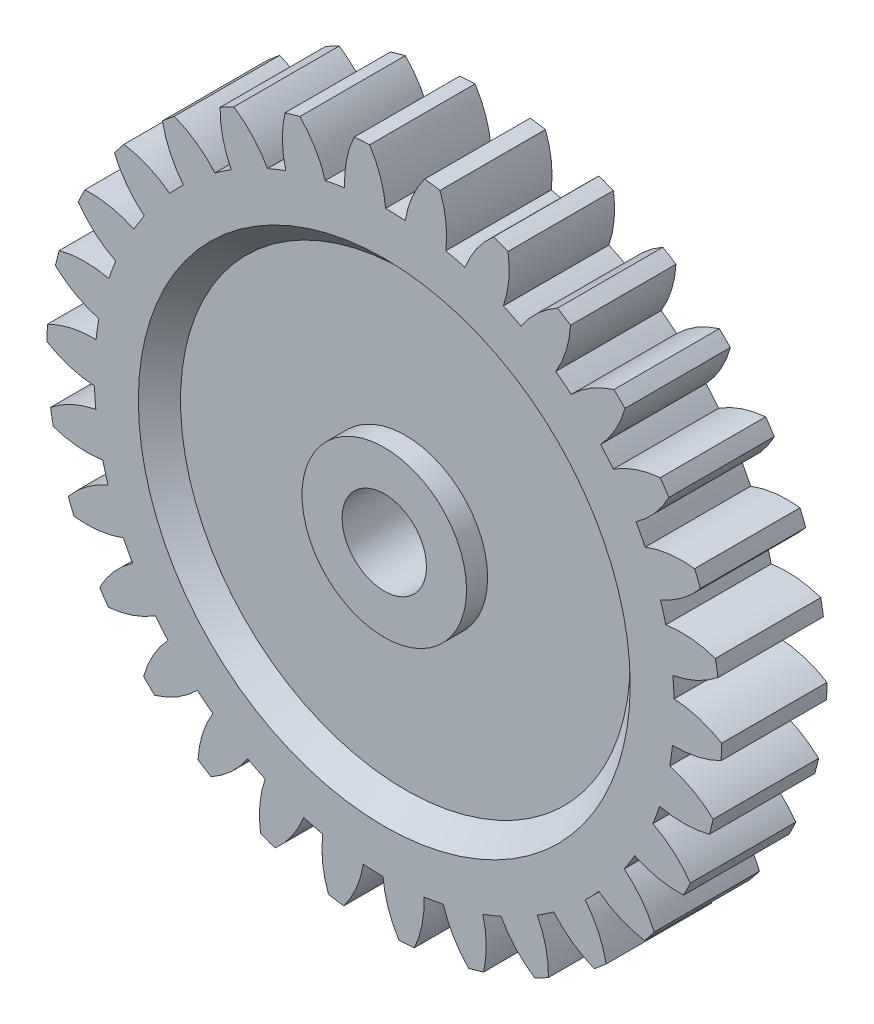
ISO-10303-21;
HEADER;
FILE_DESCRIPTION(('STEP AP214'),'2;1');
FILE_NAME('part.step','',(''),(''),'','','');
FILE_SCHEMA(('AUTOMOTIVE_DESIGN { 1 0 10303 214 1 1 1 1 }'));
ENDSEC;
DATA;
#1=APPLICATION_CONTEXT('core data for automotive mechanical design processes');
#2=APPLICATION_PROTOCOL_DEFINITION('international standard','automotive_design',2000,#1);
#3=PRODUCT_CONTEXT('',#1,'mechanical');
#4=PRODUCT('Part','Part','',(#3));
#5=PRODUCT_RELATED_PRODUCT_CATEGORY('part','',(#4));
#6=PRODUCT_DEFINITION_FORMATION('','',#4);
#7=PRODUCT_DEFINITION_CONTEXT('part definition',#1,'design');
#8=PRODUCT_DEFINITION('design','',#6,#7);
#9=PRODUCT_DEFINITION_SHAPE('','',#8);
#10=(LENGTH_UNIT() NAMED_UNIT(*) SI_UNIT(.MILLI.,.METRE.));
#11=(NAMED_UNIT(*) PLANE_ANGLE_UNIT() SI_UNIT($,.RADIAN.));
#12=(NAMED_UNIT(*) SI_UNIT($,.STERADIAN.) SOLID_ANGLE_UNIT());
#13=UNCERTAINTY_MEASURE_WITH_UNIT(LENGTH_MEASURE(1.E-05),#10,'distance_accuracy_value','');
#14=(GEOMETRIC_REPRESENTATION_CONTEXT(3) GLOBAL_UNCERTAINTY_ASSIGNED_CONTEXT((#13)) GLOBAL_UNIT_ASSIGNED_CONTEXT((#10,
#11,#12)) REPRESENTATION_CONTEXT('',''));
#15=CARTESIAN_POINT('',(0.,0.,0.));
#16=DIRECTION('',(0.,0.,1.));
#17=DIRECTION('',(1.,0.,0.));
#18=AXIS2_PLACEMENT_3D('',#15,#16,#17);
#19=CARTESIAN_POINT('',(0.,0.,0.));
#20=DIRECTION('',(0.,0.,1.));
#21=DIRECTION('',(1.,0.,0.));
#22=AXIS2_PLACEMENT_3D('',#19,#20,#21);
#23=PLANE('',#22);
#24=CARTESIAN_POINT('',(0.,0.,0.));
#25=DIRECTION('',(0.,0.,1.));
#26=DIRECTION('',(1.,0.,0.));
#27=AXIS2_PLACEMENT_3D('',#24,#25,#26);
#28=CIRCLE('',#27,11.6632728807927);
#29=CARTESIAN_POINT('',(11.6632728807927,0.,0.));
#30=VERTEX_POINT('',#29);
#31=EDGE_CURVE('E11',#30,#30,#28,.T.);
#32=ORIENTED_EDGE('',*,*,#31,.T.);
#33=EDGE_LOOP('',(#32));
#34=FACE_BOUND('',#33,.T.);
#35=CARTESIAN_POINT('',(0.,0.,0.));
#36=DIRECTION('',(0.,0.,1.));
#37=DIRECTION('',(1.,0.,0.));
#38=AXIS2_PLACEMENT_3D('',#35,#36,#37);
#39=CIRCLE('',#38,13.75);
#40=CARTESIAN_POINT('',(13.742789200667,0.445247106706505,0.));
#41=VERTEX_POINT('',#40);
#42=CARTESIAN_POINT('',(13.6808979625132,1.37678282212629,0.));
#43=VERTEX_POINT('',#42);
#44=EDGE_CURVE('E782',#41,#43,#39,.T.);
#45=ORIENTED_EDGE('',*,*,#44,.F.);
#46=CARTESIAN_POINT('',(13.4768167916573,-4.44018049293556,0.));
#47=DIRECTION('',(0.,0.,1.));
#48=DIRECTION('',(1.,0.,0.));
#49=AXIS2_PLACEMENT_3D('',#46,#47,#48);
#50=CIRCLE('',#49,4.89266227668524);
#51=CARTESIAN_POINT('',(15.9980907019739,-0.247171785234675,0.));
#52=VERTEX_POINT('',#51);
#53=EDGE_CURVE('E1571',#52,#41,#50,.T.);
#54=ORIENTED_EDGE('',*,*,#53,.F.);
#55=CARTESIAN_POINT('',(0.,0.,0.));
#56=DIRECTION('',(0.,0.,1.));
#57=DIRECTION('',(1.,0.,0.));
#58=AXIS2_PLACEMENT_3D('',#55,#56,#57);
#59=CIRCLE('',#58,16.);
#60=CARTESIAN_POINT('',(15.969942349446,-0.980276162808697,0.));
#61=VERTEX_POINT('',#60);
#62=EDGE_CURVE('E1576',#61,#52,#59,.T.);
#63=ORIENTED_EDGE('',*,*,#62,.F.);
#64=CARTESIAN_POINT('',(13.7776079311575,3.39371674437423,0.));
#65=DIRECTION('',(0.,0.,1.));
#66=DIRECTION('',(-1.,0.,0.));
#67=AXIS2_PLACEMENT_3D('',#64,#65,#66);
#68=CIRCLE('',#67,4.89266227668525);
#69=CARTESIAN_POINT('',(13.6681867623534,-1.49772181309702,0.));
#70=VERTEX_POINT('',#69);
#71=EDGE_CURVE('E777',#70,#61,#68,.T.);
#72=ORIENTED_EDGE('',*,*,#71,.F.);
#73=CARTESIAN_POINT('',(13.53504836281,-2.42176915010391,0.));
#74=VERTEX_POINT('',#73);
#75=EDGE_CURVE('E770',#74,#70,#39,.T.);
#76=ORIENTED_EDGE('',*,*,#75,.F.);
#77=CARTESIAN_POINT('',(12.2591505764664,-7.14513966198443,0.));
#78=DIRECTION('',(0.,0.,1.));
#79=DIRECTION('',(0.978147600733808,-0.207911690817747,0.));
#80=AXIS2_PLACEMENT_3D('',#77,#78,#79);
#81=CIRCLE('',#80,4.89266227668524);
#82=CARTESIAN_POINT('',(15.597104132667,-3.56796057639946,0.));
#83=VERTEX_POINT('',#82);
#84=EDGE_CURVE('E773',#83,#74,#81,.T.);
#85=ORIENTED_EDGE('',*,*,#84,.F.);
#86=CARTESIAN_POINT('',(0.,0.,0.));
#87=DIRECTION('',(0.,0.,1.));
#88=DIRECTION('',(0.978147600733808,-0.207911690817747,0.));
#89=AXIS2_PLACEMENT_3D('',#86,#87,#88);
#90=CIRCLE('',#89,16.);
#91=CARTESIAN_POINT('',(15.41714991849,-4.27919249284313,0.));
#92=VERTEX_POINT('',#91);
#93=EDGE_CURVE('E788',#92,#83,#90,.T.);
#94=ORIENTED_EDGE('',*,*,#93,.F.);
#95=CARTESIAN_POINT('',(14.1821275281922,0.455030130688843,0.));
#96=DIRECTION('',(0.,0.,1.));
#97=DIRECTION('',(-0.978147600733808,0.207911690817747,0.));
#98=AXIS2_PLACEMENT_3D('',#95,#96,#97);
#99=CIRCLE('',#98,4.89266227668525);
#100=CARTESIAN_POINT('',(13.058110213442,-4.30676881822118,0.));
#101=VERTEX_POINT('',#100);
#102=EDGE_CURVE('E792',#101,#92,#99,.T.);
#103=ORIENTED_EDGE('',*,*,#102,.F.);
#104=CARTESIAN_POINT('',(12.7357609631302,-5.18294247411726,0.));
#105=VERTEX_POINT('',#104);
#106=EDGE_CURVE('E779',#105,#101,#39,.T.);
#107=ORIENTED_EDGE('',*,*,#106,.F.);
#108=CARTESIAN_POINT('',(10.5057006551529,-9.53782194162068,0.));
#109=DIRECTION('',(0.,0.,1.));
#110=DIRECTION('',(0.913545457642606,-0.406736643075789,0.));
#111=AXIS2_PLACEMENT_3D('',#108,#109,#110);
#112=CIRCLE('',#111,4.89266227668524);
#113=CARTESIAN_POINT('',(14.5144492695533,-6.73281236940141,0.));
#114=VERTEX_POINT('',#113);
#115=EDGE_CURVE('E815',#114,#105,#112,.T.);
#116=ORIENTED_EDGE('',*,*,#115,.F.);
#117=CARTESIAN_POINT('',(0.,0.,0.));
#118=DIRECTION('',(0.,0.,1.));
#119=DIRECTION('',(0.913545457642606,-0.406736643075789,0.));
#120=AXIS2_PLACEMENT_3D('',#117,#118,#119);
#121=CIRCLE('',#120,16.);
#122=CARTESIAN_POINT('',(14.1905540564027,-7.39108757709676,0.));
#123=VERTEX_POINT('',#122);
#124=EDGE_CURVE('E822',#123,#114,#121,.T.);
#125=ORIENTED_EDGE('',*,*,#124,.F.);
#126=CARTESIAN_POINT('',(13.9668200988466,-2.50354348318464,0.));
#127=DIRECTION('',(0.,0.,1.));
#128=DIRECTION('',(-0.913545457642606,0.406736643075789,0.));
#129=AXIS2_PLACEMENT_3D('',#126,#127,#128);
#130=CIRCLE('',#129,4.89266227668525);
#131=CARTESIAN_POINT('',(11.8773315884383,-6.92758935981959,0.));
#132=VERTEX_POINT('',#131);
#133=EDGE_CURVE('E818',#132,#123,#130,.T.);
#134=ORIENTED_EDGE('',*,*,#133,.F.);
#135=CARTESIAN_POINT('',(11.3798596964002,-7.71759634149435,0.));
#136=VERTEX_POINT('',#135);
#137=EDGE_CURVE('E1697',#136,#132,#39,.T.);
#138=ORIENTED_EDGE('',*,*,#137,.F.);
#139=CARTESIAN_POINT('',(8.29310120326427,-11.5136556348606,0.));
#140=DIRECTION('',(0.,0.,1.));
#141=DIRECTION('',(0.809016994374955,-0.587785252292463,0.));
#142=AXIS2_PLACEMENT_3D('',#139,#140,#141);
#143=CIRCLE('',#142,4.89266227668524);
#144=CARTESIAN_POINT('',(12.7974433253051,-9.60340795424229,0.));
#145=VERTEX_POINT('',#144);
#146=EDGE_CURVE('E842',#145,#136,#143,.T.);
#147=ORIENTED_EDGE('',*,*,#146,.F.);
#148=CARTESIAN_POINT('',(0.,0.,0.));
#149=DIRECTION('',(0.,0.,1.));
#150=DIRECTION('',(0.809016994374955,-0.587785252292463,0.));
#151=AXIS2_PLACEMENT_3D('',#148,#149,#150);
#152=CIRCLE('',#151,16.);
#153=CARTESIAN_POINT('',(12.3437628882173,-10.1799566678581,0.));
#154=VERTEX_POINT('',#153);
#155=EDGE_CURVE('E849',#154,#145,#152,.T.);
#156=ORIENTED_EDGE('',*,*,#155,.F.);
#157=CARTESIAN_POINT('',(13.1410956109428,-5.35270023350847,0.));
#158=DIRECTION('',(0.,0.,1.));
#159=DIRECTION('',(-0.809016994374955,0.587785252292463,0.));
#160=AXIS2_PLACEMENT_3D('',#157,#158,#159);
#161=CIRCLE('',#160,4.89266227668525);
#162=CARTESIAN_POINT('',(10.1774565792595,-9.24564100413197,0.));
#163=VERTEX_POINT('',#162);
#164=EDGE_CURVE('E845',#163,#154,#161,.T.);
#165=ORIENTED_EDGE('',*,*,#164,.F.);
#166=CARTESIAN_POINT('',(9.52660395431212,-9.91495421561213,0.));
#167=VERTEX_POINT('',#166);
#168=EDGE_CURVE('E3033',#167,#163,#39,.T.);
#169=ORIENTED_EDGE('',*,*,#168,.F.);
#170=CARTESIAN_POINT('',(5.71805343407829,-12.9862873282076,0.));
#171=DIRECTION('',(0.,0.,1.));
#172=DIRECTION('',(0.669130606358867,-0.743144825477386,0.));
#173=AXIS2_PLACEMENT_3D('',#170,#171,#172);
#174=CIRCLE('',#173,4.89266227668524);
#175=CARTESIAN_POINT('',(10.5211276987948,-12.0542885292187,0.));
#176=VERTEX_POINT('',#175);
#177=EDGE_CURVE('E869',#176,#167,#174,.T.);
#178=ORIENTED_EDGE('',*,*,#177,.F.);
#179=CARTESIAN_POINT('',(0.,0.,0.));
#180=DIRECTION('',(0.,0.,1.));
#181=DIRECTION('',(0.669130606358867,-0.743144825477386,0.));
#182=AXIS2_PLACEMENT_3D('',#179,#180,#181);
#183=CIRCLE('',#182,16.);
#184=CARTESIAN_POINT('',(9.95749004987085,-12.5239128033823,0.));
#185=VERTEX_POINT('',#184);
#186=EDGE_CURVE('E876',#185,#176,#183,.T.);
#187=ORIENTED_EDGE('',*,*,#186,.F.);
#188=CARTESIAN_POINT('',(11.7410421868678,-7.96791829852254,0.));
#189=DIRECTION('',(0.,0.,1.));
#190=DIRECTION('',(-0.669130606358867,0.743144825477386,0.));
#191=AXIS2_PLACEMENT_3D('',#188,#189,#190);
#192=CIRCLE('',#191,4.89266227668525);
#193=CARTESIAN_POINT('',(8.03277788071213,-11.159613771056,0.));
#194=VERTEX_POINT('',#193);
#195=EDGE_CURVE('E872',#194,#185,#192,.T.);
#196=ORIENTED_EDGE('',*,*,#195,.F.);
#197=CARTESIAN_POINT('',(7.25698990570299,-11.6789810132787,0.));
#198=VERTEX_POINT('',#197);
#199=EDGE_CURVE('E3035',#198,#194,#39,.T.);
#200=ORIENTED_EDGE('',*,*,#199,.F.);
#201=CARTESIAN_POINT('',(2.89309929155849,-13.8913559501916,0.));
#202=DIRECTION('',(0.,0.,1.));
#203=DIRECTION('',(0.50000000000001,-0.866025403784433,0.));
#204=AXIS2_PLACEMENT_3D('',#201,#202,#203);
#205=CIRCLE('',#204,4.89266227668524);
#206=CARTESIAN_POINT('',(7.78498830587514,-13.9783388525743,0.));
#207=VERTEX_POINT('',#206);
#208=EDGE_CURVE('E896',#207,#198,#205,.T.);
#209=ORIENTED_EDGE('',*,*,#208,.F.);
#210=CARTESIAN_POINT('',(0.,0.,0.));
#211=DIRECTION('',(0.,0.,1.));
#212=DIRECTION('',(0.50000000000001,-0.866025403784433,0.));
#213=AXIS2_PLACEMENT_3D('',#210,#211,#212);
#214=CIRCLE('',#213,16.);
#215=CARTESIAN_POINT('',(7.13602711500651,-14.3205138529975,0.));
#216=VERTEX_POINT('',#215);
#217=EDGE_CURVE('E903',#216,#207,#214,.T.);
#218=ORIENTED_EDGE('',*,*,#217,.F.);
#219=CARTESIAN_POINT('',(9.82784887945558,-10.2349000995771,0.));
#220=DIRECTION('',(0.,0.,1.));
#221=DIRECTION('',(-0.50000000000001,0.866025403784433,0.));
#222=AXIS2_PLACEMENT_3D('',#219,#220,#221);
#223=CIRCLE('',#222,4.89266227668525);
#224=CARTESIAN_POINT('',(5.53702824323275,-12.5858578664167,0.));
#225=VERTEX_POINT('',#224);
#226=EDGE_CURVE('E899',#225,#216,#223,.T.);
#227=ORIENTED_EDGE('',*,*,#226,.F.);
#228=CARTESIAN_POINT('',(4.67021057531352,-12.9325802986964,0.));
#229=VERTEX_POINT('',#228);
#230=EDGE_CURVE('E3036',#229,#225,#39,.T.);
#231=ORIENTED_EDGE('',*,*,#230,.F.);
#232=CARTESIAN_POINT('',(-0.0582971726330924,-14.1893056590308,0.));
#233=DIRECTION('',(0.,0.,1.));
#234=DIRECTION('',(0.309016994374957,-0.95105651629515,0.));
#235=AXIS2_PLACEMENT_3D('',#232,#233,#234);
#236=CIRCLE('',#235,4.89266227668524);
#237=CARTESIAN_POINT('',(4.70860756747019,-15.2914686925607,0.));
#238=VERTEX_POINT('',#237);
#239=EDGE_CURVE('E923',#238,#229,#236,.T.);
#240=ORIENTED_EDGE('',*,*,#239,.F.);
#241=CARTESIAN_POINT('',(0.,0.,0.));
#242=DIRECTION('',(0.,0.,1.));
#243=DIRECTION('',(0.309016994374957,-0.95105651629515,0.));
#244=AXIS2_PLACEMENT_3D('',#241,#242,#243);
#245=CIRCLE('',#244,16.);
#246=CARTESIAN_POINT('',(4.00268555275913,-15.4912397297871,0.));
#247=VERTEX_POINT('',#246);
#248=EDGE_CURVE('E930',#247,#238,#245,.T.);
#249=ORIENTED_EDGE('',*,*,#248,.F.);
#250=CARTESIAN_POINT('',(7.48513141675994,-12.0545676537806,0.));
#251=DIRECTION('',(0.,0.,1.));
#252=DIRECTION('',(-0.309016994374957,0.95105651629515,0.));
#253=AXIS2_PLACEMENT_3D('',#250,#251,#252);
#254=CIRCLE('',#253,4.89266227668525);
#255=CARTESIAN_POINT('',(2.79928390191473,-13.4620395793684,0.));
#256=VERTEX_POINT('',#255);
#257=EDGE_CURVE('E926',#256,#247,#254,.T.);
#258=ORIENTED_EDGE('',*,*,#257,.F.);
#259=CARTESIAN_POINT('',(1.87932063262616,-13.6209637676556,0.));
#260=VERTEX_POINT('',#259);
#261=EDGE_CURVE('E3039',#260,#256,#39,.T.);
#262=ORIENTED_EDGE('',*,*,#261,.F.);
#263=CARTESIAN_POINT('',(-3.00714577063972,-13.8671146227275,0.));
#264=DIRECTION('',(0.,0.,1.));
#265=DIRECTION('',(0.104528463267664,-0.994521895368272,0.));
#266=AXIS2_PLACEMENT_3D('',#263,#264,#265);
#267=CIRCLE('',#266,4.89266227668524);
#268=CARTESIAN_POINT('',(1.42643808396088,-15.9362879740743,0.));
#269=VERTEX_POINT('',#268);
#270=EDGE_CURVE('E950',#269,#260,#267,.T.);
#271=ORIENTED_EDGE('',*,*,#270,.F.);
#272=CARTESIAN_POINT('',(0.,0.,0.));
#273=DIRECTION('',(0.,0.,1.));
#274=DIRECTION('',(0.104528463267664,-0.994521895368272,0.));
#275=AXIS2_PLACEMENT_3D('',#272,#273,#274);
#276=CIRCLE('',#275,16.);
#277=CARTESIAN_POINT('',(0.69440742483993,-15.9849240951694,0.));
#278=VERTEX_POINT('',#277);
#279=EDGE_CURVE('E957',#278,#269,#276,.T.);
#280=ORIENTED_EDGE('',*,*,#279,.F.);
#281=CARTESIAN_POINT('',(4.81527779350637,-13.3473927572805,0.));
#282=DIRECTION('',(0.,0.,1.));
#283=DIRECTION('',(-0.104528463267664,0.994521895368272,0.));
#284=AXIS2_PLACEMENT_3D('',#281,#282,#283);
#285=CIRCLE('',#284,4.89266227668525);
#286=CARTESIAN_POINT('',(-0.0608025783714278,-13.7498655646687,0.));
#287=VERTEX_POINT('',#286);
#288=EDGE_CURVE('E953',#287,#278,#285,.T.);
#289=ORIENTED_EDGE('',*,*,#288,.F.);
#290=CARTESIAN_POINT('',(-0.993704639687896,-13.7140457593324,0.));
#291=VERTEX_POINT('',#290);
#292=EDGE_CURVE('E3042',#291,#287,#39,.T.);
#293=ORIENTED_EDGE('',*,*,#292,.F.);
#294=CARTESIAN_POINT('',(-5.82456766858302,-12.9388641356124,0.));
#295=DIRECTION('',(0.,0.,1.));
#296=DIRECTION('',(-0.104528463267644,-0.994521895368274,0.));
#297=AXIS2_PLACEMENT_3D('',#294,#295,#296);
#298=CIRCLE('',#297,4.89266227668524);
#299=CARTESIAN_POINT('',(-1.91807358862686,-15.884615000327,0.));
#300=VERTEX_POINT('',#299);
#301=EDGE_CURVE('E977',#300,#291,#298,.T.);
#302=ORIENTED_EDGE('',*,*,#301,.F.);
#303=CARTESIAN_POINT('',(0.,0.,0.));
#304=DIRECTION('',(0.,0.,1.));
#305=DIRECTION('',(-0.104528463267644,-0.994521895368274,0.));
#306=AXIS2_PLACEMENT_3D('',#303,#304,#305);
#307=CIRCLE('',#306,16.);
#308=CARTESIAN_POINT('',(-2.6442196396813,-15.7799905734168,0.));
#309=VERTEX_POINT('',#308);
#310=EDGE_CURVE('E984',#309,#300,#307,.T.);
#311=ORIENTED_EDGE('',*,*,#310,.F.);
#312=CARTESIAN_POINT('',(1.93497342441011,-14.0568727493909,0.));
#313=DIRECTION('',(0.,0.,1.));
#314=DIRECTION('',(0.104528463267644,0.994521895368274,0.));
#315=AXIS2_PLACEMENT_3D('',#312,#313,#314);
#316=CIRCLE('',#315,4.89266227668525);
#317=CARTESIAN_POINT('',(-2.91823169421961,-13.4367564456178,0.));
#318=VERTEX_POINT('',#317);
#319=EDGE_CURVE('E980',#318,#309,#316,.T.);
#320=ORIENTED_EDGE('',*,*,#319,.F.);
#321=CARTESIAN_POINT('',(-3.82330025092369,-13.2077581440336,0.));
#322=VERTEX_POINT('',#321);
#323=EDGE_CURVE('E3045',#322,#318,#39,.T.);
#324=ORIENTED_EDGE('',*,*,#323,.F.);
#325=CARTESIAN_POINT('',(-8.38742801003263,-11.4451231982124,0.));
#326=DIRECTION('',(0.,0.,1.));
#327=DIRECTION('',(-0.309016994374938,-0.951056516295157,0.));
#328=AXIS2_PLACEMENT_3D('',#325,#326,#327);
#329=CIRCLE('',#328,4.89266227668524);
#330=CARTESIAN_POINT('',(-5.17875624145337,-15.1387081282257,0.));
#331=VERTEX_POINT('',#330);
#332=EDGE_CURVE('E1004',#331,#322,#329,.T.);
#333=ORIENTED_EDGE('',*,*,#332,.F.);
#334=CARTESIAN_POINT('',(0.,0.,0.));
#335=DIRECTION('',(0.,0.,1.));
#336=DIRECTION('',(-0.309016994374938,-0.951056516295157,0.));
#337=AXIS2_PLACEMENT_3D('',#334,#335,#336);
#338=CIRCLE('',#337,16.);
#339=CARTESIAN_POINT('',(-5.86728161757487,-14.8853957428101,0.));
#340=VERTEX_POINT('',#339);
#341=EDGE_CURVE('E1011',#340,#331,#338,.T.);
#342=ORIENTED_EDGE('',*,*,#341,.F.);
#343=CARTESIAN_POINT('',(-1.02989856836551,-14.1519999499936,0.));
#344=DIRECTION('',(0.,0.,1.));
#345=DIRECTION('',(0.309016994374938,0.951056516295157,0.));
#346=AXIS2_PLACEMENT_3D('',#343,#344,#345);
#347=CIRCLE('',#346,4.89266227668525);
#348=CARTESIAN_POINT('',(-5.64812008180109,-12.5363965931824,0.));
#349=VERTEX_POINT('',#348);
#350=EDGE_CURVE('E1007',#349,#340,#347,.T.);
#351=ORIENTED_EDGE('',*,*,#350,.F.);
#352=CARTESIAN_POINT('',(-6.48579929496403,-12.1242281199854,0.));
#353=VERTEX_POINT('',#352);
#354=EDGE_CURVE('E3048',#353,#349,#39,.T.);
#355=ORIENTED_EDGE('',*,*,#354,.F.);
#356=CARTESIAN_POINT('',(-10.5837175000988,-9.4511754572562,0.));
#357=DIRECTION('',(0.,0.,1.));
#358=DIRECTION('',(-0.499999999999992,-0.866025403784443,0.));
#359=AXIS2_PLACEMENT_3D('',#356,#357,#358);
#360=CIRCLE('',#359,4.89266227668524);
#361=CARTESIAN_POINT('',(-8.2131023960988,-13.7311670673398,0.));
#362=VERTEX_POINT('',#361);
#363=EDGE_CURVE('E1031',#362,#353,#360,.T.);
#364=ORIENTED_EDGE('',*,*,#363,.F.);
#365=CARTESIAN_POINT('',(0.,0.,0.));
#366=DIRECTION('',(0.,0.,1.));
#367=DIRECTION('',(-0.499999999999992,-0.866025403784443,0.));
#368=AXIS2_PLACEMENT_3D('',#365,#366,#367);
#369=CIRCLE('',#368,16.);
#370=CARTESIAN_POINT('',(-8.83391523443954,-13.3402376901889,0.));
#371=VERTEX_POINT('',#370);
#372=EDGE_CURVE('E1038',#371,#362,#369,.T.);
#373=ORIENTED_EDGE('',*,*,#372,.F.);
#374=CARTESIAN_POINT('',(-3.94975905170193,-13.6286168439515,0.));
#375=DIRECTION('',(0.,0.,1.));
#376=DIRECTION('',(0.499999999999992,0.866025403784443,0.));
#377=AXIS2_PLACEMENT_3D('',#374,#375,#376);
#378=CIRCLE('',#377,4.89266227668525);
#379=CARTESIAN_POINT('',(-8.13115851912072,-11.0881360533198,0.));
#380=VERTEX_POINT('',#379);
#381=EDGE_CURVE('E1034',#380,#371,#378,.T.);
#382=ORIENTED_EDGE('',*,*,#381,.F.);
#383=CARTESIAN_POINT('',(-8.86483778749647,-10.5108111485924,0.));
#384=VERTEX_POINT('',#383);
#385=EDGE_CURVE('E3051',#384,#380,#39,.T.);
#386=ORIENTED_EDGE('',*,*,#385,.F.);
#387=CARTESIAN_POINT('',(-12.3174477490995,-7.04416599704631,0.));
#388=DIRECTION('',(0.,0.,1.));
#389=DIRECTION('',(-0.669130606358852,-0.7431448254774,0.));
#390=AXIS2_PLACEMENT_3D('',#387,#388,#389);
#391=CIRCLE('',#390,4.89266227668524);
#392=CARTESIAN_POINT('',(-10.8884965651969,-11.7235081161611,0.));
#393=VERTEX_POINT('',#392);
#394=EDGE_CURVE('E1058',#393,#384,#391,.T.);
#395=ORIENTED_EDGE('',*,*,#394,.F.);
#396=CARTESIAN_POINT('',(0.,0.,0.));
#397=DIRECTION('',(0.,0.,1.));
#398=DIRECTION('',(-0.669130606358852,-0.7431448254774,0.));
#399=AXIS2_PLACEMENT_3D('',#396,#397,#398);
#400=CIRCLE('',#399,16.);
#401=CARTESIAN_POINT('',(-11.4144643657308,-11.2120472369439,0.));
#402=VERTEX_POINT('',#401);
#403=EDGE_CURVE('E1065',#402,#393,#400,.T.);
#404=ORIENTED_EDGE('',*,*,#403,.F.);
#405=CARTESIAN_POINT('',(-6.69699611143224,-12.5095977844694,0.));
#406=DIRECTION('',(0.,0.,1.));
#407=DIRECTION('',(0.669130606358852,0.7431448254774,0.));
#408=AXIS2_PLACEMENT_3D('',#405,#406,#407);
#409=CIRCLE('',#408,4.89266227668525);
#410=CARTESIAN_POINT('',(-10.2588263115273,-9.15527076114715,0.));
#411=VERTEX_POINT('',#410);
#412=EDGE_CURVE('E1061',#411,#402,#409,.T.);
#413=ORIENTED_EDGE('',*,*,#412,.F.);
#414=CARTESIAN_POINT('',(-10.8564403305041,-8.43802129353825,0.));
#415=VERTEX_POINT('',#414);
#416=EDGE_CURVE('E3054',#415,#411,#39,.T.);
#417=ORIENTED_EDGE('',*,*,#416,.F.);
#418=CARTESIAN_POINT('',(-13.5128464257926,-4.32929268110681,0.));
#419=DIRECTION('',(0.,0.,1.));
#420=DIRECTION('',(-0.809016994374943,-0.58778525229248,0.));
#421=AXIS2_PLACEMENT_3D('',#418,#419,#420);
#422=CIRCLE('',#421,4.89266227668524);
#423=CARTESIAN_POINT('',(-13.0880111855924,-9.20347560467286,0.));
#424=VERTEX_POINT('',#423);
#425=EDGE_CURVE('E1085',#424,#415,#422,.T.);
#426=ORIENTED_EDGE('',*,*,#425,.F.);
#427=CARTESIAN_POINT('',(0.,0.,0.));
#428=DIRECTION('',(0.,0.,1.));
#429=DIRECTION('',(-0.809016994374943,-0.58778525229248,0.));
#430=AXIS2_PLACEMENT_3D('',#427,#428,#429);
#431=CIRCLE('',#430,16.);
#432=CARTESIAN_POINT('',(-13.4961466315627,-8.59383651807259,0.));
#433=VERTEX_POINT('',#432);
#434=EDGE_CURVE('E1092',#433,#424,#431,.T.);
#435=ORIENTED_EDGE('',*,*,#434,.F.);
#436=CARTESIAN_POINT('',(-9.15154230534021,-10.8438492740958,0.));
#437=DIRECTION('',(0.,0.,1.));
#438=DIRECTION('',(0.809016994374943,0.58778525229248,0.));
#439=AXIS2_PLACEMENT_3D('',#436,#437,#438);
#440=CIRCLE('',#439,4.89266227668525);
#441=CARTESIAN_POINT('',(-11.9381341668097,-6.8222762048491,0.));
#442=VERTEX_POINT('',#441);
#443=EDGE_CURVE('E1088',#442,#433,#440,.T.);
#444=ORIENTED_EDGE('',*,*,#443,.F.);
#445=CARTESIAN_POINT('',(-12.3735643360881,-5.99644941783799,0.));
#446=VERTEX_POINT('',#445);
#447=EDGE_CURVE('E3057',#446,#442,#39,.T.);
#448=ORIENTED_EDGE('',*,*,#447,.F.);
#449=CARTESIAN_POINT('',(-14.1176688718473,-1.42520850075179,0.));
#450=DIRECTION('',(0.,0.,1.));
#451=DIRECTION('',(-0.913545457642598,-0.406736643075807,0.));
#452=AXIS2_PLACEMENT_3D('',#449,#450,#451);
#453=CIRCLE('',#452,4.89266227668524);
#454=CARTESIAN_POINT('',(-14.7155169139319,-6.2812070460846,0.));
#455=VERTEX_POINT('',#454);
#456=EDGE_CURVE('E1112',#455,#446,#453,.T.);
#457=ORIENTED_EDGE('',*,*,#456,.F.);
#458=CARTESIAN_POINT('',(0.,0.,0.));
#459=DIRECTION('',(0.,0.,1.));
#460=DIRECTION('',(-0.913545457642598,-0.406736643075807,0.));
#461=AXIS2_PLACEMENT_3D('',#458,#459,#460);
#462=CIRCLE('',#461,16.);
#463=CARTESIAN_POINT('',(-14.9879825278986,-5.60003390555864,0.));
#464=VERTEX_POINT('',#463);
#465=EDGE_CURVE('E1119',#464,#455,#462,.T.);
#466=ORIENTED_EDGE('',*,*,#465,.F.);
#467=CARTESIAN_POINT('',(-11.2061221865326,-8.70417251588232,0.));
#468=DIRECTION('',(0.,0.,1.));
#469=DIRECTION('',(0.913545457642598,0.406736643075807,0.));
#470=AXIS2_PLACEMENT_3D('',#467,#468,#469);
#471=CIRCLE('',#470,4.89266227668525);
#472=CARTESIAN_POINT('',(-13.0956882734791,-4.1911154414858,0.));
#473=VERTEX_POINT('',#472);
#474=EDGE_CURVE('E1115',#473,#464,#471,.T.);
#475=ORIENTED_EDGE('',*,*,#474,.F.);
#476=CARTESIAN_POINT('',(-13.3499042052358,-3.29280392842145,0.));
#477=VERTEX_POINT('',#476);
#478=EDGE_CURVE('E3060',#477,#473,#39,.T.);
#479=ORIENTED_EDGE('',*,*,#478,.F.);
#480=CARTESIAN_POINT('',(-14.1054814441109,1.54116412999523,0.));
#481=DIRECTION('',(0.,0.,1.));
#482=DIRECTION('',(-0.978147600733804,-0.207911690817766,0.));
#483=AXIS2_PLACEMENT_3D('',#480,#481,#482);
#484=CIRCLE('',#483,4.89266227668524);
#485=CARTESIAN_POINT('',(-15.6998839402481,-3.08441959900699,0.));
#486=VERTEX_POINT('',#485);
#487=EDGE_CURVE('E1139',#486,#477,#484,.T.);
#488=ORIENTED_EDGE('',*,*,#487,.F.);
#489=CARTESIAN_POINT('',(0.,0.,0.));
#490=DIRECTION('',(0.,0.,1.));
#491=DIRECTION('',(-0.978147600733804,-0.207911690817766,0.));
#492=AXIS2_PLACEMENT_3D('',#489,#490,#491);
#493=CIRCLE('',#492,16.);
#494=CARTESIAN_POINT('',(-15.8247716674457,-2.36148293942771,0.));
#495=VERTEX_POINT('',#494);
#496=EDGE_CURVE('E1146',#495,#486,#493,.T.);
#497=ORIENTED_EDGE('',*,*,#496,.F.);
#498=CARTESIAN_POINT('',(-12.7709407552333,-6.18408165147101,0.));
#499=DIRECTION('',(0.,0.,1.));
#500=DIRECTION('',(0.978147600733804,0.207911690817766,0.));
#501=AXIS2_PLACEMENT_3D('',#498,#499,#500);
#502=CIRCLE('',#501,4.89266227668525);
#503=CARTESIAN_POINT('',(-13.6808979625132,-1.37678282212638,0.));
#504=VERTEX_POINT('',#503);
#505=EDGE_CURVE('E1142',#504,#495,#502,.T.);
#506=ORIENTED_EDGE('',*,*,#505,.F.);
#507=CARTESIAN_POINT('',(-13.742789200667,-0.445247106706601,0.));
#508=VERTEX_POINT('',#507);
#509=EDGE_CURVE('E3063',#508,#504,#39,.T.);
#510=ORIENTED_EDGE('',*,*,#509,.F.);
#511=CARTESIAN_POINT('',(-13.4768167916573,4.44018049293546,0.));
#512=DIRECTION('',(0.,0.,1.));
#513=DIRECTION('',(-1.,0.,0.));
#514=AXIS2_PLACEMENT_3D('',#511,#512,#513);
#515=CIRCLE('',#514,4.89266227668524);
#516=CARTESIAN_POINT('',(-15.9980907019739,0.247171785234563,0.));
#517=VERTEX_POINT('',#516);
#518=EDGE_CURVE('E1166',#517,#508,#515,.T.);
#519=ORIENTED_EDGE('',*,*,#518,.F.);
#520=CARTESIAN_POINT('',(0.,0.,0.));
#521=DIRECTION('',(0.,0.,1.));
#522=DIRECTION('',(-1.,0.,0.));
#523=AXIS2_PLACEMENT_3D('',#520,#521,#522);
#524=CIRCLE('',#523,16.);
#525=CARTESIAN_POINT('',(-15.969942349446,0.980276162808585,0.));
#526=VERTEX_POINT('',#525);
#527=EDGE_CURVE('E1173',#526,#517,#524,.T.);
#528=ORIENTED_EDGE('',*,*,#527,.F.);
#529=CARTESIAN_POINT('',(-13.7776079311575,-3.39371674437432,0.));
#530=DIRECTION('',(0.,0.,1.));
#531=DIRECTION('',(1.,0.,0.));
#532=AXIS2_PLACEMENT_3D('',#529,#530,#531);
#533=CIRCLE('',#532,4.89266227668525);
#534=CARTESIAN_POINT('',(-13.6681867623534,1.49772181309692,0.));
#535=VERTEX_POINT('',#534);
#536=EDGE_CURVE('E1169',#535,#526,#533,.T.);
#537=ORIENTED_EDGE('',*,*,#536,.F.);
#538=CARTESIAN_POINT('',(-13.53504836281,2.421769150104,0.));
#539=VERTEX_POINT('',#538);
#540=EDGE_CURVE('E3066',#539,#535,#39,.T.);
#541=ORIENTED_EDGE('',*,*,#540,.F.);
#542=CARTESIAN_POINT('',(-12.2591505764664,7.14513966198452,0.));
#543=DIRECTION('',(0.,0.,1.));
#544=DIRECTION('',(-0.978147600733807,0.207911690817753,0.));
#545=AXIS2_PLACEMENT_3D('',#542,#543,#544);
#546=CIRCLE('',#545,4.89266227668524);
#547=CARTESIAN_POINT('',(-15.597104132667,3.56796057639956,0.));
#548=VERTEX_POINT('',#547);
#549=EDGE_CURVE('E1193',#548,#539,#546,.T.);
#550=ORIENTED_EDGE('',*,*,#549,.F.);
#551=CARTESIAN_POINT('',(0.,0.,0.));
#552=DIRECTION('',(0.,0.,1.));
#553=DIRECTION('',(-0.978147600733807,0.207911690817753,0.));
#554=AXIS2_PLACEMENT_3D('',#551,#552,#553);
#555=CIRCLE('',#554,16.);
#556=CARTESIAN_POINT('',(-15.4171499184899,4.27919249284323,0.));
#557=VERTEX_POINT('',#556);
#558=EDGE_CURVE('E1200',#557,#548,#555,.T.);
#559=ORIENTED_EDGE('',*,*,#558,.F.);
#560=CARTESIAN_POINT('',(-14.1821275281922,-0.455030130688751,0.));
#561=DIRECTION('',(0.,0.,1.));
#562=DIRECTION('',(0.978147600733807,-0.207911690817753,0.));
#563=AXIS2_PLACEMENT_3D('',#560,#561,#562);
#564=CIRCLE('',#563,4.89266227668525);
#565=CARTESIAN_POINT('',(-13.0581102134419,4.30676881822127,0.));
#566=VERTEX_POINT('',#565);
#567=EDGE_CURVE('E1196',#566,#557,#564,.T.);
#568=ORIENTED_EDGE('',*,*,#567,.F.);
#569=CARTESIAN_POINT('',(-12.7357609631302,5.18294247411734,0.));
#570=VERTEX_POINT('',#569);
#571=EDGE_CURVE('E3069',#570,#566,#39,.T.);
#572=ORIENTED_EDGE('',*,*,#571,.F.);
#573=CARTESIAN_POINT('',(-10.5057006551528,9.53782194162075,0.));
#574=DIRECTION('',(0.,0.,1.));
#575=DIRECTION('',(-0.913545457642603,0.406736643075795,0.));
#576=AXIS2_PLACEMENT_3D('',#573,#574,#575);
#577=CIRCLE('',#576,4.89266227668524);
#578=CARTESIAN_POINT('',(-14.5144492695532,6.7328123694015,0.));
#579=VERTEX_POINT('',#578);
#580=EDGE_CURVE('E1220',#579,#570,#577,.T.);
#581=ORIENTED_EDGE('',*,*,#580,.F.);
#582=CARTESIAN_POINT('',(0.,0.,0.));
#583=DIRECTION('',(0.,0.,1.));
#584=DIRECTION('',(-0.913545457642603,0.406736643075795,0.));
#585=AXIS2_PLACEMENT_3D('',#582,#583,#584);
#586=CIRCLE('',#585,16.);
#587=CARTESIAN_POINT('',(-14.1905540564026,7.39108757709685,0.));
#588=VERTEX_POINT('',#587);
#589=EDGE_CURVE('E1227',#588,#579,#586,.T.);
#590=ORIENTED_EDGE('',*,*,#589,.F.);
#591=CARTESIAN_POINT('',(-13.9668200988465,2.50354348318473,0.));
#592=DIRECTION('',(0.,0.,1.));
#593=DIRECTION('',(0.913545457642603,-0.406736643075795,0.));
#594=AXIS2_PLACEMENT_3D('',#591,#592,#593);
#595=CIRCLE('',#594,4.89266227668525);
#596=CARTESIAN_POINT('',(-11.8773315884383,6.92758935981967,0.));
#597=VERTEX_POINT('',#596);
#598=EDGE_CURVE('E1223',#597,#588,#595,.T.);
#599=ORIENTED_EDGE('',*,*,#598,.F.);
#600=CARTESIAN_POINT('',(-11.3798596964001,7.71759634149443,0.));
#601=VERTEX_POINT('',#600);
#602=EDGE_CURVE('E3072',#601,#597,#39,.T.);
#603=ORIENTED_EDGE('',*,*,#602,.F.);
#604=CARTESIAN_POINT('',(-8.29310120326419,11.5136556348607,0.));
#605=DIRECTION('',(0.,0.,1.));
#606=DIRECTION('',(-0.80901699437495,0.587785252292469,0.));
#607=AXIS2_PLACEMENT_3D('',#604,#605,#606);
#608=CIRCLE('',#607,4.89266227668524);
#609=CARTESIAN_POINT('',(-12.797443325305,9.60340795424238,0.));
#610=VERTEX_POINT('',#609);
#611=EDGE_CURVE('E1247',#610,#601,#608,.T.);
#612=ORIENTED_EDGE('',*,*,#611,.F.);
#613=CARTESIAN_POINT('',(0.,0.,0.));
#614=DIRECTION('',(0.,0.,1.));
#615=DIRECTION('',(-0.80901699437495,0.587785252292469,0.));
#616=AXIS2_PLACEMENT_3D('',#613,#614,#615);
#617=CIRCLE('',#616,16.);
#618=CARTESIAN_POINT('',(-12.3437628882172,10.1799566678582,0.));
#619=VERTEX_POINT('',#618);
#620=EDGE_CURVE('E1254',#619,#610,#617,.T.);
#621=ORIENTED_EDGE('',*,*,#620,.F.);
#622=CARTESIAN_POINT('',(-13.1410956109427,5.35270023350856,0.));
#623=DIRECTION('',(0.,0.,1.));
#624=DIRECTION('',(0.80901699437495,-0.587785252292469,0.));
#625=AXIS2_PLACEMENT_3D('',#622,#623,#624);
#626=CIRCLE('',#625,4.89266227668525);
#627=CARTESIAN_POINT('',(-10.1774565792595,9.24564100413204,0.));
#628=VERTEX_POINT('',#627);
#629=EDGE_CURVE('E1250',#628,#619,#626,.T.);
#630=ORIENTED_EDGE('',*,*,#629,.F.);
#631=CARTESIAN_POINT('',(-9.52660395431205,9.9149542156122,0.));
#632=VERTEX_POINT('',#631);
#633=EDGE_CURVE('E3075',#632,#628,#39,.T.);
#634=ORIENTED_EDGE('',*,*,#633,.F.);
#635=CARTESIAN_POINT('',(-5.7180534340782,12.9862873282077,0.));
#636=DIRECTION('',(0.,0.,1.));
#637=DIRECTION('',(-0.669130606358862,0.743144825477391,0.));
#638=AXIS2_PLACEMENT_3D('',#635,#636,#637);
#639=CIRCLE('',#638,4.89266227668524);
#640=CARTESIAN_POINT('',(-10.5211276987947,12.0542885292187,0.));
#641=VERTEX_POINT('',#640);
#642=EDGE_CURVE('E1274',#641,#632,#639,.T.);
#643=ORIENTED_EDGE('',*,*,#642,.F.);
#644=CARTESIAN_POINT('',(0.,0.,0.));
#645=DIRECTION('',(0.,0.,1.));
#646=DIRECTION('',(-0.669130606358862,0.743144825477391,0.));
#647=AXIS2_PLACEMENT_3D('',#644,#645,#646);
#648=CIRCLE('',#647,16.);
#649=CARTESIAN_POINT('',(-9.95749004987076,12.5239128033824,0.));
#650=VERTEX_POINT('',#649);
#651=EDGE_CURVE('E1281',#650,#641,#648,.T.);
#652=ORIENTED_EDGE('',*,*,#651,.F.);
#653=CARTESIAN_POINT('',(-11.7410421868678,7.96791829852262,0.));
#654=DIRECTION('',(0.,0.,1.));
#655=DIRECTION('',(0.669130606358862,-0.743144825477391,0.));
#656=AXIS2_PLACEMENT_3D('',#653,#654,#655);
#657=CIRCLE('',#656,4.89266227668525);
#658=CARTESIAN_POINT('',(-8.03277788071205,11.159613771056,0.));
#659=VERTEX_POINT('',#658);
#660=EDGE_CURVE('E1277',#659,#650,#657,.T.);
#661=ORIENTED_EDGE('',*,*,#660,.F.);
#662=CARTESIAN_POINT('',(-7.25698990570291,11.6789810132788,0.));
#663=VERTEX_POINT('',#662);
#664=EDGE_CURVE('E3078',#663,#659,#39,.T.);
#665=ORIENTED_EDGE('',*,*,#664,.F.);
#666=CARTESIAN_POINT('',(-2.89309929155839,13.8913559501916,0.));
#667=DIRECTION('',(0.,0.,1.));
#668=DIRECTION('',(-0.500000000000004,0.866025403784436,0.));
#669=AXIS2_PLACEMENT_3D('',#666,#667,#668);
#670=CIRCLE('',#669,4.89266227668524);
#671=CARTESIAN_POINT('',(-7.78498830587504,13.9783388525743,0.));
#672=VERTEX_POINT('',#671);
#673=EDGE_CURVE('E1301',#672,#663,#670,.T.);
#674=ORIENTED_EDGE('',*,*,#673,.F.);
#675=CARTESIAN_POINT('',(0.,0.,0.));
#676=DIRECTION('',(0.,0.,1.));
#677=DIRECTION('',(-0.500000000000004,0.866025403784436,0.));
#678=AXIS2_PLACEMENT_3D('',#675,#676,#677);
#679=CIRCLE('',#678,16.);
#680=CARTESIAN_POINT('',(-7.13602711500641,14.3205138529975,0.));
#681=VERTEX_POINT('',#680);
#682=EDGE_CURVE('E1308',#681,#672,#679,.T.);
#683=ORIENTED_EDGE('',*,*,#682,.F.);
#684=CARTESIAN_POINT('',(-9.82784887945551,10.2349000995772,0.));
#685=DIRECTION('',(0.,0.,1.));
#686=DIRECTION('',(0.500000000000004,-0.866025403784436,0.));
#687=AXIS2_PLACEMENT_3D('',#684,#685,#686);
#688=CIRCLE('',#687,4.89266227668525);
#689=CARTESIAN_POINT('',(-5.53702824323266,12.5858578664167,0.));
#690=VERTEX_POINT('',#689);
#691=EDGE_CURVE('E1304',#690,#681,#688,.T.);
#692=ORIENTED_EDGE('',*,*,#691,.F.);
#693=CARTESIAN_POINT('',(-4.67021057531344,12.9325802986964,0.));
#694=VERTEX_POINT('',#693);
#695=EDGE_CURVE('E3081',#694,#690,#39,.T.);
#696=ORIENTED_EDGE('',*,*,#695,.F.);
#697=CARTESIAN_POINT('',(0.0582971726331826,14.1893056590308,0.));
#698=DIRECTION('',(0.,0.,1.));
#699=DIRECTION('',(-0.309016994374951,0.951056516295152,0.));
#700=AXIS2_PLACEMENT_3D('',#697,#698,#699);
#701=CIRCLE('',#700,4.89266227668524);
#702=CARTESIAN_POINT('',(-4.70860756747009,15.2914686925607,0.));
#703=VERTEX_POINT('',#702);
#704=EDGE_CURVE('E1328',#703,#694,#701,.T.);
#705=ORIENTED_EDGE('',*,*,#704,.F.);
#706=CARTESIAN_POINT('',(0.,0.,0.));
#707=DIRECTION('',(0.,0.,1.));
#708=DIRECTION('',(-0.309016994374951,0.951056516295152,0.));
#709=AXIS2_PLACEMENT_3D('',#706,#707,#708);
#710=CIRCLE('',#709,16.);
#711=CARTESIAN_POINT('',(-4.00268555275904,15.4912397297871,0.));
#712=VERTEX_POINT('',#711);
#713=EDGE_CURVE('E1335',#712,#703,#710,.T.);
#714=ORIENTED_EDGE('',*,*,#713,.F.);
#715=CARTESIAN_POINT('',(-7.48513141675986,12.0545676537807,0.));
#716=DIRECTION('',(0.,0.,1.));
#717=DIRECTION('',(0.309016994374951,-0.951056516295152,0.));
#718=AXIS2_PLACEMENT_3D('',#715,#716,#717);
#719=CIRCLE('',#718,4.89266227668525);
#720=CARTESIAN_POINT('',(-2.79928390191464,13.4620395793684,0.));
#721=VERTEX_POINT('',#720);
#722=EDGE_CURVE('E1331',#721,#712,#719,.T.);
#723=ORIENTED_EDGE('',*,*,#722,.F.);
#724=CARTESIAN_POINT('',(-1.87932063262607,13.6209637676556,0.));
#725=VERTEX_POINT('',#724);
#726=EDGE_CURVE('E3084',#725,#721,#39,.T.);
#727=ORIENTED_EDGE('',*,*,#726,.F.);
#728=CARTESIAN_POINT('',(3.00714577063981,13.8671146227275,0.));
#729=DIRECTION('',(0.,0.,1.));
#730=DIRECTION('',(-0.104528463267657,0.994521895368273,0.));
#731=AXIS2_PLACEMENT_3D('',#728,#729,#730);
#732=CIRCLE('',#731,4.89266227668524);
#733=CARTESIAN_POINT('',(-1.42643808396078,15.9362879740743,0.));
#734=VERTEX_POINT('',#733);
#735=EDGE_CURVE('E1355',#734,#725,#732,.T.);
#736=ORIENTED_EDGE('',*,*,#735,.F.);
#737=CARTESIAN_POINT('',(0.,0.,0.));
#738=DIRECTION('',(0.,0.,1.));
#739=DIRECTION('',(-0.104528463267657,0.994521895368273,0.));
#740=AXIS2_PLACEMENT_3D('',#737,#738,#739);
#741=CIRCLE('',#740,16.);
#742=CARTESIAN_POINT('',(-0.694407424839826,15.9849240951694,0.));
#743=VERTEX_POINT('',#742);
#744=EDGE_CURVE('E1362',#743,#734,#741,.T.);
#745=ORIENTED_EDGE('',*,*,#744,.F.);
#746=CARTESIAN_POINT('',(-4.81527779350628,13.3473927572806,0.));
#747=DIRECTION('',(0.,0.,1.));
#748=DIRECTION('',(0.104528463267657,-0.994521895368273,0.));
#749=AXIS2_PLACEMENT_3D('',#746,#747,#748);
#750=CIRCLE('',#749,4.89266227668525);
#751=CARTESIAN_POINT('',(0.0608025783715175,13.7498655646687,0.));
#752=VERTEX_POINT('',#751);
#753=EDGE_CURVE('E1358',#752,#743,#750,.T.);
#754=ORIENTED_EDGE('',*,*,#753,.F.);
#755=CARTESIAN_POINT('',(0.993704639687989,13.7140457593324,0.));
#756=VERTEX_POINT('',#755);
#757=EDGE_CURVE('E3087',#756,#752,#39,.T.);
#758=ORIENTED_EDGE('',*,*,#757,.F.);
#759=CARTESIAN_POINT('',(5.82456766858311,12.9388641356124,0.));
#760=DIRECTION('',(0.,0.,1.));
#761=DIRECTION('',(0.10452846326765,0.994521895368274,0.));
#762=AXIS2_PLACEMENT_3D('',#759,#760,#761);
#763=CIRCLE('',#762,4.89266227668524);
#764=CARTESIAN_POINT('',(1.91807358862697,15.8846150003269,0.));
#765=VERTEX_POINT('',#764);
#766=EDGE_CURVE('E1382',#765,#756,#763,.T.);
#767=ORIENTED_EDGE('',*,*,#766,.F.);
#768=CARTESIAN_POINT('',(0.,0.,0.));
#769=DIRECTION('',(0.,0.,1.));
#770=DIRECTION('',(0.10452846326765,0.994521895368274,0.));
#771=AXIS2_PLACEMENT_3D('',#768,#769,#770);
#772=CIRCLE('',#771,16.);
#773=CARTESIAN_POINT('',(2.64421963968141,15.7799905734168,0.));
#774=VERTEX_POINT('',#773);
#775=EDGE_CURVE('E1389',#774,#765,#772,.T.);
#776=ORIENTED_EDGE('',*,*,#775,.F.);
#777=CARTESIAN_POINT('',(-1.93497342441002,14.0568727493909,0.));
#778=DIRECTION('',(0.,0.,1.));
#779=DIRECTION('',(-0.10452846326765,-0.994521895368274,0.));
#780=AXIS2_PLACEMENT_3D('',#777,#778,#779);
#781=CIRCLE('',#780,4.89266227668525);
#782=CARTESIAN_POINT('',(2.9182316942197,13.4367564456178,0.));
#783=VERTEX_POINT('',#782);
#784=EDGE_CURVE('E1385',#783,#774,#781,.T.);
#785=ORIENTED_EDGE('',*,*,#784,.F.);
#786=CARTESIAN_POINT('',(3.82330025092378,13.2077581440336,0.));
#787=VERTEX_POINT('',#786);
#788=EDGE_CURVE('E3090',#787,#783,#39,.T.);
#789=ORIENTED_EDGE('',*,*,#788,.F.);
#790=CARTESIAN_POINT('',(8.38742801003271,11.4451231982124,0.));
#791=DIRECTION('',(0.,0.,1.));
#792=DIRECTION('',(0.309016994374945,0.951056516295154,0.));
#793=AXIS2_PLACEMENT_3D('',#790,#791,#792);
#794=CIRCLE('',#793,4.89266227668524);
#795=CARTESIAN_POINT('',(5.17875624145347,15.1387081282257,0.));
#796=VERTEX_POINT('',#795);
#797=EDGE_CURVE('E1409',#796,#787,#794,.T.);
#798=ORIENTED_EDGE('',*,*,#797,.F.);
#799=CARTESIAN_POINT('',(0.,0.,0.));
#800=DIRECTION('',(0.,0.,1.));
#801=DIRECTION('',(0.309016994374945,0.951056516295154,0.));
#802=AXIS2_PLACEMENT_3D('',#799,#800,#801);
#803=CIRCLE('',#802,16.);
#804=CARTESIAN_POINT('',(5.86728161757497,14.88539574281,0.));
#805=VERTEX_POINT('',#804);
#806=EDGE_CURVE('E1416',#805,#796,#803,.T.);
#807=ORIENTED_EDGE('',*,*,#806,.F.);
#808=CARTESIAN_POINT('',(1.02989856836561,14.1519999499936,0.));
#809=DIRECTION('',(0.,0.,1.));
#810=DIRECTION('',(-0.309016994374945,-0.951056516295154,0.));
#811=AXIS2_PLACEMENT_3D('',#808,#809,#810);
#812=CIRCLE('',#811,4.89266227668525);
#813=CARTESIAN_POINT('',(5.64812008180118,12.5363965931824,0.));
#814=VERTEX_POINT('',#813);
#815=EDGE_CURVE('E1412',#814,#805,#812,.T.);
#816=ORIENTED_EDGE('',*,*,#815,.F.);
#817=CARTESIAN_POINT('',(6.48579929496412,12.1242281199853,0.));
#818=VERTEX_POINT('',#817);
#819=EDGE_CURVE('E3093',#818,#814,#39,.T.);
#820=ORIENTED_EDGE('',*,*,#819,.F.);
#821=CARTESIAN_POINT('',(10.5837175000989,9.45117545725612,0.));
#822=DIRECTION('',(0.,0.,1.));
#823=DIRECTION('',(0.499999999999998,0.86602540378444,0.));
#824=AXIS2_PLACEMENT_3D('',#821,#822,#823);
#825=CIRCLE('',#824,4.89266227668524);
#826=CARTESIAN_POINT('',(8.2131023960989,13.7311670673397,0.));
#827=VERTEX_POINT('',#826);
#828=EDGE_CURVE('E1436',#827,#818,#825,.T.);
#829=ORIENTED_EDGE('',*,*,#828,.F.);
#830=CARTESIAN_POINT('',(0.,0.,0.));
#831=DIRECTION('',(0.,0.,1.));
#832=DIRECTION('',(0.499999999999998,0.86602540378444,0.));
#833=AXIS2_PLACEMENT_3D('',#830,#831,#832);
#834=CIRCLE('',#833,16.);
#835=CARTESIAN_POINT('',(8.83391523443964,13.3402376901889,0.));
#836=VERTEX_POINT('',#835);
#837=EDGE_CURVE('E1443',#836,#827,#834,.T.);
#838=ORIENTED_EDGE('',*,*,#837,.F.);
#839=CARTESIAN_POINT('',(3.94975905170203,13.6286168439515,0.));
#840=DIRECTION('',(0.,0.,1.));
#841=DIRECTION('',(-0.499999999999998,-0.86602540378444,0.));
#842=AXIS2_PLACEMENT_3D('',#839,#840,#841);
#843=CIRCLE('',#842,4.89266227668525);
#844=CARTESIAN_POINT('',(8.13115851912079,11.0881360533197,0.));
#845=VERTEX_POINT('',#844);
#846=EDGE_CURVE('E1439',#845,#836,#843,.T.);
#847=ORIENTED_EDGE('',*,*,#846,.F.);
#848=CARTESIAN_POINT('',(8.86483778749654,10.5108111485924,0.));
#849=VERTEX_POINT('',#848);
#850=EDGE_CURVE('E3096',#849,#845,#39,.T.);
#851=ORIENTED_EDGE('',*,*,#850,.F.);
#852=CARTESIAN_POINT('',(12.3174477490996,7.04416599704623,0.));
#853=DIRECTION('',(0.,0.,1.));
#854=DIRECTION('',(0.669130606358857,0.743144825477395,0.));
#855=AXIS2_PLACEMENT_3D('',#852,#853,#854);
#856=CIRCLE('',#855,4.89266227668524);
#857=CARTESIAN_POINT('',(10.8884965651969,11.7235081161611,0.));
#858=VERTEX_POINT('',#857);
#859=EDGE_CURVE('E1463',#858,#849,#856,.T.);
#860=ORIENTED_EDGE('',*,*,#859,.F.);
#861=CARTESIAN_POINT('',(0.,0.,0.));
#862=DIRECTION('',(0.,0.,1.));
#863=DIRECTION('',(0.669130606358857,0.743144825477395,0.));
#864=AXIS2_PLACEMENT_3D('',#861,#862,#863);
#865=CIRCLE('',#864,16.);
#866=CARTESIAN_POINT('',(11.4144643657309,11.2120472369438,0.));
#867=VERTEX_POINT('',#866);
#868=EDGE_CURVE('E1470',#867,#858,#865,.T.);
#869=ORIENTED_EDGE('',*,*,#868,.F.);
#870=CARTESIAN_POINT('',(6.69699611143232,12.5095977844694,0.));
#871=DIRECTION('',(0.,0.,1.));
#872=DIRECTION('',(-0.669130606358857,-0.743144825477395,0.));
#873=AXIS2_PLACEMENT_3D('',#870,#871,#872);
#874=CIRCLE('',#873,4.89266227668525);
#875=CARTESIAN_POINT('',(10.2588263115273,9.15527076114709,0.));
#876=VERTEX_POINT('',#875);
#877=EDGE_CURVE('E1466',#876,#867,#874,.T.);
#878=ORIENTED_EDGE('',*,*,#877,.F.);
#879=CARTESIAN_POINT('',(10.8564403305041,8.43802129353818,0.));
#880=VERTEX_POINT('',#879);
#881=EDGE_CURVE('E3099',#880,#876,#39,.T.);
#882=ORIENTED_EDGE('',*,*,#881,.F.);
#883=CARTESIAN_POINT('',(13.5128464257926,4.32929268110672,0.));
#884=DIRECTION('',(0.,0.,1.));
#885=DIRECTION('',(0.809016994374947,0.587785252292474,0.));
#886=AXIS2_PLACEMENT_3D('',#883,#884,#885);
#887=CIRCLE('',#886,4.89266227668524);
#888=CARTESIAN_POINT('',(13.0880111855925,9.20347560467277,0.));
#889=VERTEX_POINT('',#888);
#890=EDGE_CURVE('E1490',#889,#880,#887,.T.);
#891=ORIENTED_EDGE('',*,*,#890,.F.);
#892=CARTESIAN_POINT('',(0.,0.,0.));
#893=DIRECTION('',(0.,0.,1.));
#894=DIRECTION('',(0.809016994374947,0.587785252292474,0.));
#895=AXIS2_PLACEMENT_3D('',#892,#893,#894);
#896=CIRCLE('',#895,16.);
#897=CARTESIAN_POINT('',(13.4961466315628,8.59383651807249,0.));
#898=VERTEX_POINT('',#897);
#899=EDGE_CURVE('E1497',#898,#889,#896,.T.);
#900=ORIENTED_EDGE('',*,*,#899,.F.);
#901=CARTESIAN_POINT('',(9.15154230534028,10.8438492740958,0.));
#902=DIRECTION('',(0.,0.,1.));
#903=DIRECTION('',(-0.809016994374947,-0.587785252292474,0.));
#904=AXIS2_PLACEMENT_3D('',#901,#902,#903);
#905=CIRCLE('',#904,4.89266227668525);
#906=CARTESIAN_POINT('',(11.9381341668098,6.82227620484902,0.));
#907=VERTEX_POINT('',#906);
#908=EDGE_CURVE('E1493',#907,#898,#905,.T.);
#909=ORIENTED_EDGE('',*,*,#908,.F.);
#910=CARTESIAN_POINT('',(12.3735643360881,5.9964494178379,0.));
#911=VERTEX_POINT('',#910);
#912=EDGE_CURVE('E3102',#911,#907,#39,.T.);
#913=ORIENTED_EDGE('',*,*,#912,.F.);
#914=CARTESIAN_POINT('',(14.1176688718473,1.4252085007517,0.));
#915=DIRECTION('',(0.,0.,1.));
#916=DIRECTION('',(0.913545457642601,0.406736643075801,0.));
#917=AXIS2_PLACEMENT_3D('',#914,#915,#916);
#918=CIRCLE('',#917,4.89266227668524);
#919=CARTESIAN_POINT('',(14.715516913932,6.2812070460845,0.));
#920=VERTEX_POINT('',#919);
#921=EDGE_CURVE('E1517',#920,#911,#918,.T.);
#922=ORIENTED_EDGE('',*,*,#921,.F.);
#923=CARTESIAN_POINT('',(0.,0.,0.));
#924=DIRECTION('',(0.,0.,1.));
#925=DIRECTION('',(0.913545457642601,0.406736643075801,0.));
#926=AXIS2_PLACEMENT_3D('',#923,#924,#925);
#927=CIRCLE('',#926,16.);
#928=CARTESIAN_POINT('',(14.9879825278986,5.60003390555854,0.));
#929=VERTEX_POINT('',#928);
#930=EDGE_CURVE('E1524',#929,#920,#927,.T.);
#931=ORIENTED_EDGE('',*,*,#930,.F.);
#932=CARTESIAN_POINT('',(11.2061221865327,8.70417251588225,0.));
#933=DIRECTION('',(0.,0.,1.));
#934=DIRECTION('',(-0.913545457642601,-0.406736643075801,0.));
#935=AXIS2_PLACEMENT_3D('',#932,#933,#934);
#936=CIRCLE('',#935,4.89266227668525);
#937=CARTESIAN_POINT('',(13.0956882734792,4.19111544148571,0.));
#938=VERTEX_POINT('',#937);
#939=EDGE_CURVE('E1520',#938,#929,#936,.T.);
#940=ORIENTED_EDGE('',*,*,#939,.F.);
#941=CARTESIAN_POINT('',(13.3499042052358,3.29280392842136,0.));
#942=VERTEX_POINT('',#941);
#943=EDGE_CURVE('E1598',#942,#938,#39,.T.);
#944=ORIENTED_EDGE('',*,*,#943,.F.);
#945=CARTESIAN_POINT('',(14.1054814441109,-1.54116412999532,0.));
#946=DIRECTION('',(0.,0.,1.));
#947=DIRECTION('',(0.978147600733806,0.20791169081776,0.));
#948=AXIS2_PLACEMENT_3D('',#945,#946,#947);
#949=CIRCLE('',#948,4.89266227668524);
#950=CARTESIAN_POINT('',(15.6998839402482,3.08441959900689,0.));
#951=VERTEX_POINT('',#950);
#952=EDGE_CURVE('E1544',#951,#942,#949,.T.);
#953=ORIENTED_EDGE('',*,*,#952,.F.);
#954=CARTESIAN_POINT('',(0.,0.,0.));
#955=DIRECTION('',(0.,0.,1.));
#956=DIRECTION('',(0.978147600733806,0.20791169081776,0.));
#957=AXIS2_PLACEMENT_3D('',#954,#955,#956);
#958=CIRCLE('',#957,16.);
#959=CARTESIAN_POINT('',(15.8247716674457,2.3614829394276,0.));
#960=VERTEX_POINT('',#959);
#961=EDGE_CURVE('E1551',#960,#951,#958,.T.);
#962=ORIENTED_EDGE('',*,*,#961,.F.);
#963=CARTESIAN_POINT('',(12.7709407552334,6.18408165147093,0.));
#964=DIRECTION('',(0.,0.,1.));
#965=DIRECTION('',(-0.978147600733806,-0.20791169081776,0.));
#966=AXIS2_PLACEMENT_3D('',#963,#964,#965);
#967=CIRCLE('',#966,4.89266227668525);
#968=EDGE_CURVE('E1547',#43,#960,#967,.T.);
#969=ORIENTED_EDGE('',*,*,#968,.F.);
#970=EDGE_LOOP('',(#45,#54,#63,#72,#76,#85,#94,#103,#107,#116,#125,#134,#138,#147,#156,#165,
#169,#178,#187,#196,#200,#209,#218,#227,#231,#240,#249,#258,#262,#271,#280,#289,#293,#302,#311,
#320,#324,#333,#342,#351,#355,#364,#373,#382,#386,#395,#404,#413,#417,#426,#435,#444,#448,#457,
#466,#475,#479,#488,#497,#506,#510,#519,#528,#537,#541,#550,#559,#568,#572,#581,#590,#599,#603,
#612,#621,#630,#634,#643,#652,#661,#665,#674,#683,#692,#696,#705,#714,#723,#727,#736,#745,#754,
#758,#767,#776,#785,#789,#798,#807,#816,#820,#829,#838,#847,#851,#860,#869,#878,#882,#891,#900,
#909,#913,#922,#931,#940,#944,#953,#962,#969));
#971=FACE_BOUND('',#970,.T.);
#972=ADVANCED_FACE('F32',(#34,#971),#23,.F.);
#973=CARTESIAN_POINT('',(0.,0.,5.));
#974=DIRECTION('',(0.,0.,1.));
#975=DIRECTION('',(1.,0.,0.));
#976=AXIS2_PLACEMENT_3D('',#973,#974,#975);
#977=PLANE('',#976);
#978=CARTESIAN_POINT('',(0.,0.,5.));
#979=DIRECTION('',(0.,0.,1.));
#980=DIRECTION('',(1.,0.,0.));
#981=AXIS2_PLACEMENT_3D('',#978,#979,#980);
#982=CIRCLE('',#981,2.);
#983=CARTESIAN_POINT('',(2.,0.,5.));
#984=VERTEX_POINT('',#983);
#985=EDGE_CURVE('E801',#984,#984,#982,.T.);
#986=ORIENTED_EDGE('',*,*,#985,.F.);
#987=EDGE_LOOP('',(#986));
#988=FACE_BOUND('',#987,.T.);
#989=CARTESIAN_POINT('',(0.,0.,5.));
#990=DIRECTION('',(0.,0.,1.));
#991=DIRECTION('',(1.,0.,0.));
#992=AXIS2_PLACEMENT_3D('',#989,#990,#991);
#993=CIRCLE('',#992,3.90112456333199);
#994=CARTESIAN_POINT('',(3.90112456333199,0.,5.));
#995=VERTEX_POINT('',#994);
#996=EDGE_CURVE('E1618',#995,#995,#993,.T.);
#997=ORIENTED_EDGE('',*,*,#996,.T.);
#998=EDGE_LOOP('',(#997));
#999=FACE_BOUND('',#998,.T.);
#1000=ADVANCED_FACE('F1664',(#988,#999),#977,.T.);
#1001=CARTESIAN_POINT('',(0.,0.,5.));
#1002=DIRECTION('',(0.,0.,-1.));
#1003=DIRECTION('',(-1.,0.,0.));
#1004=AXIS2_PLACEMENT_3D('',#1001,#1002,#1003);
#1005=CYLINDRICAL_SURFACE('',#1004,13.75);
#1006=CARTESIAN_POINT('',(0.,0.,5.));
#1007=DIRECTION('',(0.,0.,1.));
#1008=DIRECTION('',(1.,0.,0.));
#1009=AXIS2_PLACEMENT_3D('',#1006,#1007,#1008);
#1010=CIRCLE('',#1009,13.75);
#1011=CARTESIAN_POINT('',(13.53504836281,-2.42176915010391,5.));
#1012=VERTEX_POINT('',#1011);
#1013=CARTESIAN_POINT('',(13.6681867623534,-1.49772181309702,5.));
#1014=VERTEX_POINT('',#1013);
#1015=EDGE_CURVE('E47',#1012,#1014,#1010,.T.);
#1016=ORIENTED_EDGE('',*,*,#1015,.F.);
#1017=DIRECTION('',(0.,0.,1.));
#1018=VECTOR('',#1017,1.);
#1019=CARTESIAN_POINT('',(13.53504836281,-2.42176915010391,0.));
#1020=LINE('',#1019,#1018);
#1021=EDGE_CURVE('E783',#74,#1012,#1020,.T.);
#1022=ORIENTED_EDGE('',*,*,#1021,.F.);
#1023=ORIENTED_EDGE('',*,*,#75,.T.);
#1024=DIRECTION('',(0.,0.,1.));
#1025=VECTOR('',#1024,1.);
#1026=CARTESIAN_POINT('',(13.6681867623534,-1.49772181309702,0.));
#1027=LINE('',#1026,#1025);
#1028=EDGE_CURVE('E1590',#70,#1014,#1027,.T.);
#1029=ORIENTED_EDGE('',*,*,#1028,.T.);
#1030=EDGE_LOOP('',(#1016,#1022,#1023,#1029));
#1031=FACE_BOUND('',#1030,.T.);
#1032=ADVANCED_FACE('F784',(#1031),#1005,.T.);
#1033=ORIENTED_EDGE('',*,*,#106,.T.);
#1034=DIRECTION('',(0.,0.,1.));
#1035=VECTOR('',#1034,1.);
#1036=CARTESIAN_POINT('',(13.058110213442,-4.30676881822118,0.));
#1037=LINE('',#1036,#1035);
#1038=CARTESIAN_POINT('',(13.058110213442,-4.30676881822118,5.));
#1039=VERTEX_POINT('',#1038);
#1040=EDGE_CURVE('E55',#101,#1039,#1037,.T.);
#1041=ORIENTED_EDGE('',*,*,#1040,.T.);
#1042=CARTESIAN_POINT('',(12.7357609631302,-5.18294247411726,5.));
#1043=VERTEX_POINT('',#1042);
#1044=EDGE_CURVE('E1701',#1043,#1039,#1010,.T.);
#1045=ORIENTED_EDGE('',*,*,#1044,.F.);
#1046=DIRECTION('',(0.,0.,1.));
#1047=VECTOR('',#1046,1.);
#1048=CARTESIAN_POINT('',(12.7357609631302,-5.18294247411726,0.));
#1049=LINE('',#1048,#1047);
#1050=EDGE_CURVE('E825',#105,#1043,#1049,.T.);
#1051=ORIENTED_EDGE('',*,*,#1050,.F.);
#1052=EDGE_LOOP('',(#1033,#1041,#1045,#1051));
#1053=FACE_BOUND('',#1052,.T.);
#1054=ADVANCED_FACE('F1684',(#1053),#1005,.T.);
#1055=ORIENTED_EDGE('',*,*,#137,.T.);
#1056=DIRECTION('',(0.,0.,1.));
#1057=VECTOR('',#1056,1.);
#1058=CARTESIAN_POINT('',(11.8773315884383,-6.9275893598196,0.));
#1059=LINE('',#1058,#1057);
#1060=CARTESIAN_POINT('',(11.8773315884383,-6.92758935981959,5.));
#1061=VERTEX_POINT('',#1060);
#1062=EDGE_CURVE('E838',#132,#1061,#1059,.T.);
#1063=ORIENTED_EDGE('',*,*,#1062,.T.);
#1064=CARTESIAN_POINT('',(11.3798596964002,-7.71759634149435,5.));
#1065=VERTEX_POINT('',#1064);
#1066=EDGE_CURVE('E1703',#1065,#1061,#1010,.T.);
#1067=ORIENTED_EDGE('',*,*,#1066,.F.);
#1068=DIRECTION('',(0.,0.,1.));
#1069=VECTOR('',#1068,1.);
#1070=CARTESIAN_POINT('',(11.3798596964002,-7.71759634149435,0.));
#1071=LINE('',#1070,#1069);
#1072=EDGE_CURVE('E852',#136,#1065,#1071,.T.);
#1073=ORIENTED_EDGE('',*,*,#1072,.F.);
#1074=EDGE_LOOP('',(#1055,#1063,#1067,#1073));
#1075=FACE_BOUND('',#1074,.T.);
#1076=ADVANCED_FACE('F1688',(#1075),#1005,.T.);
#1077=ORIENTED_EDGE('',*,*,#168,.T.);
#1078=DIRECTION('',(0.,0.,1.));
#1079=VECTOR('',#1078,1.);
#1080=CARTESIAN_POINT('',(10.1774565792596,-9.24564100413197,0.));
#1081=LINE('',#1080,#1079);
#1082=CARTESIAN_POINT('',(10.1774565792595,-9.24564100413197,5.));
#1083=VERTEX_POINT('',#1082);
#1084=EDGE_CURVE('E865',#163,#1083,#1081,.T.);
#1085=ORIENTED_EDGE('',*,*,#1084,.T.);
#1086=CARTESIAN_POINT('',(9.52660395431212,-9.91495421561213,5.));
#1087=VERTEX_POINT('',#1086);
#1088=EDGE_CURVE('E1705',#1087,#1083,#1010,.T.);
#1089=ORIENTED_EDGE('',*,*,#1088,.F.);
#1090=DIRECTION('',(0.,0.,1.));
#1091=VECTOR('',#1090,1.);
#1092=CARTESIAN_POINT('',(9.52660395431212,-9.91495421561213,0.));
#1093=LINE('',#1092,#1091);
#1094=EDGE_CURVE('E879',#167,#1087,#1093,.T.);
#1095=ORIENTED_EDGE('',*,*,#1094,.F.);
#1096=EDGE_LOOP('',(#1077,#1085,#1089,#1095));
#1097=FACE_BOUND('',#1096,.T.);
#1098=ADVANCED_FACE('F1692',(#1097),#1005,.T.);
#1099=ORIENTED_EDGE('',*,*,#199,.T.);
#1100=DIRECTION('',(0.,0.,1.));
#1101=VECTOR('',#1100,1.);
#1102=CARTESIAN_POINT('',(8.03277788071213,-11.159613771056,0.));
#1103=LINE('',#1102,#1101);
#1104=CARTESIAN_POINT('',(8.03277788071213,-11.159613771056,5.));
#1105=VERTEX_POINT('',#1104);
#1106=EDGE_CURVE('E892',#194,#1105,#1103,.T.);
#1107=ORIENTED_EDGE('',*,*,#1106,.T.);
#1108=CARTESIAN_POINT('',(7.25698990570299,-11.6789810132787,5.));
#1109=VERTEX_POINT('',#1108);
#1110=EDGE_CURVE('E1801',#1109,#1105,#1010,.T.);
#1111=ORIENTED_EDGE('',*,*,#1110,.F.);
#1112=DIRECTION('',(0.,0.,1.));
#1113=VECTOR('',#1112,1.);
#1114=CARTESIAN_POINT('',(7.25698990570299,-11.6789810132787,0.));
#1115=LINE('',#1114,#1113);
#1116=EDGE_CURVE('E906',#198,#1109,#1115,.T.);
#1117=ORIENTED_EDGE('',*,*,#1116,.F.);
#1118=EDGE_LOOP('',(#1099,#1107,#1111,#1117));
#1119=FACE_BOUND('',#1118,.T.);
#1120=ADVANCED_FACE('F2979',(#1119),#1005,.T.);
#1121=ORIENTED_EDGE('',*,*,#230,.T.);
#1122=DIRECTION('',(0.,0.,1.));
#1123=VECTOR('',#1122,1.);
#1124=CARTESIAN_POINT('',(5.53702824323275,-12.5858578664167,0.));
#1125=LINE('',#1124,#1123);
#1126=CARTESIAN_POINT('',(5.53702824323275,-12.5858578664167,5.));
#1127=VERTEX_POINT('',#1126);
#1128=EDGE_CURVE('E919',#225,#1127,#1125,.T.);
#1129=ORIENTED_EDGE('',*,*,#1128,.T.);
#1130=CARTESIAN_POINT('',(4.67021057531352,-12.9325802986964,5.));
#1131=VERTEX_POINT('',#1130);
#1132=EDGE_CURVE('E1798',#1131,#1127,#1010,.T.);
#1133=ORIENTED_EDGE('',*,*,#1132,.F.);
#1134=DIRECTION('',(0.,0.,1.));
#1135=VECTOR('',#1134,1.);
#1136=CARTESIAN_POINT('',(4.67021057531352,-12.9325802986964,0.));
#1137=LINE('',#1136,#1135);
#1138=EDGE_CURVE('E933',#229,#1131,#1137,.T.);
#1139=ORIENTED_EDGE('',*,*,#1138,.F.);
#1140=EDGE_LOOP('',(#1121,#1129,#1133,#1139));
#1141=FACE_BOUND('',#1140,.T.);
#1142=ADVANCED_FACE('F2971',(#1141),#1005,.T.);
#1143=ORIENTED_EDGE('',*,*,#261,.T.);
#1144=DIRECTION('',(0.,0.,1.));
#1145=VECTOR('',#1144,1.);
#1146=CARTESIAN_POINT('',(2.79928390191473,-13.4620395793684,0.));
#1147=LINE('',#1146,#1145);
#1148=CARTESIAN_POINT('',(2.79928390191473,-13.4620395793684,5.));
#1149=VERTEX_POINT('',#1148);
#1150=EDGE_CURVE('E946',#256,#1149,#1147,.T.);
#1151=ORIENTED_EDGE('',*,*,#1150,.T.);
#1152=CARTESIAN_POINT('',(1.87932063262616,-13.6209637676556,5.));
#1153=VERTEX_POINT('',#1152);
#1154=EDGE_CURVE('E1795',#1153,#1149,#1010,.T.);
#1155=ORIENTED_EDGE('',*,*,#1154,.F.);
#1156=DIRECTION('',(0.,0.,1.));
#1157=VECTOR('',#1156,1.);
#1158=CARTESIAN_POINT('',(1.87932063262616,-13.6209637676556,0.));
#1159=LINE('',#1158,#1157);
#1160=EDGE_CURVE('E960',#260,#1153,#1159,.T.);
#1161=ORIENTED_EDGE('',*,*,#1160,.F.);
#1162=EDGE_LOOP('',(#1143,#1151,#1155,#1161));
#1163=FACE_BOUND('',#1162,.T.);
#1164=ADVANCED_FACE('F2963',(#1163),#1005,.T.);
#1165=ORIENTED_EDGE('',*,*,#292,.T.);
#1166=DIRECTION('',(0.,0.,1.));
#1167=VECTOR('',#1166,1.);
#1168=CARTESIAN_POINT('',(-0.0608025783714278,-13.7498655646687,0.));
#1169=LINE('',#1168,#1167);
#1170=CARTESIAN_POINT('',(-0.0608025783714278,-13.7498655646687,5.));
#1171=VERTEX_POINT('',#1170);
#1172=EDGE_CURVE('E973',#287,#1171,#1169,.T.);
#1173=ORIENTED_EDGE('',*,*,#1172,.T.);
#1174=CARTESIAN_POINT('',(-0.993704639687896,-13.7140457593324,5.));
#1175=VERTEX_POINT('',#1174);
#1176=EDGE_CURVE('E1792',#1175,#1171,#1010,.T.);
#1177=ORIENTED_EDGE('',*,*,#1176,.F.);
#1178=DIRECTION('',(0.,0.,1.));
#1179=VECTOR('',#1178,1.);
#1180=CARTESIAN_POINT('',(-0.993704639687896,-13.7140457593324,0.));
#1181=LINE('',#1180,#1179);
#1182=EDGE_CURVE('E987',#291,#1175,#1181,.T.);
#1183=ORIENTED_EDGE('',*,*,#1182,.F.);
#1184=EDGE_LOOP('',(#1165,#1173,#1177,#1183));
#1185=FACE_BOUND('',#1184,.T.);
#1186=ADVANCED_FACE('F2955',(#1185),#1005,.T.);
#1187=ORIENTED_EDGE('',*,*,#323,.T.);
#1188=DIRECTION('',(0.,0.,1.));
#1189=VECTOR('',#1188,1.);
#1190=CARTESIAN_POINT('',(-2.91823169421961,-13.4367564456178,0.));
#1191=LINE('',#1190,#1189);
#1192=CARTESIAN_POINT('',(-2.91823169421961,-13.4367564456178,5.));
#1193=VERTEX_POINT('',#1192);
#1194=EDGE_CURVE('E1000',#318,#1193,#1191,.T.);
#1195=ORIENTED_EDGE('',*,*,#1194,.T.);
#1196=CARTESIAN_POINT('',(-3.82330025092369,-13.2077581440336,5.));
#1197=VERTEX_POINT('',#1196);
#1198=EDGE_CURVE('E1789',#1197,#1193,#1010,.T.);
#1199=ORIENTED_EDGE('',*,*,#1198,.F.);
#1200=DIRECTION('',(0.,0.,1.));
#1201=VECTOR('',#1200,1.);
#1202=CARTESIAN_POINT('',(-3.82330025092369,-13.2077581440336,0.));
#1203=LINE('',#1202,#1201);
#1204=EDGE_CURVE('E1014',#322,#1197,#1203,.T.);
#1205=ORIENTED_EDGE('',*,*,#1204,.F.);
#1206=EDGE_LOOP('',(#1187,#1195,#1199,#1205));
#1207=FACE_BOUND('',#1206,.T.);
#1208=ADVANCED_FACE('F2947',(#1207),#1005,.T.);
#1209=ORIENTED_EDGE('',*,*,#354,.T.);
#1210=DIRECTION('',(0.,0.,1.));
#1211=VECTOR('',#1210,1.);
#1212=CARTESIAN_POINT('',(-5.64812008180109,-12.5363965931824,0.));
#1213=LINE('',#1212,#1211);
#1214=CARTESIAN_POINT('',(-5.64812008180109,-12.5363965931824,5.));
#1215=VERTEX_POINT('',#1214);
#1216=EDGE_CURVE('E1027',#349,#1215,#1213,.T.);
#1217=ORIENTED_EDGE('',*,*,#1216,.T.);
#1218=CARTESIAN_POINT('',(-6.48579929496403,-12.1242281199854,5.));
#1219=VERTEX_POINT('',#1218);
#1220=EDGE_CURVE('E1786',#1219,#1215,#1010,.T.);
#1221=ORIENTED_EDGE('',*,*,#1220,.F.);
#1222=DIRECTION('',(0.,0.,1.));
#1223=VECTOR('',#1222,1.);
#1224=CARTESIAN_POINT('',(-6.48579929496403,-12.1242281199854,0.));
#1225=LINE('',#1224,#1223);
#1226=EDGE_CURVE('E1041',#353,#1219,#1225,.T.);
#1227=ORIENTED_EDGE('',*,*,#1226,.F.);
#1228=EDGE_LOOP('',(#1209,#1217,#1221,#1227));
#1229=FACE_BOUND('',#1228,.T.);
#1230=ADVANCED_FACE('F2939',(#1229),#1005,.T.);
#1231=ORIENTED_EDGE('',*,*,#385,.T.);
#1232=DIRECTION('',(0.,0.,1.));
#1233=VECTOR('',#1232,1.);
#1234=CARTESIAN_POINT('',(-8.13115851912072,-11.0881360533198,0.));
#1235=LINE('',#1234,#1233);
#1236=CARTESIAN_POINT('',(-8.13115851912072,-11.0881360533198,5.));
#1237=VERTEX_POINT('',#1236);
#1238=EDGE_CURVE('E1054',#380,#1237,#1235,.T.);
#1239=ORIENTED_EDGE('',*,*,#1238,.T.);
#1240=CARTESIAN_POINT('',(-8.86483778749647,-10.5108111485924,5.));
#1241=VERTEX_POINT('',#1240);
#1242=EDGE_CURVE('E1783',#1241,#1237,#1010,.T.);
#1243=ORIENTED_EDGE('',*,*,#1242,.F.);
#1244=DIRECTION('',(0.,0.,1.));
#1245=VECTOR('',#1244,1.);
#1246=CARTESIAN_POINT('',(-8.86483778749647,-10.5108111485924,0.));
#1247=LINE('',#1246,#1245);
#1248=EDGE_CURVE('E1068',#384,#1241,#1247,.T.);
#1249=ORIENTED_EDGE('',*,*,#1248,.F.);
#1250=EDGE_LOOP('',(#1231,#1239,#1243,#1249));
#1251=FACE_BOUND('',#1250,.T.);
#1252=ADVANCED_FACE('F2931',(#1251),#1005,.T.);
#1253=ORIENTED_EDGE('',*,*,#416,.T.);
#1254=DIRECTION('',(0.,0.,1.));
#1255=VECTOR('',#1254,1.);
#1256=CARTESIAN_POINT('',(-10.2588263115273,-9.15527076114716,0.));
#1257=LINE('',#1256,#1255);
#1258=CARTESIAN_POINT('',(-10.2588263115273,-9.15527076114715,5.));
#1259=VERTEX_POINT('',#1258);
#1260=EDGE_CURVE('E1081',#411,#1259,#1257,.T.);
#1261=ORIENTED_EDGE('',*,*,#1260,.T.);
#1262=CARTESIAN_POINT('',(-10.8564403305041,-8.43802129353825,5.));
#1263=VERTEX_POINT('',#1262);
#1264=EDGE_CURVE('E1780',#1263,#1259,#1010,.T.);
#1265=ORIENTED_EDGE('',*,*,#1264,.F.);
#1266=DIRECTION('',(0.,0.,1.));
#1267=VECTOR('',#1266,1.);
#1268=CARTESIAN_POINT('',(-10.8564403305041,-8.43802129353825,0.));
#1269=LINE('',#1268,#1267);
#1270=EDGE_CURVE('E1095',#415,#1263,#1269,.T.);
#1271=ORIENTED_EDGE('',*,*,#1270,.F.);
#1272=EDGE_LOOP('',(#1253,#1261,#1265,#1271));
#1273=FACE_BOUND('',#1272,.T.);
#1274=ADVANCED_FACE('F2923',(#1273),#1005,.T.);
#1275=ORIENTED_EDGE('',*,*,#447,.T.);
#1276=DIRECTION('',(0.,0.,1.));
#1277=VECTOR('',#1276,1.);
#1278=CARTESIAN_POINT('',(-11.9381341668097,-6.8222762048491,0.));
#1279=LINE('',#1278,#1277);
#1280=CARTESIAN_POINT('',(-11.9381341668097,-6.8222762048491,5.));
#1281=VERTEX_POINT('',#1280);
#1282=EDGE_CURVE('E1108',#442,#1281,#1279,.T.);
#1283=ORIENTED_EDGE('',*,*,#1282,.T.);
#1284=CARTESIAN_POINT('',(-12.3735643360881,-5.99644941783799,5.));
#1285=VERTEX_POINT('',#1284);
#1286=EDGE_CURVE('E1777',#1285,#1281,#1010,.T.);
#1287=ORIENTED_EDGE('',*,*,#1286,.F.);
#1288=DIRECTION('',(0.,0.,1.));
#1289=VECTOR('',#1288,1.);
#1290=CARTESIAN_POINT('',(-12.3735643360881,-5.99644941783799,0.));
#1291=LINE('',#1290,#1289);
#1292=EDGE_CURVE('E1122',#446,#1285,#1291,.T.);
#1293=ORIENTED_EDGE('',*,*,#1292,.F.);
#1294=EDGE_LOOP('',(#1275,#1283,#1287,#1293));
#1295=FACE_BOUND('',#1294,.T.);
#1296=ADVANCED_FACE('F2915',(#1295),#1005,.T.);
#1297=ORIENTED_EDGE('',*,*,#478,.T.);
#1298=DIRECTION('',(0.,0.,1.));
#1299=VECTOR('',#1298,1.);
#1300=CARTESIAN_POINT('',(-13.0956882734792,-4.1911154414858,0.));
#1301=LINE('',#1300,#1299);
#1302=CARTESIAN_POINT('',(-13.0956882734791,-4.1911154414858,5.));
#1303=VERTEX_POINT('',#1302);
#1304=EDGE_CURVE('E1135',#473,#1303,#1301,.T.);
#1305=ORIENTED_EDGE('',*,*,#1304,.T.);
#1306=CARTESIAN_POINT('',(-13.3499042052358,-3.29280392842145,5.));
#1307=VERTEX_POINT('',#1306);
#1308=EDGE_CURVE('E1774',#1307,#1303,#1010,.T.);
#1309=ORIENTED_EDGE('',*,*,#1308,.F.);
#1310=DIRECTION('',(0.,0.,1.));
#1311=VECTOR('',#1310,1.);
#1312=CARTESIAN_POINT('',(-13.3499042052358,-3.29280392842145,0.));
#1313=LINE('',#1312,#1311);
#1314=EDGE_CURVE('E1149',#477,#1307,#1313,.T.);
#1315=ORIENTED_EDGE('',*,*,#1314,.F.);
#1316=EDGE_LOOP('',(#1297,#1305,#1309,#1315));
#1317=FACE_BOUND('',#1316,.T.);
#1318=ADVANCED_FACE('F2907',(#1317),#1005,.T.);
#1319=ORIENTED_EDGE('',*,*,#509,.T.);
#1320=DIRECTION('',(0.,0.,1.));
#1321=VECTOR('',#1320,1.);
#1322=CARTESIAN_POINT('',(-13.6808979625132,-1.37678282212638,0.));
#1323=LINE('',#1322,#1321);
#1324=CARTESIAN_POINT('',(-13.6808979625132,-1.37678282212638,5.));
#1325=VERTEX_POINT('',#1324);
#1326=EDGE_CURVE('E1162',#504,#1325,#1323,.T.);
#1327=ORIENTED_EDGE('',*,*,#1326,.T.);
#1328=CARTESIAN_POINT('',(-13.742789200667,-0.445247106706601,5.));
#1329=VERTEX_POINT('',#1328);
#1330=EDGE_CURVE('E1771',#1329,#1325,#1010,.T.);
#1331=ORIENTED_EDGE('',*,*,#1330,.F.);
#1332=DIRECTION('',(0.,0.,1.));
#1333=VECTOR('',#1332,1.);
#1334=CARTESIAN_POINT('',(-13.742789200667,-0.445247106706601,0.));
#1335=LINE('',#1334,#1333);
#1336=EDGE_CURVE('E1176',#508,#1329,#1335,.T.);
#1337=ORIENTED_EDGE('',*,*,#1336,.F.);
#1338=EDGE_LOOP('',(#1319,#1327,#1331,#1337));
#1339=FACE_BOUND('',#1338,.T.);
#1340=ADVANCED_FACE('F2899',(#1339),#1005,.T.);
#1341=ORIENTED_EDGE('',*,*,#540,.T.);
#1342=DIRECTION('',(0.,0.,1.));
#1343=VECTOR('',#1342,1.);
#1344=CARTESIAN_POINT('',(-13.6681867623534,1.49772181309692,0.));
#1345=LINE('',#1344,#1343);
#1346=CARTESIAN_POINT('',(-13.6681867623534,1.49772181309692,5.));
#1347=VERTEX_POINT('',#1346);
#1348=EDGE_CURVE('E1189',#535,#1347,#1345,.T.);
#1349=ORIENTED_EDGE('',*,*,#1348,.T.);
#1350=CARTESIAN_POINT('',(-13.53504836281,2.421769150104,5.));
#1351=VERTEX_POINT('',#1350);
#1352=EDGE_CURVE('E1768',#1351,#1347,#1010,.T.);
#1353=ORIENTED_EDGE('',*,*,#1352,.F.);
#1354=DIRECTION('',(0.,0.,1.));
#1355=VECTOR('',#1354,1.);
#1356=CARTESIAN_POINT('',(-13.53504836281,2.421769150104,0.));
#1357=LINE('',#1356,#1355);
#1358=EDGE_CURVE('E1203',#539,#1351,#1357,.T.);
#1359=ORIENTED_EDGE('',*,*,#1358,.F.);
#1360=EDGE_LOOP('',(#1341,#1349,#1353,#1359));
#1361=FACE_BOUND('',#1360,.T.);
#1362=ADVANCED_FACE('F2891',(#1361),#1005,.T.);
#1363=ORIENTED_EDGE('',*,*,#571,.T.);
#1364=DIRECTION('',(0.,0.,1.));
#1365=VECTOR('',#1364,1.);
#1366=CARTESIAN_POINT('',(-13.058110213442,4.30676881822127,0.));
#1367=LINE('',#1366,#1365);
#1368=CARTESIAN_POINT('',(-13.0581102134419,4.30676881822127,5.));
#1369=VERTEX_POINT('',#1368);
#1370=EDGE_CURVE('E1216',#566,#1369,#1367,.T.);
#1371=ORIENTED_EDGE('',*,*,#1370,.T.);
#1372=CARTESIAN_POINT('',(-12.7357609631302,5.18294247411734,5.));
#1373=VERTEX_POINT('',#1372);
#1374=EDGE_CURVE('E1765',#1373,#1369,#1010,.T.);
#1375=ORIENTED_EDGE('',*,*,#1374,.F.);
#1376=DIRECTION('',(0.,0.,1.));
#1377=VECTOR('',#1376,1.);
#1378=CARTESIAN_POINT('',(-12.7357609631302,5.18294247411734,0.));
#1379=LINE('',#1378,#1377);
#1380=EDGE_CURVE('E1230',#570,#1373,#1379,.T.);
#1381=ORIENTED_EDGE('',*,*,#1380,.F.);
#1382=EDGE_LOOP('',(#1363,#1371,#1375,#1381));
#1383=FACE_BOUND('',#1382,.T.);
#1384=ADVANCED_FACE('F2883',(#1383),#1005,.T.);
#1385=ORIENTED_EDGE('',*,*,#602,.T.);
#1386=DIRECTION('',(0.,0.,1.));
#1387=VECTOR('',#1386,1.);
#1388=CARTESIAN_POINT('',(-11.8773315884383,6.92758935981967,0.));
#1389=LINE('',#1388,#1387);
#1390=CARTESIAN_POINT('',(-11.8773315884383,6.92758935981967,5.));
#1391=VERTEX_POINT('',#1390);
#1392=EDGE_CURVE('E1243',#597,#1391,#1389,.T.);
#1393=ORIENTED_EDGE('',*,*,#1392,.T.);
#1394=CARTESIAN_POINT('',(-11.3798596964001,7.71759634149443,5.));
#1395=VERTEX_POINT('',#1394);
#1396=EDGE_CURVE('E1762',#1395,#1391,#1010,.T.);
#1397=ORIENTED_EDGE('',*,*,#1396,.F.);
#1398=DIRECTION('',(0.,0.,1.));
#1399=VECTOR('',#1398,1.);
#1400=CARTESIAN_POINT('',(-11.3798596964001,7.71759634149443,0.));
#1401=LINE('',#1400,#1399);
#1402=EDGE_CURVE('E1257',#601,#1395,#1401,.T.);
#1403=ORIENTED_EDGE('',*,*,#1402,.F.);
#1404=EDGE_LOOP('',(#1385,#1393,#1397,#1403));
#1405=FACE_BOUND('',#1404,.T.);
#1406=ADVANCED_FACE('F2875',(#1405),#1005,.T.);
#1407=ORIENTED_EDGE('',*,*,#633,.T.);
#1408=DIRECTION('',(0.,0.,1.));
#1409=VECTOR('',#1408,1.);
#1410=CARTESIAN_POINT('',(-10.1774565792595,9.24564100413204,0.));
#1411=LINE('',#1410,#1409);
#1412=CARTESIAN_POINT('',(-10.1774565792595,9.24564100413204,5.));
#1413=VERTEX_POINT('',#1412);
#1414=EDGE_CURVE('E1270',#628,#1413,#1411,.T.);
#1415=ORIENTED_EDGE('',*,*,#1414,.T.);
#1416=CARTESIAN_POINT('',(-9.52660395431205,9.9149542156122,5.));
#1417=VERTEX_POINT('',#1416);
#1418=EDGE_CURVE('E1759',#1417,#1413,#1010,.T.);
#1419=ORIENTED_EDGE('',*,*,#1418,.F.);
#1420=DIRECTION('',(0.,0.,1.));
#1421=VECTOR('',#1420,1.);
#1422=CARTESIAN_POINT('',(-9.52660395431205,9.9149542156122,0.));
#1423=LINE('',#1422,#1421);
#1424=EDGE_CURVE('E1284',#632,#1417,#1423,.T.);
#1425=ORIENTED_EDGE('',*,*,#1424,.F.);
#1426=EDGE_LOOP('',(#1407,#1415,#1419,#1425));
#1427=FACE_BOUND('',#1426,.T.);
#1428=ADVANCED_FACE('F2867',(#1427),#1005,.T.);
#1429=ORIENTED_EDGE('',*,*,#664,.T.);
#1430=DIRECTION('',(0.,0.,1.));
#1431=VECTOR('',#1430,1.);
#1432=CARTESIAN_POINT('',(-8.03277788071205,11.159613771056,0.));
#1433=LINE('',#1432,#1431);
#1434=CARTESIAN_POINT('',(-8.03277788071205,11.159613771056,5.));
#1435=VERTEX_POINT('',#1434);
#1436=EDGE_CURVE('E1297',#659,#1435,#1433,.T.);
#1437=ORIENTED_EDGE('',*,*,#1436,.T.);
#1438=CARTESIAN_POINT('',(-7.25698990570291,11.6789810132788,5.));
#1439=VERTEX_POINT('',#1438);
#1440=EDGE_CURVE('E1756',#1439,#1435,#1010,.T.);
#1441=ORIENTED_EDGE('',*,*,#1440,.F.);
#1442=DIRECTION('',(0.,0.,1.));
#1443=VECTOR('',#1442,1.);
#1444=CARTESIAN_POINT('',(-7.25698990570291,11.6789810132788,0.));
#1445=LINE('',#1444,#1443);
#1446=EDGE_CURVE('E1311',#663,#1439,#1445,.T.);
#1447=ORIENTED_EDGE('',*,*,#1446,.F.);
#1448=EDGE_LOOP('',(#1429,#1437,#1441,#1447));
#1449=FACE_BOUND('',#1448,.T.);
#1450=ADVANCED_FACE('F2859',(#1449),#1005,.T.);
#1451=ORIENTED_EDGE('',*,*,#695,.T.);
#1452=DIRECTION('',(0.,0.,1.));
#1453=VECTOR('',#1452,1.);
#1454=CARTESIAN_POINT('',(-5.53702824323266,12.5858578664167,0.));
#1455=LINE('',#1454,#1453);
#1456=CARTESIAN_POINT('',(-5.53702824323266,12.5858578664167,5.));
#1457=VERTEX_POINT('',#1456);
#1458=EDGE_CURVE('E1324',#690,#1457,#1455,.T.);
#1459=ORIENTED_EDGE('',*,*,#1458,.T.);
#1460=CARTESIAN_POINT('',(-4.67021057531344,12.9325802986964,5.));
#1461=VERTEX_POINT('',#1460);
#1462=EDGE_CURVE('E1753',#1461,#1457,#1010,.T.);
#1463=ORIENTED_EDGE('',*,*,#1462,.F.);
#1464=DIRECTION('',(0.,0.,1.));
#1465=VECTOR('',#1464,1.);
#1466=CARTESIAN_POINT('',(-4.67021057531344,12.9325802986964,0.));
#1467=LINE('',#1466,#1465);
#1468=EDGE_CURVE('E1338',#694,#1461,#1467,.T.);
#1469=ORIENTED_EDGE('',*,*,#1468,.F.);
#1470=EDGE_LOOP('',(#1451,#1459,#1463,#1469));
#1471=FACE_BOUND('',#1470,.T.);
#1472=ADVANCED_FACE('F2851',(#1471),#1005,.T.);
#1473=ORIENTED_EDGE('',*,*,#726,.T.);
#1474=DIRECTION('',(0.,0.,1.));
#1475=VECTOR('',#1474,1.);
#1476=CARTESIAN_POINT('',(-2.79928390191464,13.4620395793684,0.));
#1477=LINE('',#1476,#1475);
#1478=CARTESIAN_POINT('',(-2.79928390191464,13.4620395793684,5.));
#1479=VERTEX_POINT('',#1478);
#1480=EDGE_CURVE('E1351',#721,#1479,#1477,.T.);
#1481=ORIENTED_EDGE('',*,*,#1480,.T.);
#1482=CARTESIAN_POINT('',(-1.87932063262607,13.6209637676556,5.));
#1483=VERTEX_POINT('',#1482);
#1484=EDGE_CURVE('E1750',#1483,#1479,#1010,.T.);
#1485=ORIENTED_EDGE('',*,*,#1484,.F.);
#1486=DIRECTION('',(0.,0.,1.));
#1487=VECTOR('',#1486,1.);
#1488=CARTESIAN_POINT('',(-1.87932063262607,13.6209637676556,0.));
#1489=LINE('',#1488,#1487);
#1490=EDGE_CURVE('E1365',#725,#1483,#1489,.T.);
#1491=ORIENTED_EDGE('',*,*,#1490,.F.);
#1492=EDGE_LOOP('',(#1473,#1481,#1485,#1491));
#1493=FACE_BOUND('',#1492,.T.);
#1494=ADVANCED_FACE('F2843',(#1493),#1005,.T.);
#1495=ORIENTED_EDGE('',*,*,#757,.T.);
#1496=DIRECTION('',(0.,0.,1.));
#1497=VECTOR('',#1496,1.);
#1498=CARTESIAN_POINT('',(0.0608025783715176,13.7498655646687,0.));
#1499=LINE('',#1498,#1497);
#1500=CARTESIAN_POINT('',(0.0608025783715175,13.7498655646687,5.));
#1501=VERTEX_POINT('',#1500);
#1502=EDGE_CURVE('E1378',#752,#1501,#1499,.T.);
#1503=ORIENTED_EDGE('',*,*,#1502,.T.);
#1504=CARTESIAN_POINT('',(0.993704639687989,13.7140457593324,5.));
#1505=VERTEX_POINT('',#1504);
#1506=EDGE_CURVE('E1747',#1505,#1501,#1010,.T.);
#1507=ORIENTED_EDGE('',*,*,#1506,.F.);
#1508=DIRECTION('',(0.,0.,1.));
#1509=VECTOR('',#1508,1.);
#1510=CARTESIAN_POINT('',(0.993704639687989,13.7140457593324,0.));
#1511=LINE('',#1510,#1509);
#1512=EDGE_CURVE('E1392',#756,#1505,#1511,.T.);
#1513=ORIENTED_EDGE('',*,*,#1512,.F.);
#1514=EDGE_LOOP('',(#1495,#1503,#1507,#1513));
#1515=FACE_BOUND('',#1514,.T.);
#1516=ADVANCED_FACE('F2835',(#1515),#1005,.T.);
#1517=ORIENTED_EDGE('',*,*,#788,.T.);
#1518=DIRECTION('',(0.,0.,1.));
#1519=VECTOR('',#1518,1.);
#1520=CARTESIAN_POINT('',(2.9182316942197,13.4367564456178,0.));
#1521=LINE('',#1520,#1519);
#1522=CARTESIAN_POINT('',(2.9182316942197,13.4367564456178,5.));
#1523=VERTEX_POINT('',#1522);
#1524=EDGE_CURVE('E1405',#783,#1523,#1521,.T.);
#1525=ORIENTED_EDGE('',*,*,#1524,.T.);
#1526=CARTESIAN_POINT('',(3.82330025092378,13.2077581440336,5.));
#1527=VERTEX_POINT('',#1526);
#1528=EDGE_CURVE('E1744',#1527,#1523,#1010,.T.);
#1529=ORIENTED_EDGE('',*,*,#1528,.F.);
#1530=DIRECTION('',(0.,0.,1.));
#1531=VECTOR('',#1530,1.);
#1532=CARTESIAN_POINT('',(3.82330025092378,13.2077581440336,0.));
#1533=LINE('',#1532,#1531);
#1534=EDGE_CURVE('E1419',#787,#1527,#1533,.T.);
#1535=ORIENTED_EDGE('',*,*,#1534,.F.);
#1536=EDGE_LOOP('',(#1517,#1525,#1529,#1535));
#1537=FACE_BOUND('',#1536,.T.);
#1538=ADVANCED_FACE('F2827',(#1537),#1005,.T.);
#1539=ORIENTED_EDGE('',*,*,#819,.T.);
#1540=DIRECTION('',(0.,0.,1.));
#1541=VECTOR('',#1540,1.);
#1542=CARTESIAN_POINT('',(5.64812008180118,12.5363965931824,0.));
#1543=LINE('',#1542,#1541);
#1544=CARTESIAN_POINT('',(5.64812008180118,12.5363965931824,5.));
#1545=VERTEX_POINT('',#1544);
#1546=EDGE_CURVE('E1432',#814,#1545,#1543,.T.);
#1547=ORIENTED_EDGE('',*,*,#1546,.T.);
#1548=CARTESIAN_POINT('',(6.48579929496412,12.1242281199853,5.));
#1549=VERTEX_POINT('',#1548);
#1550=EDGE_CURVE('E1741',#1549,#1545,#1010,.T.);
#1551=ORIENTED_EDGE('',*,*,#1550,.F.);
#1552=DIRECTION('',(0.,0.,1.));
#1553=VECTOR('',#1552,1.);
#1554=CARTESIAN_POINT('',(6.48579929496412,12.1242281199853,0.));
#1555=LINE('',#1554,#1553);
#1556=EDGE_CURVE('E1446',#818,#1549,#1555,.T.);
#1557=ORIENTED_EDGE('',*,*,#1556,.F.);
#1558=EDGE_LOOP('',(#1539,#1547,#1551,#1557));
#1559=FACE_BOUND('',#1558,.T.);
#1560=ADVANCED_FACE('F2819',(#1559),#1005,.T.);
#1561=ORIENTED_EDGE('',*,*,#850,.T.);
#1562=DIRECTION('',(0.,0.,1.));
#1563=VECTOR('',#1562,1.);
#1564=CARTESIAN_POINT('',(8.1311585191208,11.0881360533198,0.));
#1565=LINE('',#1564,#1563);
#1566=CARTESIAN_POINT('',(8.13115851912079,11.0881360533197,5.));
#1567=VERTEX_POINT('',#1566);
#1568=EDGE_CURVE('E1459',#845,#1567,#1565,.T.);
#1569=ORIENTED_EDGE('',*,*,#1568,.T.);
#1570=CARTESIAN_POINT('',(8.86483778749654,10.5108111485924,5.));
#1571=VERTEX_POINT('',#1570);
#1572=EDGE_CURVE('E1738',#1571,#1567,#1010,.T.);
#1573=ORIENTED_EDGE('',*,*,#1572,.F.);
#1574=DIRECTION('',(0.,0.,1.));
#1575=VECTOR('',#1574,1.);
#1576=CARTESIAN_POINT('',(8.86483778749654,10.5108111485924,0.));
#1577=LINE('',#1576,#1575);
#1578=EDGE_CURVE('E1473',#849,#1571,#1577,.T.);
#1579=ORIENTED_EDGE('',*,*,#1578,.F.);
#1580=EDGE_LOOP('',(#1561,#1569,#1573,#1579));
#1581=FACE_BOUND('',#1580,.T.);
#1582=ADVANCED_FACE('F2811',(#1581),#1005,.T.);
#1583=ORIENTED_EDGE('',*,*,#881,.T.);
#1584=DIRECTION('',(0.,0.,1.));
#1585=VECTOR('',#1584,1.);
#1586=CARTESIAN_POINT('',(10.2588263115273,9.15527076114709,0.));
#1587=LINE('',#1586,#1585);
#1588=CARTESIAN_POINT('',(10.2588263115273,9.15527076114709,5.));
#1589=VERTEX_POINT('',#1588);
#1590=EDGE_CURVE('E1486',#876,#1589,#1587,.T.);
#1591=ORIENTED_EDGE('',*,*,#1590,.T.);
#1592=CARTESIAN_POINT('',(10.8564403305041,8.43802129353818,5.));
#1593=VERTEX_POINT('',#1592);
#1594=EDGE_CURVE('E1735',#1593,#1589,#1010,.T.);
#1595=ORIENTED_EDGE('',*,*,#1594,.F.);
#1596=DIRECTION('',(0.,0.,1.));
#1597=VECTOR('',#1596,1.);
#1598=CARTESIAN_POINT('',(10.8564403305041,8.43802129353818,0.));
#1599=LINE('',#1598,#1597);
#1600=EDGE_CURVE('E1500',#880,#1593,#1599,.T.);
#1601=ORIENTED_EDGE('',*,*,#1600,.F.);
#1602=EDGE_LOOP('',(#1583,#1591,#1595,#1601));
#1603=FACE_BOUND('',#1602,.T.);
#1604=ADVANCED_FACE('F2803',(#1603),#1005,.T.);
#1605=ORIENTED_EDGE('',*,*,#912,.T.);
#1606=DIRECTION('',(0.,0.,1.));
#1607=VECTOR('',#1606,1.);
#1608=CARTESIAN_POINT('',(11.9381341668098,6.82227620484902,0.));
#1609=LINE('',#1608,#1607);
#1610=CARTESIAN_POINT('',(11.9381341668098,6.82227620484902,5.));
#1611=VERTEX_POINT('',#1610);
#1612=EDGE_CURVE('E1513',#907,#1611,#1609,.T.);
#1613=ORIENTED_EDGE('',*,*,#1612,.T.);
#1614=CARTESIAN_POINT('',(12.3735643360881,5.9964494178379,5.));
#1615=VERTEX_POINT('',#1614);
#1616=EDGE_CURVE('E1733',#1615,#1611,#1010,.T.);
#1617=ORIENTED_EDGE('',*,*,#1616,.F.);
#1618=DIRECTION('',(0.,0.,1.));
#1619=VECTOR('',#1618,1.);
#1620=CARTESIAN_POINT('',(12.3735643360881,5.9964494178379,0.));
#1621=LINE('',#1620,#1619);
#1622=EDGE_CURVE('E1527',#911,#1615,#1621,.T.);
#1623=ORIENTED_EDGE('',*,*,#1622,.F.);
#1624=EDGE_LOOP('',(#1605,#1613,#1617,#1623));
#1625=FACE_BOUND('',#1624,.T.);
#1626=ADVANCED_FACE('F1681',(#1625),#1005,.T.);
#1627=ORIENTED_EDGE('',*,*,#943,.T.);
#1628=DIRECTION('',(0.,0.,1.));
#1629=VECTOR('',#1628,1.);
#1630=CARTESIAN_POINT('',(13.0956882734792,4.19111544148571,0.));
#1631=LINE('',#1630,#1629);
#1632=CARTESIAN_POINT('',(13.0956882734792,4.19111544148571,5.));
#1633=VERTEX_POINT('',#1632);
#1634=EDGE_CURVE('E1540',#938,#1633,#1631,.T.);
#1635=ORIENTED_EDGE('',*,*,#1634,.T.);
#1636=CARTESIAN_POINT('',(13.3499042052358,3.29280392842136,5.));
#1637=VERTEX_POINT('',#1636);
#1638=EDGE_CURVE('E1596',#1637,#1633,#1010,.T.);
#1639=ORIENTED_EDGE('',*,*,#1638,.F.);
#1640=DIRECTION('',(0.,0.,1.));
#1641=VECTOR('',#1640,1.);
#1642=CARTESIAN_POINT('',(13.3499042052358,3.29280392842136,0.));
#1643=LINE('',#1642,#1641);
#1644=EDGE_CURVE('E1554',#942,#1637,#1643,.T.);
#1645=ORIENTED_EDGE('',*,*,#1644,.F.);
#1646=EDGE_LOOP('',(#1627,#1635,#1639,#1645));
#1647=FACE_BOUND('',#1646,.T.);
#1648=ADVANCED_FACE('F1675',(#1647),#1005,.T.);
#1649=ORIENTED_EDGE('',*,*,#44,.T.);
#1650=DIRECTION('',(0.,0.,1.));
#1651=VECTOR('',#1650,1.);
#1652=CARTESIAN_POINT('',(13.6808979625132,1.37678282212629,0.));
#1653=LINE('',#1652,#1651);
#1654=CARTESIAN_POINT('',(13.6808979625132,1.37678282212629,5.));
#1655=VERTEX_POINT('',#1654);
#1656=EDGE_CURVE('E1567',#43,#1655,#1653,.T.);
#1657=ORIENTED_EDGE('',*,*,#1656,.T.);
#1658=CARTESIAN_POINT('',(13.742789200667,0.445247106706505,5.));
#1659=VERTEX_POINT('',#1658);
#1660=EDGE_CURVE('E1594',#1659,#1655,#1010,.T.);
#1661=ORIENTED_EDGE('',*,*,#1660,.F.);
#1662=DIRECTION('',(0.,0.,1.));
#1663=VECTOR('',#1662,1.);
#1664=CARTESIAN_POINT('',(13.742789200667,0.445247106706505,0.));
#1665=LINE('',#1664,#1663);
#1666=EDGE_CURVE('E1579',#41,#1659,#1665,.T.);
#1667=ORIENTED_EDGE('',*,*,#1666,.F.);
#1668=EDGE_LOOP('',(#1649,#1657,#1661,#1667));
#1669=FACE_BOUND('',#1668,.T.);
#1670=ADVANCED_FACE('F1673',(#1669),#1005,.T.);
#1671=CARTESIAN_POINT('',(0.,0.,5.));
#1672=DIRECTION('',(0.,0.,1.));
#1673=DIRECTION('',(1.,0.,0.));
#1674=AXIS2_PLACEMENT_3D('',#1671,#1672,#1673);
#1675=CIRCLE('',#1674,11.6632728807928);
#1676=CARTESIAN_POINT('',(11.6632728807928,0.,5.));
#1677=VERTEX_POINT('',#1676);
#1678=EDGE_CURVE('E40',#1677,#1677,#1675,.F.);
#1679=ORIENTED_EDGE('',*,*,#1678,.T.);
#1680=EDGE_LOOP('',(#1679));
#1681=FACE_BOUND('',#1680,.T.);
#1682=ORIENTED_EDGE('',*,*,#1660,.T.);
#1683=CARTESIAN_POINT('',(12.7709407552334,6.18408165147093,5.));
#1684=DIRECTION('',(0.,0.,1.));
#1685=DIRECTION('',(-0.978147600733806,-0.20791169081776,0.));
#1686=AXIS2_PLACEMENT_3D('',#1683,#1684,#1685);
#1687=CIRCLE('',#1686,4.89266227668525);
#1688=CARTESIAN_POINT('',(15.8247716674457,2.3614829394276,5.));
#1689=VERTEX_POINT('',#1688);
#1690=EDGE_CURVE('E1557',#1655,#1689,#1687,.T.);
#1691=ORIENTED_EDGE('',*,*,#1690,.T.);
#1692=CARTESIAN_POINT('',(0.,0.,5.));
#1693=DIRECTION('',(0.,0.,1.));
#1694=DIRECTION('',(0.978147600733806,0.20791169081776,0.));
#1695=AXIS2_PLACEMENT_3D('',#1692,#1693,#1694);
#1696=CIRCLE('',#1695,16.);
#1697=CARTESIAN_POINT('',(15.6998839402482,3.08441959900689,5.));
#1698=VERTEX_POINT('',#1697);
#1699=EDGE_CURVE('E1548',#1689,#1698,#1696,.T.);
#1700=ORIENTED_EDGE('',*,*,#1699,.T.);
#1701=CARTESIAN_POINT('',(14.1054814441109,-1.54116412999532,5.));
#1702=DIRECTION('',(0.,0.,1.));
#1703=DIRECTION('',(0.978147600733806,0.20791169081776,0.));
#1704=AXIS2_PLACEMENT_3D('',#1701,#1702,#1703);
#1705=CIRCLE('',#1704,4.89266227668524);
#1706=EDGE_CURVE('E1537',#1698,#1637,#1705,.T.);
#1707=ORIENTED_EDGE('',*,*,#1706,.T.);
#1708=ORIENTED_EDGE('',*,*,#1638,.T.);
#1709=CARTESIAN_POINT('',(11.2061221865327,8.70417251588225,5.));
#1710=DIRECTION('',(0.,0.,1.));
#1711=DIRECTION('',(-0.913545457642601,-0.406736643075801,0.));
#1712=AXIS2_PLACEMENT_3D('',#1709,#1710,#1711);
#1713=CIRCLE('',#1712,4.89266227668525);
#1714=CARTESIAN_POINT('',(14.9879825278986,5.60003390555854,5.));
#1715=VERTEX_POINT('',#1714);
#1716=EDGE_CURVE('E1530',#1633,#1715,#1713,.T.);
#1717=ORIENTED_EDGE('',*,*,#1716,.T.);
#1718=CARTESIAN_POINT('',(0.,0.,5.));
#1719=DIRECTION('',(0.,0.,1.));
#1720=DIRECTION('',(0.913545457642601,0.406736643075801,0.));
#1721=AXIS2_PLACEMENT_3D('',#1718,#1719,#1720);
#1722=CIRCLE('',#1721,16.);
#1723=CARTESIAN_POINT('',(14.715516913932,6.2812070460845,5.));
#1724=VERTEX_POINT('',#1723);
#1725=EDGE_CURVE('E1521',#1715,#1724,#1722,.T.);
#1726=ORIENTED_EDGE('',*,*,#1725,.T.);
#1727=CARTESIAN_POINT('',(14.1176688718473,1.4252085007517,5.));
#1728=DIRECTION('',(0.,0.,1.));
#1729=DIRECTION('',(0.913545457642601,0.406736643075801,0.));
#1730=AXIS2_PLACEMENT_3D('',#1727,#1728,#1729);
#1731=CIRCLE('',#1730,4.89266227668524);
#1732=EDGE_CURVE('E1510',#1724,#1615,#1731,.T.);
#1733=ORIENTED_EDGE('',*,*,#1732,.T.);
#1734=ORIENTED_EDGE('',*,*,#1616,.T.);
#1735=CARTESIAN_POINT('',(9.15154230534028,10.8438492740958,5.));
#1736=DIRECTION('',(0.,0.,1.));
#1737=DIRECTION('',(-0.809016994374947,-0.587785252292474,0.));
#1738=AXIS2_PLACEMENT_3D('',#1735,#1736,#1737);
#1739=CIRCLE('',#1738,4.89266227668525);
#1740=CARTESIAN_POINT('',(13.4961466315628,8.59383651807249,5.));
#1741=VERTEX_POINT('',#1740);
#1742=EDGE_CURVE('E1503',#1611,#1741,#1739,.T.);
#1743=ORIENTED_EDGE('',*,*,#1742,.T.);
#1744=CARTESIAN_POINT('',(0.,0.,5.));
#1745=DIRECTION('',(0.,0.,1.));
#1746=DIRECTION('',(0.809016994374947,0.587785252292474,0.));
#1747=AXIS2_PLACEMENT_3D('',#1744,#1745,#1746);
#1748=CIRCLE('',#1747,16.);
#1749=CARTESIAN_POINT('',(13.0880111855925,9.20347560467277,5.));
#1750=VERTEX_POINT('',#1749);
#1751=EDGE_CURVE('E1494',#1741,#1750,#1748,.T.);
#1752=ORIENTED_EDGE('',*,*,#1751,.T.);
#1753=CARTESIAN_POINT('',(13.5128464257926,4.32929268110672,5.));
#1754=DIRECTION('',(0.,0.,1.));
#1755=DIRECTION('',(0.809016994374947,0.587785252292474,0.));
#1756=AXIS2_PLACEMENT_3D('',#1753,#1754,#1755);
#1757=CIRCLE('',#1756,4.89266227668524);
#1758=EDGE_CURVE('E1483',#1750,#1593,#1757,.T.);
#1759=ORIENTED_EDGE('',*,*,#1758,.T.);
#1760=ORIENTED_EDGE('',*,*,#1594,.T.);
#1761=CARTESIAN_POINT('',(6.69699611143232,12.5095977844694,5.));
#1762=DIRECTION('',(0.,0.,1.));
#1763=DIRECTION('',(-0.669130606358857,-0.743144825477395,0.));
#1764=AXIS2_PLACEMENT_3D('',#1761,#1762,#1763);
#1765=CIRCLE('',#1764,4.89266227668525);
#1766=CARTESIAN_POINT('',(11.4144643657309,11.2120472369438,5.));
#1767=VERTEX_POINT('',#1766);
#1768=EDGE_CURVE('E1476',#1589,#1767,#1765,.T.);
#1769=ORIENTED_EDGE('',*,*,#1768,.T.);
#1770=CARTESIAN_POINT('',(0.,0.,5.));
#1771=DIRECTION('',(0.,0.,1.));
#1772=DIRECTION('',(0.669130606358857,0.743144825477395,0.));
#1773=AXIS2_PLACEMENT_3D('',#1770,#1771,#1772);
#1774=CIRCLE('',#1773,16.);
#1775=CARTESIAN_POINT('',(10.8884965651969,11.7235081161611,5.));
#1776=VERTEX_POINT('',#1775);
#1777=EDGE_CURVE('E1467',#1767,#1776,#1774,.T.);
#1778=ORIENTED_EDGE('',*,*,#1777,.T.);
#1779=CARTESIAN_POINT('',(12.3174477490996,7.04416599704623,5.));
#1780=DIRECTION('',(0.,0.,1.));
#1781=DIRECTION('',(0.669130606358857,0.743144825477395,0.));
#1782=AXIS2_PLACEMENT_3D('',#1779,#1780,#1781);
#1783=CIRCLE('',#1782,4.89266227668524);
#1784=EDGE_CURVE('E1456',#1776,#1571,#1783,.T.);
#1785=ORIENTED_EDGE('',*,*,#1784,.T.);
#1786=ORIENTED_EDGE('',*,*,#1572,.T.);
#1787=CARTESIAN_POINT('',(3.94975905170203,13.6286168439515,5.));
#1788=DIRECTION('',(0.,0.,1.));
#1789=DIRECTION('',(-0.499999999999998,-0.86602540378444,0.));
#1790=AXIS2_PLACEMENT_3D('',#1787,#1788,#1789);
#1791=CIRCLE('',#1790,4.89266227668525);
#1792=CARTESIAN_POINT('',(8.83391523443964,13.3402376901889,5.));
#1793=VERTEX_POINT('',#1792);
#1794=EDGE_CURVE('E1449',#1567,#1793,#1791,.T.);
#1795=ORIENTED_EDGE('',*,*,#1794,.T.);
#1796=CARTESIAN_POINT('',(0.,0.,5.));
#1797=DIRECTION('',(0.,0.,1.));
#1798=DIRECTION('',(0.499999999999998,0.86602540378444,0.));
#1799=AXIS2_PLACEMENT_3D('',#1796,#1797,#1798);
#1800=CIRCLE('',#1799,16.);
#1801=CARTESIAN_POINT('',(8.2131023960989,13.7311670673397,5.));
#1802=VERTEX_POINT('',#1801);
#1803=EDGE_CURVE('E1440',#1793,#1802,#1800,.T.);
#1804=ORIENTED_EDGE('',*,*,#1803,.T.);
#1805=CARTESIAN_POINT('',(10.5837175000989,9.45117545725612,5.));
#1806=DIRECTION('',(0.,0.,1.));
#1807=DIRECTION('',(0.499999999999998,0.86602540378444,0.));
#1808=AXIS2_PLACEMENT_3D('',#1805,#1806,#1807);
#1809=CIRCLE('',#1808,4.89266227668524);
#1810=EDGE_CURVE('E1429',#1802,#1549,#1809,.T.);
#1811=ORIENTED_EDGE('',*,*,#1810,.T.);
#1812=ORIENTED_EDGE('',*,*,#1550,.T.);
#1813=CARTESIAN_POINT('',(1.02989856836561,14.1519999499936,5.));
#1814=DIRECTION('',(0.,0.,1.));
#1815=DIRECTION('',(-0.309016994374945,-0.951056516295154,0.));
#1816=AXIS2_PLACEMENT_3D('',#1813,#1814,#1815);
#1817=CIRCLE('',#1816,4.89266227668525);
#1818=CARTESIAN_POINT('',(5.86728161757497,14.88539574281,5.));
#1819=VERTEX_POINT('',#1818);
#1820=EDGE_CURVE('E1422',#1545,#1819,#1817,.T.);
#1821=ORIENTED_EDGE('',*,*,#1820,.T.);
#1822=CARTESIAN_POINT('',(0.,0.,5.));
#1823=DIRECTION('',(0.,0.,1.));
#1824=DIRECTION('',(0.309016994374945,0.951056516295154,0.));
#1825=AXIS2_PLACEMENT_3D('',#1822,#1823,#1824);
#1826=CIRCLE('',#1825,16.);
#1827=CARTESIAN_POINT('',(5.17875624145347,15.1387081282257,5.));
#1828=VERTEX_POINT('',#1827);
#1829=EDGE_CURVE('E1413',#1819,#1828,#1826,.T.);
#1830=ORIENTED_EDGE('',*,*,#1829,.T.);
#1831=CARTESIAN_POINT('',(8.38742801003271,11.4451231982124,5.));
#1832=DIRECTION('',(0.,0.,1.));
#1833=DIRECTION('',(0.309016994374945,0.951056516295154,0.));
#1834=AXIS2_PLACEMENT_3D('',#1831,#1832,#1833);
#1835=CIRCLE('',#1834,4.89266227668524);
#1836=EDGE_CURVE('E1402',#1828,#1527,#1835,.T.);
#1837=ORIENTED_EDGE('',*,*,#1836,.T.);
#1838=ORIENTED_EDGE('',*,*,#1528,.T.);
#1839=CARTESIAN_POINT('',(-1.93497342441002,14.0568727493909,5.));
#1840=DIRECTION('',(0.,0.,1.));
#1841=DIRECTION('',(-0.10452846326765,-0.994521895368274,0.));
#1842=AXIS2_PLACEMENT_3D('',#1839,#1840,#1841);
#1843=CIRCLE('',#1842,4.89266227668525);
#1844=CARTESIAN_POINT('',(2.64421963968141,15.7799905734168,5.));
#1845=VERTEX_POINT('',#1844);
#1846=EDGE_CURVE('E1395',#1523,#1845,#1843,.T.);
#1847=ORIENTED_EDGE('',*,*,#1846,.T.);
#1848=CARTESIAN_POINT('',(0.,0.,5.));
#1849=DIRECTION('',(0.,0.,1.));
#1850=DIRECTION('',(0.10452846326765,0.994521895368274,0.));
#1851=AXIS2_PLACEMENT_3D('',#1848,#1849,#1850);
#1852=CIRCLE('',#1851,16.);
#1853=CARTESIAN_POINT('',(1.91807358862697,15.8846150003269,5.));
#1854=VERTEX_POINT('',#1853);
#1855=EDGE_CURVE('E1386',#1845,#1854,#1852,.T.);
#1856=ORIENTED_EDGE('',*,*,#1855,.T.);
#1857=CARTESIAN_POINT('',(5.82456766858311,12.9388641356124,5.));
#1858=DIRECTION('',(0.,0.,1.));
#1859=DIRECTION('',(0.10452846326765,0.994521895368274,0.));
#1860=AXIS2_PLACEMENT_3D('',#1857,#1858,#1859);
#1861=CIRCLE('',#1860,4.89266227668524);
#1862=EDGE_CURVE('E1375',#1854,#1505,#1861,.T.);
#1863=ORIENTED_EDGE('',*,*,#1862,.T.);
#1864=ORIENTED_EDGE('',*,*,#1506,.T.);
#1865=CARTESIAN_POINT('',(-4.81527779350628,13.3473927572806,5.));
#1866=DIRECTION('',(0.,0.,1.));
#1867=DIRECTION('',(0.104528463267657,-0.994521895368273,0.));
#1868=AXIS2_PLACEMENT_3D('',#1865,#1866,#1867);
#1869=CIRCLE('',#1868,4.89266227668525);
#1870=CARTESIAN_POINT('',(-0.694407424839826,15.9849240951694,5.));
#1871=VERTEX_POINT('',#1870);
#1872=EDGE_CURVE('E1368',#1501,#1871,#1869,.T.);
#1873=ORIENTED_EDGE('',*,*,#1872,.T.);
#1874=CARTESIAN_POINT('',(0.,0.,5.));
#1875=DIRECTION('',(0.,0.,1.));
#1876=DIRECTION('',(-0.104528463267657,0.994521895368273,0.));
#1877=AXIS2_PLACEMENT_3D('',#1874,#1875,#1876);
#1878=CIRCLE('',#1877,16.);
#1879=CARTESIAN_POINT('',(-1.42643808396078,15.9362879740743,5.));
#1880=VERTEX_POINT('',#1879);
#1881=EDGE_CURVE('E1359',#1871,#1880,#1878,.T.);
#1882=ORIENTED_EDGE('',*,*,#1881,.T.);
#1883=CARTESIAN_POINT('',(3.00714577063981,13.8671146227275,5.));
#1884=DIRECTION('',(0.,0.,1.));
#1885=DIRECTION('',(-0.104528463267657,0.994521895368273,0.));
#1886=AXIS2_PLACEMENT_3D('',#1883,#1884,#1885);
#1887=CIRCLE('',#1886,4.89266227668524);
#1888=EDGE_CURVE('E1348',#1880,#1483,#1887,.T.);
#1889=ORIENTED_EDGE('',*,*,#1888,.T.);
#1890=ORIENTED_EDGE('',*,*,#1484,.T.);
#1891=CARTESIAN_POINT('',(-7.48513141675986,12.0545676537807,5.));
#1892=DIRECTION('',(0.,0.,1.));
#1893=DIRECTION('',(0.309016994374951,-0.951056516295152,0.));
#1894=AXIS2_PLACEMENT_3D('',#1891,#1892,#1893);
#1895=CIRCLE('',#1894,4.89266227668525);
#1896=CARTESIAN_POINT('',(-4.00268555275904,15.4912397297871,5.));
#1897=VERTEX_POINT('',#1896);
#1898=EDGE_CURVE('E1341',#1479,#1897,#1895,.T.);
#1899=ORIENTED_EDGE('',*,*,#1898,.T.);
#1900=CARTESIAN_POINT('',(0.,0.,5.));
#1901=DIRECTION('',(0.,0.,1.));
#1902=DIRECTION('',(-0.309016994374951,0.951056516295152,0.));
#1903=AXIS2_PLACEMENT_3D('',#1900,#1901,#1902);
#1904=CIRCLE('',#1903,16.);
#1905=CARTESIAN_POINT('',(-4.70860756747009,15.2914686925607,5.));
#1906=VERTEX_POINT('',#1905);
#1907=EDGE_CURVE('E1332',#1897,#1906,#1904,.T.);
#1908=ORIENTED_EDGE('',*,*,#1907,.T.);
#1909=CARTESIAN_POINT('',(0.0582971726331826,14.1893056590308,5.));
#1910=DIRECTION('',(0.,0.,1.));
#1911=DIRECTION('',(-0.309016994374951,0.951056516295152,0.));
#1912=AXIS2_PLACEMENT_3D('',#1909,#1910,#1911);
#1913=CIRCLE('',#1912,4.89266227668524);
#1914=EDGE_CURVE('E1321',#1906,#1461,#1913,.T.);
#1915=ORIENTED_EDGE('',*,*,#1914,.T.);
#1916=ORIENTED_EDGE('',*,*,#1462,.T.);
#1917=CARTESIAN_POINT('',(-9.82784887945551,10.2349000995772,5.));
#1918=DIRECTION('',(0.,0.,1.));
#1919=DIRECTION('',(0.500000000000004,-0.866025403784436,0.));
#1920=AXIS2_PLACEMENT_3D('',#1917,#1918,#1919);
#1921=CIRCLE('',#1920,4.89266227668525);
#1922=CARTESIAN_POINT('',(-7.13602711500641,14.3205138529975,5.));
#1923=VERTEX_POINT('',#1922);
#1924=EDGE_CURVE('E1314',#1457,#1923,#1921,.T.);
#1925=ORIENTED_EDGE('',*,*,#1924,.T.);
#1926=CARTESIAN_POINT('',(0.,0.,5.));
#1927=DIRECTION('',(0.,0.,1.));
#1928=DIRECTION('',(-0.500000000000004,0.866025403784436,0.));
#1929=AXIS2_PLACEMENT_3D('',#1926,#1927,#1928);
#1930=CIRCLE('',#1929,16.);
#1931=CARTESIAN_POINT('',(-7.78498830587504,13.9783388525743,5.));
#1932=VERTEX_POINT('',#1931);
#1933=EDGE_CURVE('E1305',#1923,#1932,#1930,.T.);
#1934=ORIENTED_EDGE('',*,*,#1933,.T.);
#1935=CARTESIAN_POINT('',(-2.89309929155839,13.8913559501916,5.));
#1936=DIRECTION('',(0.,0.,1.));
#1937=DIRECTION('',(-0.500000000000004,0.866025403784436,0.));
#1938=AXIS2_PLACEMENT_3D('',#1935,#1936,#1937);
#1939=CIRCLE('',#1938,4.89266227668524);
#1940=EDGE_CURVE('E1294',#1932,#1439,#1939,.T.);
#1941=ORIENTED_EDGE('',*,*,#1940,.T.);
#1942=ORIENTED_EDGE('',*,*,#1440,.T.);
#1943=CARTESIAN_POINT('',(-11.7410421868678,7.96791829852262,5.));
#1944=DIRECTION('',(0.,0.,1.));
#1945=DIRECTION('',(0.669130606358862,-0.743144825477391,0.));
#1946=AXIS2_PLACEMENT_3D('',#1943,#1944,#1945);
#1947=CIRCLE('',#1946,4.89266227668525);
#1948=CARTESIAN_POINT('',(-9.95749004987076,12.5239128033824,5.));
#1949=VERTEX_POINT('',#1948);
#1950=EDGE_CURVE('E1287',#1435,#1949,#1947,.T.);
#1951=ORIENTED_EDGE('',*,*,#1950,.T.);
#1952=CARTESIAN_POINT('',(0.,0.,5.));
#1953=DIRECTION('',(0.,0.,1.));
#1954=DIRECTION('',(-0.669130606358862,0.743144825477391,0.));
#1955=AXIS2_PLACEMENT_3D('',#1952,#1953,#1954);
#1956=CIRCLE('',#1955,16.);
#1957=CARTESIAN_POINT('',(-10.5211276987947,12.0542885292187,5.));
#1958=VERTEX_POINT('',#1957);
#1959=EDGE_CURVE('E1278',#1949,#1958,#1956,.T.);
#1960=ORIENTED_EDGE('',*,*,#1959,.T.);
#1961=CARTESIAN_POINT('',(-5.7180534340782,12.9862873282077,5.));
#1962=DIRECTION('',(0.,0.,1.));
#1963=DIRECTION('',(-0.669130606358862,0.743144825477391,0.));
#1964=AXIS2_PLACEMENT_3D('',#1961,#1962,#1963);
#1965=CIRCLE('',#1964,4.89266227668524);
#1966=EDGE_CURVE('E1267',#1958,#1417,#1965,.T.);
#1967=ORIENTED_EDGE('',*,*,#1966,.T.);
#1968=ORIENTED_EDGE('',*,*,#1418,.T.);
#1969=CARTESIAN_POINT('',(-13.1410956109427,5.35270023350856,5.));
#1970=DIRECTION('',(0.,0.,1.));
#1971=DIRECTION('',(0.80901699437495,-0.587785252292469,0.));
#1972=AXIS2_PLACEMENT_3D('',#1969,#1970,#1971);
#1973=CIRCLE('',#1972,4.89266227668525);
#1974=CARTESIAN_POINT('',(-12.3437628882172,10.1799566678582,5.));
#1975=VERTEX_POINT('',#1974);
#1976=EDGE_CURVE('E1260',#1413,#1975,#1973,.T.);
#1977=ORIENTED_EDGE('',*,*,#1976,.T.);
#1978=CARTESIAN_POINT('',(0.,0.,5.));
#1979=DIRECTION('',(0.,0.,1.));
#1980=DIRECTION('',(-0.80901699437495,0.587785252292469,0.));
#1981=AXIS2_PLACEMENT_3D('',#1978,#1979,#1980);
#1982=CIRCLE('',#1981,16.);
#1983=CARTESIAN_POINT('',(-12.797443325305,9.60340795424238,5.));
#1984=VERTEX_POINT('',#1983);
#1985=EDGE_CURVE('E1251',#1975,#1984,#1982,.T.);
#1986=ORIENTED_EDGE('',*,*,#1985,.T.);
#1987=CARTESIAN_POINT('',(-8.29310120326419,11.5136556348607,5.));
#1988=DIRECTION('',(0.,0.,1.));
#1989=DIRECTION('',(-0.80901699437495,0.587785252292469,0.));
#1990=AXIS2_PLACEMENT_3D('',#1987,#1988,#1989);
#1991=CIRCLE('',#1990,4.89266227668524);
#1992=EDGE_CURVE('E1240',#1984,#1395,#1991,.T.);
#1993=ORIENTED_EDGE('',*,*,#1992,.T.);
#1994=ORIENTED_EDGE('',*,*,#1396,.T.);
#1995=CARTESIAN_POINT('',(-13.9668200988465,2.50354348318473,5.));
#1996=DIRECTION('',(0.,0.,1.));
#1997=DIRECTION('',(0.913545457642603,-0.406736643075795,0.));
#1998=AXIS2_PLACEMENT_3D('',#1995,#1996,#1997);
#1999=CIRCLE('',#1998,4.89266227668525);
#2000=CARTESIAN_POINT('',(-14.1905540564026,7.39108757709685,5.));
#2001=VERTEX_POINT('',#2000);
#2002=EDGE_CURVE('E1233',#1391,#2001,#1999,.T.);
#2003=ORIENTED_EDGE('',*,*,#2002,.T.);
#2004=CARTESIAN_POINT('',(0.,0.,5.));
#2005=DIRECTION('',(0.,0.,1.));
#2006=DIRECTION('',(-0.913545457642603,0.406736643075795,0.));
#2007=AXIS2_PLACEMENT_3D('',#2004,#2005,#2006);
#2008=CIRCLE('',#2007,16.);
#2009=CARTESIAN_POINT('',(-14.5144492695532,6.7328123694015,5.));
#2010=VERTEX_POINT('',#2009);
#2011=EDGE_CURVE('E1224',#2001,#2010,#2008,.T.);
#2012=ORIENTED_EDGE('',*,*,#2011,.T.);
#2013=CARTESIAN_POINT('',(-10.5057006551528,9.53782194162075,5.));
#2014=DIRECTION('',(0.,0.,1.));
#2015=DIRECTION('',(-0.913545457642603,0.406736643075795,0.));
#2016=AXIS2_PLACEMENT_3D('',#2013,#2014,#2015);
#2017=CIRCLE('',#2016,4.89266227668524);
#2018=EDGE_CURVE('E1213',#2010,#1373,#2017,.T.);
#2019=ORIENTED_EDGE('',*,*,#2018,.T.);
#2020=ORIENTED_EDGE('',*,*,#1374,.T.);
#2021=CARTESIAN_POINT('',(-14.1821275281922,-0.455030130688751,5.));
#2022=DIRECTION('',(0.,0.,1.));
#2023=DIRECTION('',(0.978147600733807,-0.207911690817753,0.));
#2024=AXIS2_PLACEMENT_3D('',#2021,#2022,#2023);
#2025=CIRCLE('',#2024,4.89266227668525);
#2026=CARTESIAN_POINT('',(-15.4171499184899,4.27919249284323,5.));
#2027=VERTEX_POINT('',#2026);
#2028=EDGE_CURVE('E1206',#1369,#2027,#2025,.T.);
#2029=ORIENTED_EDGE('',*,*,#2028,.T.);
#2030=CARTESIAN_POINT('',(0.,0.,5.));
#2031=DIRECTION('',(0.,0.,1.));
#2032=DIRECTION('',(-0.978147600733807,0.207911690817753,0.));
#2033=AXIS2_PLACEMENT_3D('',#2030,#2031,#2032);
#2034=CIRCLE('',#2033,16.);
#2035=CARTESIAN_POINT('',(-15.597104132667,3.56796057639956,5.));
#2036=VERTEX_POINT('',#2035);
#2037=EDGE_CURVE('E1197',#2027,#2036,#2034,.T.);
#2038=ORIENTED_EDGE('',*,*,#2037,.T.);
#2039=CARTESIAN_POINT('',(-12.2591505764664,7.14513966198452,5.));
#2040=DIRECTION('',(0.,0.,1.));
#2041=DIRECTION('',(-0.978147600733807,0.207911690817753,0.));
#2042=AXIS2_PLACEMENT_3D('',#2039,#2040,#2041);
#2043=CIRCLE('',#2042,4.89266227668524);
#2044=EDGE_CURVE('E1186',#2036,#1351,#2043,.T.);
#2045=ORIENTED_EDGE('',*,*,#2044,.T.);
#2046=ORIENTED_EDGE('',*,*,#1352,.T.);
#2047=CARTESIAN_POINT('',(-13.7776079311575,-3.39371674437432,5.));
#2048=DIRECTION('',(0.,0.,1.));
#2049=DIRECTION('',(1.,0.,0.));
#2050=AXIS2_PLACEMENT_3D('',#2047,#2048,#2049);
#2051=CIRCLE('',#2050,4.89266227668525);
#2052=CARTESIAN_POINT('',(-15.969942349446,0.980276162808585,5.));
#2053=VERTEX_POINT('',#2052);
#2054=EDGE_CURVE('E1179',#1347,#2053,#2051,.T.);
#2055=ORIENTED_EDGE('',*,*,#2054,.T.);
#2056=CARTESIAN_POINT('',(0.,0.,5.));
#2057=DIRECTION('',(0.,0.,1.));
#2058=DIRECTION('',(-1.,0.,0.));
#2059=AXIS2_PLACEMENT_3D('',#2056,#2057,#2058);
#2060=CIRCLE('',#2059,16.);
#2061=CARTESIAN_POINT('',(-15.9980907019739,0.247171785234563,5.));
#2062=VERTEX_POINT('',#2061);
#2063=EDGE_CURVE('E1170',#2053,#2062,#2060,.T.);
#2064=ORIENTED_EDGE('',*,*,#2063,.T.);
#2065=CARTESIAN_POINT('',(-13.4768167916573,4.44018049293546,5.));
#2066=DIRECTION('',(0.,0.,1.));
#2067=DIRECTION('',(-1.,0.,0.));
#2068=AXIS2_PLACEMENT_3D('',#2065,#2066,#2067);
#2069=CIRCLE('',#2068,4.89266227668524);
#2070=EDGE_CURVE('E1159',#2062,#1329,#2069,.T.);
#2071=ORIENTED_EDGE('',*,*,#2070,.T.);
#2072=ORIENTED_EDGE('',*,*,#1330,.T.);
#2073=CARTESIAN_POINT('',(-12.7709407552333,-6.18408165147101,5.));
#2074=DIRECTION('',(0.,0.,1.));
#2075=DIRECTION('',(0.978147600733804,0.207911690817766,0.));
#2076=AXIS2_PLACEMENT_3D('',#2073,#2074,#2075);
#2077=CIRCLE('',#2076,4.89266227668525);
#2078=CARTESIAN_POINT('',(-15.8247716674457,-2.36148293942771,5.));
#2079=VERTEX_POINT('',#2078);
#2080=EDGE_CURVE('E1152',#1325,#2079,#2077,.T.);
#2081=ORIENTED_EDGE('',*,*,#2080,.T.);
#2082=CARTESIAN_POINT('',(0.,0.,5.));
#2083=DIRECTION('',(0.,0.,1.));
#2084=DIRECTION('',(-0.978147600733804,-0.207911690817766,0.));
#2085=AXIS2_PLACEMENT_3D('',#2082,#2083,#2084);
#2086=CIRCLE('',#2085,16.);
#2087=CARTESIAN_POINT('',(-15.6998839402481,-3.08441959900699,5.));
#2088=VERTEX_POINT('',#2087);
#2089=EDGE_CURVE('E1143',#2079,#2088,#2086,.T.);
#2090=ORIENTED_EDGE('',*,*,#2089,.T.);
#2091=CARTESIAN_POINT('',(-14.1054814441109,1.54116412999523,5.));
#2092=DIRECTION('',(0.,0.,1.));
#2093=DIRECTION('',(-0.978147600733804,-0.207911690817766,0.));
#2094=AXIS2_PLACEMENT_3D('',#2091,#2092,#2093);
#2095=CIRCLE('',#2094,4.89266227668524);
#2096=EDGE_CURVE('E1132',#2088,#1307,#2095,.T.);
#2097=ORIENTED_EDGE('',*,*,#2096,.T.);
#2098=ORIENTED_EDGE('',*,*,#1308,.T.);
#2099=CARTESIAN_POINT('',(-11.2061221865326,-8.70417251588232,5.));
#2100=DIRECTION('',(0.,0.,1.));
#2101=DIRECTION('',(0.913545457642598,0.406736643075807,0.));
#2102=AXIS2_PLACEMENT_3D('',#2099,#2100,#2101);
#2103=CIRCLE('',#2102,4.89266227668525);
#2104=CARTESIAN_POINT('',(-14.9879825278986,-5.60003390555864,5.));
#2105=VERTEX_POINT('',#2104);
#2106=EDGE_CURVE('E1125',#1303,#2105,#2103,.T.);
#2107=ORIENTED_EDGE('',*,*,#2106,.T.);
#2108=CARTESIAN_POINT('',(0.,0.,5.));
#2109=DIRECTION('',(0.,0.,1.));
#2110=DIRECTION('',(-0.913545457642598,-0.406736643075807,0.));
#2111=AXIS2_PLACEMENT_3D('',#2108,#2109,#2110);
#2112=CIRCLE('',#2111,16.);
#2113=CARTESIAN_POINT('',(-14.7155169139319,-6.2812070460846,5.));
#2114=VERTEX_POINT('',#2113);
#2115=EDGE_CURVE('E1116',#2105,#2114,#2112,.T.);
#2116=ORIENTED_EDGE('',*,*,#2115,.T.);
#2117=CARTESIAN_POINT('',(-14.1176688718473,-1.42520850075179,5.));
#2118=DIRECTION('',(0.,0.,1.));
#2119=DIRECTION('',(-0.913545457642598,-0.406736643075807,0.));
#2120=AXIS2_PLACEMENT_3D('',#2117,#2118,#2119);
#2121=CIRCLE('',#2120,4.89266227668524);
#2122=EDGE_CURVE('E1105',#2114,#1285,#2121,.T.);
#2123=ORIENTED_EDGE('',*,*,#2122,.T.);
#2124=ORIENTED_EDGE('',*,*,#1286,.T.);
#2125=CARTESIAN_POINT('',(-9.15154230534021,-10.8438492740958,5.));
#2126=DIRECTION('',(0.,0.,1.));
#2127=DIRECTION('',(0.809016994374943,0.58778525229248,0.));
#2128=AXIS2_PLACEMENT_3D('',#2125,#2126,#2127);
#2129=CIRCLE('',#2128,4.89266227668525);
#2130=CARTESIAN_POINT('',(-13.4961466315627,-8.59383651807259,5.));
#2131=VERTEX_POINT('',#2130);
#2132=EDGE_CURVE('E1098',#1281,#2131,#2129,.T.);
#2133=ORIENTED_EDGE('',*,*,#2132,.T.);
#2134=CARTESIAN_POINT('',(0.,0.,5.));
#2135=DIRECTION('',(0.,0.,1.));
#2136=DIRECTION('',(-0.809016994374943,-0.58778525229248,0.));
#2137=AXIS2_PLACEMENT_3D('',#2134,#2135,#2136);
#2138=CIRCLE('',#2137,16.);
#2139=CARTESIAN_POINT('',(-13.0880111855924,-9.20347560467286,5.));
#2140=VERTEX_POINT('',#2139);
#2141=EDGE_CURVE('E1089',#2131,#2140,#2138,.T.);
#2142=ORIENTED_EDGE('',*,*,#2141,.T.);
#2143=CARTESIAN_POINT('',(-13.5128464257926,-4.32929268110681,5.));
#2144=DIRECTION('',(0.,0.,1.));
#2145=DIRECTION('',(-0.809016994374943,-0.58778525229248,0.));
#2146=AXIS2_PLACEMENT_3D('',#2143,#2144,#2145);
#2147=CIRCLE('',#2146,4.89266227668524);
#2148=EDGE_CURVE('E1078',#2140,#1263,#2147,.T.);
#2149=ORIENTED_EDGE('',*,*,#2148,.T.);
#2150=ORIENTED_EDGE('',*,*,#1264,.T.);
#2151=CARTESIAN_POINT('',(-6.69699611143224,-12.5095977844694,5.));
#2152=DIRECTION('',(0.,0.,1.));
#2153=DIRECTION('',(0.669130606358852,0.7431448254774,0.));
#2154=AXIS2_PLACEMENT_3D('',#2151,#2152,#2153);
#2155=CIRCLE('',#2154,4.89266227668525);
#2156=CARTESIAN_POINT('',(-11.4144643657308,-11.2120472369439,5.));
#2157=VERTEX_POINT('',#2156);
#2158=EDGE_CURVE('E1071',#1259,#2157,#2155,.T.);
#2159=ORIENTED_EDGE('',*,*,#2158,.T.);
#2160=CARTESIAN_POINT('',(0.,0.,5.));
#2161=DIRECTION('',(0.,0.,1.));
#2162=DIRECTION('',(-0.669130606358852,-0.7431448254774,0.));
#2163=AXIS2_PLACEMENT_3D('',#2160,#2161,#2162);
#2164=CIRCLE('',#2163,16.);
#2165=CARTESIAN_POINT('',(-10.8884965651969,-11.7235081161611,5.));
#2166=VERTEX_POINT('',#2165);
#2167=EDGE_CURVE('E1062',#2157,#2166,#2164,.T.);
#2168=ORIENTED_EDGE('',*,*,#2167,.T.);
#2169=CARTESIAN_POINT('',(-12.3174477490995,-7.04416599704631,5.));
#2170=DIRECTION('',(0.,0.,1.));
#2171=DIRECTION('',(-0.669130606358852,-0.7431448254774,0.));
#2172=AXIS2_PLACEMENT_3D('',#2169,#2170,#2171);
#2173=CIRCLE('',#2172,4.89266227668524);
#2174=EDGE_CURVE('E1051',#2166,#1241,#2173,.T.);
#2175=ORIENTED_EDGE('',*,*,#2174,.T.);
#2176=ORIENTED_EDGE('',*,*,#1242,.T.);
#2177=CARTESIAN_POINT('',(-3.94975905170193,-13.6286168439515,5.));
#2178=DIRECTION('',(0.,0.,1.));
#2179=DIRECTION('',(0.499999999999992,0.866025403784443,0.));
#2180=AXIS2_PLACEMENT_3D('',#2177,#2178,#2179);
#2181=CIRCLE('',#2180,4.89266227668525);
#2182=CARTESIAN_POINT('',(-8.83391523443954,-13.3402376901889,5.));
#2183=VERTEX_POINT('',#2182);
#2184=EDGE_CURVE('E1044',#1237,#2183,#2181,.T.);
#2185=ORIENTED_EDGE('',*,*,#2184,.T.);
#2186=CARTESIAN_POINT('',(0.,0.,5.));
#2187=DIRECTION('',(0.,0.,1.));
#2188=DIRECTION('',(-0.499999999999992,-0.866025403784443,0.));
#2189=AXIS2_PLACEMENT_3D('',#2186,#2187,#2188);
#2190=CIRCLE('',#2189,16.);
#2191=CARTESIAN_POINT('',(-8.2131023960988,-13.7311670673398,5.));
#2192=VERTEX_POINT('',#2191);
#2193=EDGE_CURVE('E1035',#2183,#2192,#2190,.T.);
#2194=ORIENTED_EDGE('',*,*,#2193,.T.);
#2195=CARTESIAN_POINT('',(-10.5837175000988,-9.4511754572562,5.));
#2196=DIRECTION('',(0.,0.,1.));
#2197=DIRECTION('',(-0.499999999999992,-0.866025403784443,0.));
#2198=AXIS2_PLACEMENT_3D('',#2195,#2196,#2197);
#2199=CIRCLE('',#2198,4.89266227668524);
#2200=EDGE_CURVE('E1024',#2192,#1219,#2199,.T.);
#2201=ORIENTED_EDGE('',*,*,#2200,.T.);
#2202=ORIENTED_EDGE('',*,*,#1220,.T.);
#2203=CARTESIAN_POINT('',(-1.02989856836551,-14.1519999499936,5.));
#2204=DIRECTION('',(0.,0.,1.));
#2205=DIRECTION('',(0.309016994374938,0.951056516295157,0.));
#2206=AXIS2_PLACEMENT_3D('',#2203,#2204,#2205);
#2207=CIRCLE('',#2206,4.89266227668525);
#2208=CARTESIAN_POINT('',(-5.86728161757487,-14.8853957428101,5.));
#2209=VERTEX_POINT('',#2208);
#2210=EDGE_CURVE('E1017',#1215,#2209,#2207,.T.);
#2211=ORIENTED_EDGE('',*,*,#2210,.T.);
#2212=CARTESIAN_POINT('',(0.,0.,5.));
#2213=DIRECTION('',(0.,0.,1.));
#2214=DIRECTION('',(-0.309016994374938,-0.951056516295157,0.));
#2215=AXIS2_PLACEMENT_3D('',#2212,#2213,#2214);
#2216=CIRCLE('',#2215,16.);
#2217=CARTESIAN_POINT('',(-5.17875624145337,-15.1387081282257,5.));
#2218=VERTEX_POINT('',#2217);
#2219=EDGE_CURVE('E1008',#2209,#2218,#2216,.T.);
#2220=ORIENTED_EDGE('',*,*,#2219,.T.);
#2221=CARTESIAN_POINT('',(-8.38742801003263,-11.4451231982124,5.));
#2222=DIRECTION('',(0.,0.,1.));
#2223=DIRECTION('',(-0.309016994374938,-0.951056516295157,0.));
#2224=AXIS2_PLACEMENT_3D('',#2221,#2222,#2223);
#2225=CIRCLE('',#2224,4.89266227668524);
#2226=EDGE_CURVE('E997',#2218,#1197,#2225,.T.);
#2227=ORIENTED_EDGE('',*,*,#2226,.T.);
#2228=ORIENTED_EDGE('',*,*,#1198,.T.);
#2229=CARTESIAN_POINT('',(1.93497342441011,-14.0568727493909,5.));
#2230=DIRECTION('',(0.,0.,1.));
#2231=DIRECTION('',(0.104528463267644,0.994521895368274,0.));
#2232=AXIS2_PLACEMENT_3D('',#2229,#2230,#2231);
#2233=CIRCLE('',#2232,4.89266227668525);
#2234=CARTESIAN_POINT('',(-2.6442196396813,-15.7799905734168,5.));
#2235=VERTEX_POINT('',#2234);
#2236=EDGE_CURVE('E990',#1193,#2235,#2233,.T.);
#2237=ORIENTED_EDGE('',*,*,#2236,.T.);
#2238=CARTESIAN_POINT('',(0.,0.,5.));
#2239=DIRECTION('',(0.,0.,1.));
#2240=DIRECTION('',(-0.104528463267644,-0.994521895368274,0.));
#2241=AXIS2_PLACEMENT_3D('',#2238,#2239,#2240);
#2242=CIRCLE('',#2241,16.);
#2243=CARTESIAN_POINT('',(-1.91807358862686,-15.884615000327,5.));
#2244=VERTEX_POINT('',#2243);
#2245=EDGE_CURVE('E981',#2235,#2244,#2242,.T.);
#2246=ORIENTED_EDGE('',*,*,#2245,.T.);
#2247=CARTESIAN_POINT('',(-5.82456766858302,-12.9388641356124,5.));
#2248=DIRECTION('',(0.,0.,1.));
#2249=DIRECTION('',(-0.104528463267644,-0.994521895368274,0.));
#2250=AXIS2_PLACEMENT_3D('',#2247,#2248,#2249);
#2251=CIRCLE('',#2250,4.89266227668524);
#2252=EDGE_CURVE('E970',#2244,#1175,#2251,.T.);
#2253=ORIENTED_EDGE('',*,*,#2252,.T.);
#2254=ORIENTED_EDGE('',*,*,#1176,.T.);
#2255=CARTESIAN_POINT('',(4.81527779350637,-13.3473927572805,5.));
#2256=DIRECTION('',(0.,0.,1.));
#2257=DIRECTION('',(-0.104528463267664,0.994521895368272,0.));
#2258=AXIS2_PLACEMENT_3D('',#2255,#2256,#2257);
#2259=CIRCLE('',#2258,4.89266227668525);
#2260=CARTESIAN_POINT('',(0.69440742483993,-15.9849240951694,5.));
#2261=VERTEX_POINT('',#2260);
#2262=EDGE_CURVE('E963',#1171,#2261,#2259,.T.);
#2263=ORIENTED_EDGE('',*,*,#2262,.T.);
#2264=CARTESIAN_POINT('',(0.,0.,5.));
#2265=DIRECTION('',(0.,0.,1.));
#2266=DIRECTION('',(0.104528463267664,-0.994521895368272,0.));
#2267=AXIS2_PLACEMENT_3D('',#2264,#2265,#2266);
#2268=CIRCLE('',#2267,16.);
#2269=CARTESIAN_POINT('',(1.42643808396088,-15.9362879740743,5.));
#2270=VERTEX_POINT('',#2269);
#2271=EDGE_CURVE('E954',#2261,#2270,#2268,.T.);
#2272=ORIENTED_EDGE('',*,*,#2271,.T.);
#2273=CARTESIAN_POINT('',(-3.00714577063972,-13.8671146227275,5.));
#2274=DIRECTION('',(0.,0.,1.));
#2275=DIRECTION('',(0.104528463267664,-0.994521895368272,0.));
#2276=AXIS2_PLACEMENT_3D('',#2273,#2274,#2275);
#2277=CIRCLE('',#2276,4.89266227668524);
#2278=EDGE_CURVE('E943',#2270,#1153,#2277,.T.);
#2279=ORIENTED_EDGE('',*,*,#2278,.T.);
#2280=ORIENTED_EDGE('',*,*,#1154,.T.);
#2281=CARTESIAN_POINT('',(7.48513141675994,-12.0545676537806,5.));
#2282=DIRECTION('',(0.,0.,1.));
#2283=DIRECTION('',(-0.309016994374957,0.95105651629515,0.));
#2284=AXIS2_PLACEMENT_3D('',#2281,#2282,#2283);
#2285=CIRCLE('',#2284,4.89266227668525);
#2286=CARTESIAN_POINT('',(4.00268555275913,-15.4912397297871,5.));
#2287=VERTEX_POINT('',#2286);
#2288=EDGE_CURVE('E936',#1149,#2287,#2285,.T.);
#2289=ORIENTED_EDGE('',*,*,#2288,.T.);
#2290=CARTESIAN_POINT('',(0.,0.,5.));
#2291=DIRECTION('',(0.,0.,1.));
#2292=DIRECTION('',(0.309016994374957,-0.95105651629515,0.));
#2293=AXIS2_PLACEMENT_3D('',#2290,#2291,#2292);
#2294=CIRCLE('',#2293,16.);
#2295=CARTESIAN_POINT('',(4.70860756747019,-15.2914686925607,5.));
#2296=VERTEX_POINT('',#2295);
#2297=EDGE_CURVE('E927',#2287,#2296,#2294,.T.);
#2298=ORIENTED_EDGE('',*,*,#2297,.T.);
#2299=CARTESIAN_POINT('',(-0.0582971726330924,-14.1893056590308,5.));
#2300=DIRECTION('',(0.,0.,1.));
#2301=DIRECTION('',(0.309016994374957,-0.95105651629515,0.));
#2302=AXIS2_PLACEMENT_3D('',#2299,#2300,#2301);
#2303=CIRCLE('',#2302,4.89266227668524);
#2304=EDGE_CURVE('E916',#2296,#1131,#2303,.T.);
#2305=ORIENTED_EDGE('',*,*,#2304,.T.);
#2306=ORIENTED_EDGE('',*,*,#1132,.T.);
#2307=CARTESIAN_POINT('',(9.82784887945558,-10.2349000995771,5.));
#2308=DIRECTION('',(0.,0.,1.));
#2309=DIRECTION('',(-0.50000000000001,0.866025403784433,0.));
#2310=AXIS2_PLACEMENT_3D('',#2307,#2308,#2309);
#2311=CIRCLE('',#2310,4.89266227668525);
#2312=CARTESIAN_POINT('',(7.13602711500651,-14.3205138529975,5.));
#2313=VERTEX_POINT('',#2312);
#2314=EDGE_CURVE('E909',#1127,#2313,#2311,.T.);
#2315=ORIENTED_EDGE('',*,*,#2314,.T.);
#2316=CARTESIAN_POINT('',(0.,0.,5.));
#2317=DIRECTION('',(0.,0.,1.));
#2318=DIRECTION('',(0.50000000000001,-0.866025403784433,0.));
#2319=AXIS2_PLACEMENT_3D('',#2316,#2317,#2318);
#2320=CIRCLE('',#2319,16.);
#2321=CARTESIAN_POINT('',(7.78498830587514,-13.9783388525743,5.));
#2322=VERTEX_POINT('',#2321);
#2323=EDGE_CURVE('E900',#2313,#2322,#2320,.T.);
#2324=ORIENTED_EDGE('',*,*,#2323,.T.);
#2325=CARTESIAN_POINT('',(2.89309929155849,-13.8913559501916,5.));
#2326=DIRECTION('',(0.,0.,1.));
#2327=DIRECTION('',(0.50000000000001,-0.866025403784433,0.));
#2328=AXIS2_PLACEMENT_3D('',#2325,#2326,#2327);
#2329=CIRCLE('',#2328,4.89266227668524);
#2330=EDGE_CURVE('E889',#2322,#1109,#2329,.T.);
#2331=ORIENTED_EDGE('',*,*,#2330,.T.);
#2332=ORIENTED_EDGE('',*,*,#1110,.T.);
#2333=CARTESIAN_POINT('',(11.7410421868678,-7.96791829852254,5.));
#2334=DIRECTION('',(0.,0.,1.));
#2335=DIRECTION('',(-0.669130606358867,0.743144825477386,0.));
#2336=AXIS2_PLACEMENT_3D('',#2333,#2334,#2335);
#2337=CIRCLE('',#2336,4.89266227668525);
#2338=CARTESIAN_POINT('',(9.95749004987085,-12.5239128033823,5.));
#2339=VERTEX_POINT('',#2338);
#2340=EDGE_CURVE('E882',#1105,#2339,#2337,.T.);
#2341=ORIENTED_EDGE('',*,*,#2340,.T.);
#2342=CARTESIAN_POINT('',(0.,0.,5.));
#2343=DIRECTION('',(0.,0.,1.));
#2344=DIRECTION('',(0.669130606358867,-0.743144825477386,0.));
#2345=AXIS2_PLACEMENT_3D('',#2342,#2343,#2344);
#2346=CIRCLE('',#2345,16.);
#2347=CARTESIAN_POINT('',(10.5211276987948,-12.0542885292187,5.));
#2348=VERTEX_POINT('',#2347);
#2349=EDGE_CURVE('E873',#2339,#2348,#2346,.T.);
#2350=ORIENTED_EDGE('',*,*,#2349,.T.);
#2351=CARTESIAN_POINT('',(5.71805343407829,-12.9862873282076,5.));
#2352=DIRECTION('',(0.,0.,1.));
#2353=DIRECTION('',(0.669130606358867,-0.743144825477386,0.));
#2354=AXIS2_PLACEMENT_3D('',#2351,#2352,#2353);
#2355=CIRCLE('',#2354,4.89266227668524);
#2356=EDGE_CURVE('E862',#2348,#1087,#2355,.T.);
#2357=ORIENTED_EDGE('',*,*,#2356,.T.);
#2358=ORIENTED_EDGE('',*,*,#1088,.T.);
#2359=CARTESIAN_POINT('',(13.1410956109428,-5.35270023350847,5.));
#2360=DIRECTION('',(0.,0.,1.));
#2361=DIRECTION('',(-0.809016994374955,0.587785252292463,0.));
#2362=AXIS2_PLACEMENT_3D('',#2359,#2360,#2361);
#2363=CIRCLE('',#2362,4.89266227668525);
#2364=CARTESIAN_POINT('',(12.3437628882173,-10.1799566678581,5.));
#2365=VERTEX_POINT('',#2364);
#2366=EDGE_CURVE('E855',#1083,#2365,#2363,.T.);
#2367=ORIENTED_EDGE('',*,*,#2366,.T.);
#2368=CARTESIAN_POINT('',(0.,0.,5.));
#2369=DIRECTION('',(0.,0.,1.));
#2370=DIRECTION('',(0.809016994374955,-0.587785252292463,0.));
#2371=AXIS2_PLACEMENT_3D('',#2368,#2369,#2370);
#2372=CIRCLE('',#2371,16.);
#2373=CARTESIAN_POINT('',(12.7974433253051,-9.60340795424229,5.));
#2374=VERTEX_POINT('',#2373);
#2375=EDGE_CURVE('E846',#2365,#2374,#2372,.T.);
#2376=ORIENTED_EDGE('',*,*,#2375,.T.);
#2377=CARTESIAN_POINT('',(8.29310120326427,-11.5136556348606,5.));
#2378=DIRECTION('',(0.,0.,1.));
#2379=DIRECTION('',(0.809016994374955,-0.587785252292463,0.));
#2380=AXIS2_PLACEMENT_3D('',#2377,#2378,#2379);
#2381=CIRCLE('',#2380,4.89266227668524);
#2382=EDGE_CURVE('E835',#2374,#1065,#2381,.T.);
#2383=ORIENTED_EDGE('',*,*,#2382,.T.);
#2384=ORIENTED_EDGE('',*,*,#1066,.T.);
#2385=CARTESIAN_POINT('',(13.9668200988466,-2.50354348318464,5.));
#2386=DIRECTION('',(0.,0.,1.));
#2387=DIRECTION('',(-0.913545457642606,0.406736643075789,0.));
#2388=AXIS2_PLACEMENT_3D('',#2385,#2386,#2387);
#2389=CIRCLE('',#2388,4.89266227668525);
#2390=CARTESIAN_POINT('',(14.1905540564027,-7.39108757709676,5.));
#2391=VERTEX_POINT('',#2390);
#2392=EDGE_CURVE('E828',#1061,#2391,#2389,.T.);
#2393=ORIENTED_EDGE('',*,*,#2392,.T.);
#2394=CARTESIAN_POINT('',(0.,0.,5.));
#2395=DIRECTION('',(0.,0.,1.));
#2396=DIRECTION('',(0.913545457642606,-0.406736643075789,0.));
#2397=AXIS2_PLACEMENT_3D('',#2394,#2395,#2396);
#2398=CIRCLE('',#2397,16.);
#2399=CARTESIAN_POINT('',(14.5144492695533,-6.73281236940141,5.));
#2400=VERTEX_POINT('',#2399);
#2401=EDGE_CURVE('E819',#2391,#2400,#2398,.T.);
#2402=ORIENTED_EDGE('',*,*,#2401,.T.);
#2403=CARTESIAN_POINT('',(10.5057006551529,-9.53782194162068,5.));
#2404=DIRECTION('',(0.,0.,1.));
#2405=DIRECTION('',(0.913545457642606,-0.406736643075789,0.));
#2406=AXIS2_PLACEMENT_3D('',#2403,#2404,#2405);
#2407=CIRCLE('',#2406,4.89266227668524);
#2408=EDGE_CURVE('E811',#2400,#1043,#2407,.T.);
#2409=ORIENTED_EDGE('',*,*,#2408,.T.);
#2410=ORIENTED_EDGE('',*,*,#1044,.T.);
#2411=CARTESIAN_POINT('',(14.1821275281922,0.455030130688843,5.));
#2412=DIRECTION('',(0.,0.,1.));
#2413=DIRECTION('',(-0.978147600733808,0.207911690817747,0.));
#2414=AXIS2_PLACEMENT_3D('',#2411,#2412,#2413);
#2415=CIRCLE('',#2414,4.89266227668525);
#2416=CARTESIAN_POINT('',(15.41714991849,-4.27919249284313,5.));
#2417=VERTEX_POINT('',#2416);
#2418=EDGE_CURVE('E798',#1039,#2417,#2415,.T.);
#2419=ORIENTED_EDGE('',*,*,#2418,.T.);
#2420=CARTESIAN_POINT('',(0.,0.,5.));
#2421=DIRECTION('',(0.,0.,1.));
#2422=DIRECTION('',(0.978147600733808,-0.207911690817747,0.));
#2423=AXIS2_PLACEMENT_3D('',#2420,#2421,#2422);
#2424=CIRCLE('',#2423,16.);
#2425=CARTESIAN_POINT('',(15.597104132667,-3.56796057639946,5.));
#2426=VERTEX_POINT('',#2425);
#2427=EDGE_CURVE('E793',#2417,#2426,#2424,.T.);
#2428=ORIENTED_EDGE('',*,*,#2427,.T.);
#2429=CARTESIAN_POINT('',(12.2591505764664,-7.14513966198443,5.));
#2430=DIRECTION('',(0.,0.,1.));
#2431=DIRECTION('',(0.978147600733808,-0.207911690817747,0.));
#2432=AXIS2_PLACEMENT_3D('',#2429,#2430,#2431);
#2433=CIRCLE('',#2432,4.89266227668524);
#2434=EDGE_CURVE('E805',#2426,#1012,#2433,.T.);
#2435=ORIENTED_EDGE('',*,*,#2434,.T.);
#2436=ORIENTED_EDGE('',*,*,#1015,.T.);
#2437=CARTESIAN_POINT('',(13.7776079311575,3.39371674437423,5.));
#2438=DIRECTION('',(0.,0.,1.));
#2439=DIRECTION('',(-1.,0.,0.));
#2440=AXIS2_PLACEMENT_3D('',#2437,#2438,#2439);
#2441=CIRCLE('',#2440,4.89266227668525);
#2442=CARTESIAN_POINT('',(15.969942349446,-0.980276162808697,5.));
#2443=VERTEX_POINT('',#2442);
#2444=EDGE_CURVE('E1582',#1014,#2443,#2441,.T.);
#2445=ORIENTED_EDGE('',*,*,#2444,.T.);
#2446=CARTESIAN_POINT('',(0.,0.,5.));
#2447=DIRECTION('',(0.,0.,1.));
#2448=DIRECTION('',(1.,0.,0.));
#2449=AXIS2_PLACEMENT_3D('',#2446,#2447,#2448);
#2450=CIRCLE('',#2449,16.);
#2451=CARTESIAN_POINT('',(15.9980907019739,-0.247171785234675,5.));
#2452=VERTEX_POINT('',#2451);
#2453=EDGE_CURVE('E1574',#2443,#2452,#2450,.T.);
#2454=ORIENTED_EDGE('',*,*,#2453,.T.);
#2455=CARTESIAN_POINT('',(13.4768167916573,-4.44018049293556,5.));
#2456=DIRECTION('',(0.,0.,1.));
#2457=DIRECTION('',(1.,0.,0.));
#2458=AXIS2_PLACEMENT_3D('',#2455,#2456,#2457);
#2459=CIRCLE('',#2458,4.89266227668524);
#2460=EDGE_CURVE('E1564',#2452,#1659,#2459,.T.);
#2461=ORIENTED_EDGE('',*,*,#2460,.T.);
#2462=EDGE_LOOP('',(#1682,#1691,#1700,#1707,#1708,#1717,#1726,#1733,#1734,#1743,#1752,#1759,
#1760,#1769,#1778,#1785,#1786,#1795,#1804,#1811,#1812,#1821,#1830,#1837,#1838,#1847,#1856,#1863,
#1864,#1873,#1882,#1889,#1890,#1899,#1908,#1915,#1916,#1925,#1934,#1941,#1942,#1951,#1960,#1967,
#1968,#1977,#1986,#1993,#1994,#2003,#2012,#2019,#2020,#2029,#2038,#2045,#2046,#2055,#2064,#2071,
#2072,#2081,#2090,#2097,#2098,#2107,#2116,#2123,#2124,#2133,#2142,#2149,#2150,#2159,#2168,#2175,
#2176,#2185,#2194,#2201,#2202,#2211,#2220,#2227,#2228,#2237,#2246,#2253,#2254,#2263,#2272,#2279,
#2280,#2289,#2298,#2305,#2306,#2315,#2324,#2331,#2332,#2341,#2350,#2357,#2358,#2367,#2376,#2383,
#2384,#2393,#2402,#2409,#2410,#2419,#2428,#2435,#2436,#2445,#2454,#2461));
#2463=FACE_BOUND('',#2462,.T.);
#2464=ADVANCED_FACE('F1603',(#1681,#2463),#977,.T.);
#2465=CARTESIAN_POINT('',(0.,0.,0.));
#2466=DIRECTION('',(0.,0.,1.));
#2467=DIRECTION('',(1.,0.,0.));
#2468=AXIS2_PLACEMENT_3D('',#2465,#2466,#2467);
#2469=CIRCLE('',#2468,3.90112456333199);
#2470=CARTESIAN_POINT('',(3.90112456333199,0.,0.));
#2471=VERTEX_POINT('',#2470);
#2472=EDGE_CURVE('E1627',#2471,#2471,#2469,.T.);
#2473=ORIENTED_EDGE('',*,*,#2472,.F.);
#2474=EDGE_LOOP('',(#2473));
#2475=FACE_BOUND('',#2474,.T.);
#2476=CARTESIAN_POINT('',(0.,0.,0.));
#2477=DIRECTION('',(0.,0.,1.));
#2478=DIRECTION('',(1.,0.,0.));
#2479=AXIS2_PLACEMENT_3D('',#2476,#2477,#2478);
#2480=CIRCLE('',#2479,2.);
#2481=CARTESIAN_POINT('',(2.,0.,0.));
#2482=VERTEX_POINT('',#2481);
#2483=EDGE_CURVE('E807',#2482,#2482,#2480,.T.);
#2484=ORIENTED_EDGE('',*,*,#2483,.T.);
#2485=EDGE_LOOP('',(#2484));
#2486=FACE_BOUND('',#2485,.T.);
#2487=ADVANCED_FACE('F1640',(#2475,#2486),#23,.F.);
#2488=CARTESIAN_POINT('',(13.4768167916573,-4.44018049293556,0.));
#2489=DIRECTION('',(0.,0.,1.));
#2490=DIRECTION('',(1.,0.,0.));
#2491=AXIS2_PLACEMENT_3D('',#2488,#2489,#2490);
#2492=CYLINDRICAL_SURFACE('',#2491,4.89266227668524);
#2493=ORIENTED_EDGE('',*,*,#2460,.F.);
#2494=DIRECTION('',(0.,0.,1.));
#2495=VECTOR('',#2494,1.);
#2496=CARTESIAN_POINT('',(15.9980907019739,-0.247171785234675,0.));
#2497=LINE('',#2496,#2495);
#2498=EDGE_CURVE('E780',#52,#2452,#2497,.T.);
#2499=ORIENTED_EDGE('',*,*,#2498,.F.);
#2500=ORIENTED_EDGE('',*,*,#53,.T.);
#2501=ORIENTED_EDGE('',*,*,#1666,.T.);
#2502=EDGE_LOOP('',(#2493,#2499,#2500,#2501));
#2503=FACE_BOUND('',#2502,.T.);
#2504=ADVANCED_FACE('F1643',(#2503),#2492,.T.);
#2505=CARTESIAN_POINT('',(0.,0.,0.));
#2506=DIRECTION('',(0.,0.,1.));
#2507=DIRECTION('',(1.,0.,0.));
#2508=AXIS2_PLACEMENT_3D('',#2505,#2506,#2507);
#2509=CYLINDRICAL_SURFACE('',#2508,16.);
#2510=ORIENTED_EDGE('',*,*,#2453,.F.);
#2511=DIRECTION('',(0.,0.,1.));
#2512=VECTOR('',#2511,1.);
#2513=CARTESIAN_POINT('',(15.969942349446,-0.980276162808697,0.));
#2514=LINE('',#2513,#2512);
#2515=EDGE_CURVE('E1588',#61,#2443,#2514,.T.);
#2516=ORIENTED_EDGE('',*,*,#2515,.F.);
#2517=ORIENTED_EDGE('',*,*,#62,.T.);
#2518=ORIENTED_EDGE('',*,*,#2498,.T.);
#2519=EDGE_LOOP('',(#2510,#2516,#2517,#2518));
#2520=FACE_BOUND('',#2519,.T.);
#2521=ADVANCED_FACE('F1711',(#2520),#2509,.T.);
#2522=CARTESIAN_POINT('',(13.7776079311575,3.39371674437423,0.));
#2523=DIRECTION('',(0.,0.,1.));
#2524=DIRECTION('',(1.,0.,0.));
#2525=AXIS2_PLACEMENT_3D('',#2522,#2523,#2524);
#2526=CYLINDRICAL_SURFACE('',#2525,4.89266227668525);
#2527=ORIENTED_EDGE('',*,*,#2444,.F.);
#2528=ORIENTED_EDGE('',*,*,#1028,.F.);
#2529=ORIENTED_EDGE('',*,*,#71,.T.);
#2530=ORIENTED_EDGE('',*,*,#2515,.T.);
#2531=EDGE_LOOP('',(#2527,#2528,#2529,#2530));
#2532=FACE_BOUND('',#2531,.T.);
#2533=ADVANCED_FACE('F1709',(#2532),#2526,.T.);
#2534=CARTESIAN_POINT('',(14.1054814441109,-1.54116412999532,0.));
#2535=DIRECTION('',(0.,0.,1.));
#2536=DIRECTION('',(1.,0.,0.));
#2537=AXIS2_PLACEMENT_3D('',#2534,#2535,#2536);
#2538=CYLINDRICAL_SURFACE('',#2537,4.89266227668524);
#2539=ORIENTED_EDGE('',*,*,#1706,.F.);
#2540=DIRECTION('',(0.,0.,1.));
#2541=VECTOR('',#2540,1.);
#2542=CARTESIAN_POINT('',(15.6998839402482,3.08441959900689,0.));
#2543=LINE('',#2542,#2541);
#2544=EDGE_CURVE('E1562',#951,#1698,#2543,.T.);
#2545=ORIENTED_EDGE('',*,*,#2544,.F.);
#2546=ORIENTED_EDGE('',*,*,#952,.T.);
#2547=ORIENTED_EDGE('',*,*,#1644,.T.);
#2548=EDGE_LOOP('',(#2539,#2545,#2546,#2547));
#2549=FACE_BOUND('',#2548,.T.);
#2550=ADVANCED_FACE('F1730',(#2549),#2538,.T.);
#2551=CARTESIAN_POINT('',(0.,0.,0.));
#2552=DIRECTION('',(0.,0.,1.));
#2553=DIRECTION('',(1.,0.,0.));
#2554=AXIS2_PLACEMENT_3D('',#2551,#2552,#2553);
#2555=CYLINDRICAL_SURFACE('',#2554,16.);
#2556=ORIENTED_EDGE('',*,*,#1699,.F.);
#2557=DIRECTION('',(0.,0.,1.));
#2558=VECTOR('',#2557,1.);
#2559=CARTESIAN_POINT('',(15.8247716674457,2.3614829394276,0.));
#2560=LINE('',#2559,#2558);
#2561=EDGE_CURVE('E1565',#960,#1689,#2560,.T.);
#2562=ORIENTED_EDGE('',*,*,#2561,.F.);
#2563=ORIENTED_EDGE('',*,*,#961,.T.);
#2564=ORIENTED_EDGE('',*,*,#2544,.T.);
#2565=EDGE_LOOP('',(#2556,#2562,#2563,#2564));
#2566=FACE_BOUND('',#2565,.T.);
#2567=ADVANCED_FACE('F1725',(#2566),#2555,.T.);
#2568=CARTESIAN_POINT('',(12.7709407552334,6.18408165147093,0.));
#2569=DIRECTION('',(0.,0.,1.));
#2570=DIRECTION('',(1.,0.,0.));
#2571=AXIS2_PLACEMENT_3D('',#2568,#2569,#2570);
#2572=CYLINDRICAL_SURFACE('',#2571,4.89266227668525);
#2573=ORIENTED_EDGE('',*,*,#1690,.F.);
#2574=ORIENTED_EDGE('',*,*,#1656,.F.);
#2575=ORIENTED_EDGE('',*,*,#968,.T.);
#2576=ORIENTED_EDGE('',*,*,#2561,.T.);
#2577=EDGE_LOOP('',(#2573,#2574,#2575,#2576));
#2578=FACE_BOUND('',#2577,.T.);
#2579=ADVANCED_FACE('F1720',(#2578),#2572,.T.);
#2580=CARTESIAN_POINT('',(14.1176688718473,1.4252085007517,0.));
#2581=DIRECTION('',(0.,0.,1.));
#2582=DIRECTION('',(1.,0.,0.));
#2583=AXIS2_PLACEMENT_3D('',#2580,#2581,#2582);
#2584=CYLINDRICAL_SURFACE('',#2583,4.89266227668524);
#2585=ORIENTED_EDGE('',*,*,#1732,.F.);
#2586=DIRECTION('',(0.,0.,1.));
#2587=VECTOR('',#2586,1.);
#2588=CARTESIAN_POINT('',(14.715516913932,6.2812070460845,0.));
#2589=LINE('',#2588,#2587);
#2590=EDGE_CURVE('E1535',#920,#1724,#2589,.T.);
#2591=ORIENTED_EDGE('',*,*,#2590,.F.);
#2592=ORIENTED_EDGE('',*,*,#921,.T.);
#2593=ORIENTED_EDGE('',*,*,#1622,.T.);
#2594=EDGE_LOOP('',(#2585,#2591,#2592,#2593));
#2595=FACE_BOUND('',#2594,.T.);
#2596=ADVANCED_FACE('F2140',(#2595),#2584,.T.);
#2597=CARTESIAN_POINT('',(0.,0.,0.));
#2598=DIRECTION('',(0.,0.,1.));
#2599=DIRECTION('',(1.,0.,0.));
#2600=AXIS2_PLACEMENT_3D('',#2597,#2598,#2599);
#2601=CYLINDRICAL_SURFACE('',#2600,16.);
#2602=ORIENTED_EDGE('',*,*,#1725,.F.);
#2603=DIRECTION('',(0.,0.,1.));
#2604=VECTOR('',#2603,1.);
#2605=CARTESIAN_POINT('',(14.9879825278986,5.60003390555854,0.));
#2606=LINE('',#2605,#2604);
#2607=EDGE_CURVE('E1538',#929,#1715,#2606,.T.);
#2608=ORIENTED_EDGE('',*,*,#2607,.F.);
#2609=ORIENTED_EDGE('',*,*,#930,.T.);
#2610=ORIENTED_EDGE('',*,*,#2590,.T.);
#2611=EDGE_LOOP('',(#2602,#2608,#2609,#2610));
#2612=FACE_BOUND('',#2611,.T.);
#2613=ADVANCED_FACE('F2137',(#2612),#2601,.T.);
#2614=CARTESIAN_POINT('',(11.2061221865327,8.70417251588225,0.));
#2615=DIRECTION('',(0.,0.,1.));
#2616=DIRECTION('',(1.,0.,0.));
#2617=AXIS2_PLACEMENT_3D('',#2614,#2615,#2616);
#2618=CYLINDRICAL_SURFACE('',#2617,4.89266227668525);
#2619=ORIENTED_EDGE('',*,*,#1716,.F.);
#2620=ORIENTED_EDGE('',*,*,#1634,.F.);
#2621=ORIENTED_EDGE('',*,*,#939,.T.);
#2622=ORIENTED_EDGE('',*,*,#2607,.T.);
#2623=EDGE_LOOP('',(#2619,#2620,#2621,#2622));
#2624=FACE_BOUND('',#2623,.T.);
#2625=ADVANCED_FACE('F2135',(#2624),#2618,.T.);
#2626=CARTESIAN_POINT('',(13.5128464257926,4.32929268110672,0.));
#2627=DIRECTION('',(0.,0.,1.));
#2628=DIRECTION('',(1.,0.,0.));
#2629=AXIS2_PLACEMENT_3D('',#2626,#2627,#2628);
#2630=CYLINDRICAL_SURFACE('',#2629,4.89266227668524);
#2631=ORIENTED_EDGE('',*,*,#1758,.F.);
#2632=DIRECTION('',(0.,0.,1.));
#2633=VECTOR('',#2632,1.);
#2634=CARTESIAN_POINT('',(13.0880111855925,9.20347560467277,0.));
#2635=LINE('',#2634,#2633);
#2636=EDGE_CURVE('E1508',#889,#1750,#2635,.T.);
#2637=ORIENTED_EDGE('',*,*,#2636,.F.);
#2638=ORIENTED_EDGE('',*,*,#890,.T.);
#2639=ORIENTED_EDGE('',*,*,#1600,.T.);
#2640=EDGE_LOOP('',(#2631,#2637,#2638,#2639));
#2641=FACE_BOUND('',#2640,.T.);
#2642=ADVANCED_FACE('F2128',(#2641),#2630,.T.);
#2643=CARTESIAN_POINT('',(0.,0.,0.));
#2644=DIRECTION('',(0.,0.,1.));
#2645=DIRECTION('',(1.,0.,0.));
#2646=AXIS2_PLACEMENT_3D('',#2643,#2644,#2645);
#2647=CYLINDRICAL_SURFACE('',#2646,16.);
#2648=ORIENTED_EDGE('',*,*,#1751,.F.);
#2649=DIRECTION('',(0.,0.,1.));
#2650=VECTOR('',#2649,1.);
#2651=CARTESIAN_POINT('',(13.4961466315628,8.59383651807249,0.));
#2652=LINE('',#2651,#2650);
#2653=EDGE_CURVE('E1511',#898,#1741,#2652,.T.);
#2654=ORIENTED_EDGE('',*,*,#2653,.F.);
#2655=ORIENTED_EDGE('',*,*,#899,.T.);
#2656=ORIENTED_EDGE('',*,*,#2636,.T.);
#2657=EDGE_LOOP('',(#2648,#2654,#2655,#2656));
#2658=FACE_BOUND('',#2657,.T.);
#2659=ADVANCED_FACE('F2125',(#2658),#2647,.T.);
#2660=CARTESIAN_POINT('',(9.15154230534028,10.8438492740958,0.));
#2661=DIRECTION('',(0.,0.,1.));
#2662=DIRECTION('',(1.,0.,0.));
#2663=AXIS2_PLACEMENT_3D('',#2660,#2661,#2662);
#2664=CYLINDRICAL_SURFACE('',#2663,4.89266227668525);
#2665=ORIENTED_EDGE('',*,*,#1742,.F.);
#2666=ORIENTED_EDGE('',*,*,#1612,.F.);
#2667=ORIENTED_EDGE('',*,*,#908,.T.);
#2668=ORIENTED_EDGE('',*,*,#2653,.T.);
#2669=EDGE_LOOP('',(#2665,#2666,#2667,#2668));
#2670=FACE_BOUND('',#2669,.T.);
#2671=ADVANCED_FACE('F2123',(#2670),#2664,.T.);
#2672=CARTESIAN_POINT('',(12.3174477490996,7.04416599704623,0.));
#2673=DIRECTION('',(0.,0.,1.));
#2674=DIRECTION('',(1.,0.,0.));
#2675=AXIS2_PLACEMENT_3D('',#2672,#2673,#2674);
#2676=CYLINDRICAL_SURFACE('',#2675,4.89266227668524);
#2677=ORIENTED_EDGE('',*,*,#1784,.F.);
#2678=DIRECTION('',(0.,0.,1.));
#2679=VECTOR('',#2678,1.);
#2680=CARTESIAN_POINT('',(10.8884965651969,11.7235081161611,0.));
#2681=LINE('',#2680,#2679);
#2682=EDGE_CURVE('E1481',#858,#1776,#2681,.T.);
#2683=ORIENTED_EDGE('',*,*,#2682,.F.);
#2684=ORIENTED_EDGE('',*,*,#859,.T.);
#2685=ORIENTED_EDGE('',*,*,#1578,.T.);
#2686=EDGE_LOOP('',(#2677,#2683,#2684,#2685));
#2687=FACE_BOUND('',#2686,.T.);
#2688=ADVANCED_FACE('F2116',(#2687),#2676,.T.);
#2689=CARTESIAN_POINT('',(0.,0.,0.));
#2690=DIRECTION('',(0.,0.,1.));
#2691=DIRECTION('',(1.,0.,0.));
#2692=AXIS2_PLACEMENT_3D('',#2689,#2690,#2691);
#2693=CYLINDRICAL_SURFACE('',#2692,16.);
#2694=ORIENTED_EDGE('',*,*,#1777,.F.);
#2695=DIRECTION('',(0.,0.,1.));
#2696=VECTOR('',#2695,1.);
#2697=CARTESIAN_POINT('',(11.4144643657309,11.2120472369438,0.));
#2698=LINE('',#2697,#2696);
#2699=EDGE_CURVE('E1484',#867,#1767,#2698,.T.);
#2700=ORIENTED_EDGE('',*,*,#2699,.F.);
#2701=ORIENTED_EDGE('',*,*,#868,.T.);
#2702=ORIENTED_EDGE('',*,*,#2682,.T.);
#2703=EDGE_LOOP('',(#2694,#2700,#2701,#2702));
#2704=FACE_BOUND('',#2703,.T.);
#2705=ADVANCED_FACE('F2113',(#2704),#2693,.T.);
#2706=CARTESIAN_POINT('',(6.69699611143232,12.5095977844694,0.));
#2707=DIRECTION('',(0.,0.,1.));
#2708=DIRECTION('',(1.,0.,0.));
#2709=AXIS2_PLACEMENT_3D('',#2706,#2707,#2708);
#2710=CYLINDRICAL_SURFACE('',#2709,4.89266227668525);
#2711=ORIENTED_EDGE('',*,*,#1768,.F.);
#2712=ORIENTED_EDGE('',*,*,#1590,.F.);
#2713=ORIENTED_EDGE('',*,*,#877,.T.);
#2714=ORIENTED_EDGE('',*,*,#2699,.T.);
#2715=EDGE_LOOP('',(#2711,#2712,#2713,#2714));
#2716=FACE_BOUND('',#2715,.T.);
#2717=ADVANCED_FACE('F2111',(#2716),#2710,.T.);
#2718=CARTESIAN_POINT('',(10.5837175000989,9.45117545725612,0.));
#2719=DIRECTION('',(0.,0.,1.));
#2720=DIRECTION('',(1.,0.,0.));
#2721=AXIS2_PLACEMENT_3D('',#2718,#2719,#2720);
#2722=CYLINDRICAL_SURFACE('',#2721,4.89266227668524);
#2723=ORIENTED_EDGE('',*,*,#1810,.F.);
#2724=DIRECTION('',(0.,0.,1.));
#2725=VECTOR('',#2724,1.);
#2726=CARTESIAN_POINT('',(8.2131023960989,13.7311670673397,0.));
#2727=LINE('',#2726,#2725);
#2728=EDGE_CURVE('E1454',#827,#1802,#2727,.T.);
#2729=ORIENTED_EDGE('',*,*,#2728,.F.);
#2730=ORIENTED_EDGE('',*,*,#828,.T.);
#2731=ORIENTED_EDGE('',*,*,#1556,.T.);
#2732=EDGE_LOOP('',(#2723,#2729,#2730,#2731));
#2733=FACE_BOUND('',#2732,.T.);
#2734=ADVANCED_FACE('F2104',(#2733),#2722,.T.);
#2735=CARTESIAN_POINT('',(0.,0.,0.));
#2736=DIRECTION('',(0.,0.,1.));
#2737=DIRECTION('',(1.,0.,0.));
#2738=AXIS2_PLACEMENT_3D('',#2735,#2736,#2737);
#2739=CYLINDRICAL_SURFACE('',#2738,16.);
#2740=ORIENTED_EDGE('',*,*,#1803,.F.);
#2741=DIRECTION('',(0.,0.,1.));
#2742=VECTOR('',#2741,1.);
#2743=CARTESIAN_POINT('',(8.83391523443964,13.3402376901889,0.));
#2744=LINE('',#2743,#2742);
#2745=EDGE_CURVE('E1457',#836,#1793,#2744,.T.);
#2746=ORIENTED_EDGE('',*,*,#2745,.F.);
#2747=ORIENTED_EDGE('',*,*,#837,.T.);
#2748=ORIENTED_EDGE('',*,*,#2728,.T.);
#2749=EDGE_LOOP('',(#2740,#2746,#2747,#2748));
#2750=FACE_BOUND('',#2749,.T.);
#2751=ADVANCED_FACE('F2101',(#2750),#2739,.T.);
#2752=CARTESIAN_POINT('',(3.94975905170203,13.6286168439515,0.));
#2753=DIRECTION('',(0.,0.,1.));
#2754=DIRECTION('',(1.,0.,0.));
#2755=AXIS2_PLACEMENT_3D('',#2752,#2753,#2754);
#2756=CYLINDRICAL_SURFACE('',#2755,4.89266227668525);
#2757=ORIENTED_EDGE('',*,*,#1794,.F.);
#2758=ORIENTED_EDGE('',*,*,#1568,.F.);
#2759=ORIENTED_EDGE('',*,*,#846,.T.);
#2760=ORIENTED_EDGE('',*,*,#2745,.T.);
#2761=EDGE_LOOP('',(#2757,#2758,#2759,#2760));
#2762=FACE_BOUND('',#2761,.T.);
#2763=ADVANCED_FACE('F2099',(#2762),#2756,.T.);
#2764=CARTESIAN_POINT('',(8.38742801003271,11.4451231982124,0.));
#2765=DIRECTION('',(0.,0.,1.));
#2766=DIRECTION('',(1.,0.,0.));
#2767=AXIS2_PLACEMENT_3D('',#2764,#2765,#2766);
#2768=CYLINDRICAL_SURFACE('',#2767,4.89266227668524);
#2769=ORIENTED_EDGE('',*,*,#1836,.F.);
#2770=DIRECTION('',(0.,0.,1.));
#2771=VECTOR('',#2770,1.);
#2772=CARTESIAN_POINT('',(5.17875624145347,15.1387081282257,0.));
#2773=LINE('',#2772,#2771);
#2774=EDGE_CURVE('E1427',#796,#1828,#2773,.T.);
#2775=ORIENTED_EDGE('',*,*,#2774,.F.);
#2776=ORIENTED_EDGE('',*,*,#797,.T.);
#2777=ORIENTED_EDGE('',*,*,#1534,.T.);
#2778=EDGE_LOOP('',(#2769,#2775,#2776,#2777));
#2779=FACE_BOUND('',#2778,.T.);
#2780=ADVANCED_FACE('F2092',(#2779),#2768,.T.);
#2781=CARTESIAN_POINT('',(0.,0.,0.));
#2782=DIRECTION('',(0.,0.,1.));
#2783=DIRECTION('',(1.,0.,0.));
#2784=AXIS2_PLACEMENT_3D('',#2781,#2782,#2783);
#2785=CYLINDRICAL_SURFACE('',#2784,16.);
#2786=ORIENTED_EDGE('',*,*,#1829,.F.);
#2787=DIRECTION('',(0.,0.,1.));
#2788=VECTOR('',#2787,1.);
#2789=CARTESIAN_POINT('',(5.86728161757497,14.88539574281,0.));
#2790=LINE('',#2789,#2788);
#2791=EDGE_CURVE('E1430',#805,#1819,#2790,.T.);
#2792=ORIENTED_EDGE('',*,*,#2791,.F.);
#2793=ORIENTED_EDGE('',*,*,#806,.T.);
#2794=ORIENTED_EDGE('',*,*,#2774,.T.);
#2795=EDGE_LOOP('',(#2786,#2792,#2793,#2794));
#2796=FACE_BOUND('',#2795,.T.);
#2797=ADVANCED_FACE('F2089',(#2796),#2785,.T.);
#2798=CARTESIAN_POINT('',(1.02989856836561,14.1519999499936,0.));
#2799=DIRECTION('',(0.,0.,1.));
#2800=DIRECTION('',(1.,0.,0.));
#2801=AXIS2_PLACEMENT_3D('',#2798,#2799,#2800);
#2802=CYLINDRICAL_SURFACE('',#2801,4.89266227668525);
#2803=ORIENTED_EDGE('',*,*,#1820,.F.);
#2804=ORIENTED_EDGE('',*,*,#1546,.F.);
#2805=ORIENTED_EDGE('',*,*,#815,.T.);
#2806=ORIENTED_EDGE('',*,*,#2791,.T.);
#2807=EDGE_LOOP('',(#2803,#2804,#2805,#2806));
#2808=FACE_BOUND('',#2807,.T.);
#2809=ADVANCED_FACE('F2087',(#2808),#2802,.T.);
#2810=CARTESIAN_POINT('',(5.82456766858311,12.9388641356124,0.));
#2811=DIRECTION('',(0.,0.,1.));
#2812=DIRECTION('',(1.,0.,0.));
#2813=AXIS2_PLACEMENT_3D('',#2810,#2811,#2812);
#2814=CYLINDRICAL_SURFACE('',#2813,4.89266227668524);
#2815=ORIENTED_EDGE('',*,*,#1862,.F.);
#2816=DIRECTION('',(0.,0.,1.));
#2817=VECTOR('',#2816,1.);
#2818=CARTESIAN_POINT('',(1.91807358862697,15.8846150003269,0.));
#2819=LINE('',#2818,#2817);
#2820=EDGE_CURVE('E1400',#765,#1854,#2819,.T.);
#2821=ORIENTED_EDGE('',*,*,#2820,.F.);
#2822=ORIENTED_EDGE('',*,*,#766,.T.);
#2823=ORIENTED_EDGE('',*,*,#1512,.T.);
#2824=EDGE_LOOP('',(#2815,#2821,#2822,#2823));
#2825=FACE_BOUND('',#2824,.T.);
#2826=ADVANCED_FACE('F2080',(#2825),#2814,.T.);
#2827=CARTESIAN_POINT('',(0.,0.,0.));
#2828=DIRECTION('',(0.,0.,1.));
#2829=DIRECTION('',(1.,0.,0.));
#2830=AXIS2_PLACEMENT_3D('',#2827,#2828,#2829);
#2831=CYLINDRICAL_SURFACE('',#2830,16.);
#2832=ORIENTED_EDGE('',*,*,#1855,.F.);
#2833=DIRECTION('',(0.,0.,1.));
#2834=VECTOR('',#2833,1.);
#2835=CARTESIAN_POINT('',(2.64421963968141,15.7799905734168,0.));
#2836=LINE('',#2835,#2834);
#2837=EDGE_CURVE('E1403',#774,#1845,#2836,.T.);
#2838=ORIENTED_EDGE('',*,*,#2837,.F.);
#2839=ORIENTED_EDGE('',*,*,#775,.T.);
#2840=ORIENTED_EDGE('',*,*,#2820,.T.);
#2841=EDGE_LOOP('',(#2832,#2838,#2839,#2840));
#2842=FACE_BOUND('',#2841,.T.);
#2843=ADVANCED_FACE('F2077',(#2842),#2831,.T.);
#2844=CARTESIAN_POINT('',(-1.93497342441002,14.0568727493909,0.));
#2845=DIRECTION('',(0.,0.,1.));
#2846=DIRECTION('',(1.,0.,0.));
#2847=AXIS2_PLACEMENT_3D('',#2844,#2845,#2846);
#2848=CYLINDRICAL_SURFACE('',#2847,4.89266227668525);
#2849=ORIENTED_EDGE('',*,*,#1846,.F.);
#2850=ORIENTED_EDGE('',*,*,#1524,.F.);
#2851=ORIENTED_EDGE('',*,*,#784,.T.);
#2852=ORIENTED_EDGE('',*,*,#2837,.T.);
#2853=EDGE_LOOP('',(#2849,#2850,#2851,#2852));
#2854=FACE_BOUND('',#2853,.T.);
#2855=ADVANCED_FACE('F2075',(#2854),#2848,.T.);
#2856=CARTESIAN_POINT('',(3.00714577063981,13.8671146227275,0.));
#2857=DIRECTION('',(0.,0.,1.));
#2858=DIRECTION('',(1.,0.,0.));
#2859=AXIS2_PLACEMENT_3D('',#2856,#2857,#2858);
#2860=CYLINDRICAL_SURFACE('',#2859,4.89266227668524);
#2861=ORIENTED_EDGE('',*,*,#1888,.F.);
#2862=DIRECTION('',(0.,0.,1.));
#2863=VECTOR('',#2862,1.);
#2864=CARTESIAN_POINT('',(-1.42643808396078,15.9362879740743,0.));
#2865=LINE('',#2864,#2863);
#2866=EDGE_CURVE('E1373',#734,#1880,#2865,.T.);
#2867=ORIENTED_EDGE('',*,*,#2866,.F.);
#2868=ORIENTED_EDGE('',*,*,#735,.T.);
#2869=ORIENTED_EDGE('',*,*,#1490,.T.);
#2870=EDGE_LOOP('',(#2861,#2867,#2868,#2869));
#2871=FACE_BOUND('',#2870,.T.);
#2872=ADVANCED_FACE('F2068',(#2871),#2860,.T.);
#2873=CARTESIAN_POINT('',(0.,0.,0.));
#2874=DIRECTION('',(0.,0.,1.));
#2875=DIRECTION('',(1.,0.,0.));
#2876=AXIS2_PLACEMENT_3D('',#2873,#2874,#2875);
#2877=CYLINDRICAL_SURFACE('',#2876,16.);
#2878=ORIENTED_EDGE('',*,*,#1881,.F.);
#2879=DIRECTION('',(0.,0.,1.));
#2880=VECTOR('',#2879,1.);
#2881=CARTESIAN_POINT('',(-0.694407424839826,15.9849240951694,0.));
#2882=LINE('',#2881,#2880);
#2883=EDGE_CURVE('E1376',#743,#1871,#2882,.T.);
#2884=ORIENTED_EDGE('',*,*,#2883,.F.);
#2885=ORIENTED_EDGE('',*,*,#744,.T.);
#2886=ORIENTED_EDGE('',*,*,#2866,.T.);
#2887=EDGE_LOOP('',(#2878,#2884,#2885,#2886));
#2888=FACE_BOUND('',#2887,.T.);
#2889=ADVANCED_FACE('F2065',(#2888),#2877,.T.);
#2890=CARTESIAN_POINT('',(-4.81527779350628,13.3473927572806,0.));
#2891=DIRECTION('',(0.,0.,1.));
#2892=DIRECTION('',(1.,0.,0.));
#2893=AXIS2_PLACEMENT_3D('',#2890,#2891,#2892);
#2894=CYLINDRICAL_SURFACE('',#2893,4.89266227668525);
#2895=ORIENTED_EDGE('',*,*,#1872,.F.);
#2896=ORIENTED_EDGE('',*,*,#1502,.F.);
#2897=ORIENTED_EDGE('',*,*,#753,.T.);
#2898=ORIENTED_EDGE('',*,*,#2883,.T.);
#2899=EDGE_LOOP('',(#2895,#2896,#2897,#2898));
#2900=FACE_BOUND('',#2899,.T.);
#2901=ADVANCED_FACE('F2063',(#2900),#2894,.T.);
#2902=CARTESIAN_POINT('',(0.0582971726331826,14.1893056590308,0.));
#2903=DIRECTION('',(0.,0.,1.));
#2904=DIRECTION('',(1.,0.,0.));
#2905=AXIS2_PLACEMENT_3D('',#2902,#2903,#2904);
#2906=CYLINDRICAL_SURFACE('',#2905,4.89266227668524);
#2907=ORIENTED_EDGE('',*,*,#1914,.F.);
#2908=DIRECTION('',(0.,0.,1.));
#2909=VECTOR('',#2908,1.);
#2910=CARTESIAN_POINT('',(-4.70860756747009,15.2914686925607,0.));
#2911=LINE('',#2910,#2909);
#2912=EDGE_CURVE('E1346',#703,#1906,#2911,.T.);
#2913=ORIENTED_EDGE('',*,*,#2912,.F.);
#2914=ORIENTED_EDGE('',*,*,#704,.T.);
#2915=ORIENTED_EDGE('',*,*,#1468,.T.);
#2916=EDGE_LOOP('',(#2907,#2913,#2914,#2915));
#2917=FACE_BOUND('',#2916,.T.);
#2918=ADVANCED_FACE('F2056',(#2917),#2906,.T.);
#2919=CARTESIAN_POINT('',(0.,0.,0.));
#2920=DIRECTION('',(0.,0.,1.));
#2921=DIRECTION('',(1.,0.,0.));
#2922=AXIS2_PLACEMENT_3D('',#2919,#2920,#2921);
#2923=CYLINDRICAL_SURFACE('',#2922,16.);
#2924=ORIENTED_EDGE('',*,*,#1907,.F.);
#2925=DIRECTION('',(0.,0.,1.));
#2926=VECTOR('',#2925,1.);
#2927=CARTESIAN_POINT('',(-4.00268555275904,15.4912397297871,0.));
#2928=LINE('',#2927,#2926);
#2929=EDGE_CURVE('E1349',#712,#1897,#2928,.T.);
#2930=ORIENTED_EDGE('',*,*,#2929,.F.);
#2931=ORIENTED_EDGE('',*,*,#713,.T.);
#2932=ORIENTED_EDGE('',*,*,#2912,.T.);
#2933=EDGE_LOOP('',(#2924,#2930,#2931,#2932));
#2934=FACE_BOUND('',#2933,.T.);
#2935=ADVANCED_FACE('F2053',(#2934),#2923,.T.);
#2936=CARTESIAN_POINT('',(-7.48513141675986,12.0545676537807,0.));
#2937=DIRECTION('',(0.,0.,1.));
#2938=DIRECTION('',(1.,0.,0.));
#2939=AXIS2_PLACEMENT_3D('',#2936,#2937,#2938);
#2940=CYLINDRICAL_SURFACE('',#2939,4.89266227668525);
#2941=ORIENTED_EDGE('',*,*,#1898,.F.);
#2942=ORIENTED_EDGE('',*,*,#1480,.F.);
#2943=ORIENTED_EDGE('',*,*,#722,.T.);
#2944=ORIENTED_EDGE('',*,*,#2929,.T.);
#2945=EDGE_LOOP('',(#2941,#2942,#2943,#2944));
#2946=FACE_BOUND('',#2945,.T.);
#2947=ADVANCED_FACE('F2051',(#2946),#2940,.T.);
#2948=CARTESIAN_POINT('',(-2.89309929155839,13.8913559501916,0.));
#2949=DIRECTION('',(0.,0.,1.));
#2950=DIRECTION('',(1.,0.,0.));
#2951=AXIS2_PLACEMENT_3D('',#2948,#2949,#2950);
#2952=CYLINDRICAL_SURFACE('',#2951,4.89266227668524);
#2953=ORIENTED_EDGE('',*,*,#1940,.F.);
#2954=DIRECTION('',(0.,0.,1.));
#2955=VECTOR('',#2954,1.);
#2956=CARTESIAN_POINT('',(-7.78498830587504,13.9783388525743,0.));
#2957=LINE('',#2956,#2955);
#2958=EDGE_CURVE('E1319',#672,#1932,#2957,.T.);
#2959=ORIENTED_EDGE('',*,*,#2958,.F.);
#2960=ORIENTED_EDGE('',*,*,#673,.T.);
#2961=ORIENTED_EDGE('',*,*,#1446,.T.);
#2962=EDGE_LOOP('',(#2953,#2959,#2960,#2961));
#2963=FACE_BOUND('',#2962,.T.);
#2964=ADVANCED_FACE('F2044',(#2963),#2952,.T.);
#2965=CARTESIAN_POINT('',(0.,0.,0.));
#2966=DIRECTION('',(0.,0.,1.));
#2967=DIRECTION('',(1.,0.,0.));
#2968=AXIS2_PLACEMENT_3D('',#2965,#2966,#2967);
#2969=CYLINDRICAL_SURFACE('',#2968,16.);
#2970=ORIENTED_EDGE('',*,*,#1933,.F.);
#2971=DIRECTION('',(0.,0.,1.));
#2972=VECTOR('',#2971,1.);
#2973=CARTESIAN_POINT('',(-7.13602711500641,14.3205138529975,0.));
#2974=LINE('',#2973,#2972);
#2975=EDGE_CURVE('E1322',#681,#1923,#2974,.T.);
#2976=ORIENTED_EDGE('',*,*,#2975,.F.);
#2977=ORIENTED_EDGE('',*,*,#682,.T.);
#2978=ORIENTED_EDGE('',*,*,#2958,.T.);
#2979=EDGE_LOOP('',(#2970,#2976,#2977,#2978));
#2980=FACE_BOUND('',#2979,.T.);
#2981=ADVANCED_FACE('F2041',(#2980),#2969,.T.);
#2982=CARTESIAN_POINT('',(-9.82784887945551,10.2349000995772,0.));
#2983=DIRECTION('',(0.,0.,1.));
#2984=DIRECTION('',(1.,0.,0.));
#2985=AXIS2_PLACEMENT_3D('',#2982,#2983,#2984);
#2986=CYLINDRICAL_SURFACE('',#2985,4.89266227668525);
#2987=ORIENTED_EDGE('',*,*,#1924,.F.);
#2988=ORIENTED_EDGE('',*,*,#1458,.F.);
#2989=ORIENTED_EDGE('',*,*,#691,.T.);
#2990=ORIENTED_EDGE('',*,*,#2975,.T.);
#2991=EDGE_LOOP('',(#2987,#2988,#2989,#2990));
#2992=FACE_BOUND('',#2991,.T.);
#2993=ADVANCED_FACE('F2039',(#2992),#2986,.T.);
#2994=CARTESIAN_POINT('',(-5.7180534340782,12.9862873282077,0.));
#2995=DIRECTION('',(0.,0.,1.));
#2996=DIRECTION('',(1.,0.,0.));
#2997=AXIS2_PLACEMENT_3D('',#2994,#2995,#2996);
#2998=CYLINDRICAL_SURFACE('',#2997,4.89266227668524);
#2999=ORIENTED_EDGE('',*,*,#1966,.F.);
#3000=DIRECTION('',(0.,0.,1.));
#3001=VECTOR('',#3000,1.);
#3002=CARTESIAN_POINT('',(-10.5211276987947,12.0542885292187,0.));
#3003=LINE('',#3002,#3001);
#3004=EDGE_CURVE('E1292',#641,#1958,#3003,.T.);
#3005=ORIENTED_EDGE('',*,*,#3004,.F.);
#3006=ORIENTED_EDGE('',*,*,#642,.T.);
#3007=ORIENTED_EDGE('',*,*,#1424,.T.);
#3008=EDGE_LOOP('',(#2999,#3005,#3006,#3007));
#3009=FACE_BOUND('',#3008,.T.);
#3010=ADVANCED_FACE('F2032',(#3009),#2998,.T.);
#3011=CARTESIAN_POINT('',(0.,0.,0.));
#3012=DIRECTION('',(0.,0.,1.));
#3013=DIRECTION('',(1.,0.,0.));
#3014=AXIS2_PLACEMENT_3D('',#3011,#3012,#3013);
#3015=CYLINDRICAL_SURFACE('',#3014,16.);
#3016=ORIENTED_EDGE('',*,*,#1959,.F.);
#3017=DIRECTION('',(0.,0.,1.));
#3018=VECTOR('',#3017,1.);
#3019=CARTESIAN_POINT('',(-9.95749004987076,12.5239128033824,0.));
#3020=LINE('',#3019,#3018);
#3021=EDGE_CURVE('E1295',#650,#1949,#3020,.T.);
#3022=ORIENTED_EDGE('',*,*,#3021,.F.);
#3023=ORIENTED_EDGE('',*,*,#651,.T.);
#3024=ORIENTED_EDGE('',*,*,#3004,.T.);
#3025=EDGE_LOOP('',(#3016,#3022,#3023,#3024));
#3026=FACE_BOUND('',#3025,.T.);
#3027=ADVANCED_FACE('F2029',(#3026),#3015,.T.);
#3028=CARTESIAN_POINT('',(-11.7410421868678,7.96791829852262,0.));
#3029=DIRECTION('',(0.,0.,1.));
#3030=DIRECTION('',(1.,0.,0.));
#3031=AXIS2_PLACEMENT_3D('',#3028,#3029,#3030);
#3032=CYLINDRICAL_SURFACE('',#3031,4.89266227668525);
#3033=ORIENTED_EDGE('',*,*,#1950,.F.);
#3034=ORIENTED_EDGE('',*,*,#1436,.F.);
#3035=ORIENTED_EDGE('',*,*,#660,.T.);
#3036=ORIENTED_EDGE('',*,*,#3021,.T.);
#3037=EDGE_LOOP('',(#3033,#3034,#3035,#3036));
#3038=FACE_BOUND('',#3037,.T.);
#3039=ADVANCED_FACE('F2027',(#3038),#3032,.T.);
#3040=CARTESIAN_POINT('',(-8.29310120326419,11.5136556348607,0.));
#3041=DIRECTION('',(0.,0.,1.));
#3042=DIRECTION('',(1.,0.,0.));
#3043=AXIS2_PLACEMENT_3D('',#3040,#3041,#3042);
#3044=CYLINDRICAL_SURFACE('',#3043,4.89266227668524);
#3045=ORIENTED_EDGE('',*,*,#1992,.F.);
#3046=DIRECTION('',(0.,0.,1.));
#3047=VECTOR('',#3046,1.);
#3048=CARTESIAN_POINT('',(-12.797443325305,9.60340795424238,0.));
#3049=LINE('',#3048,#3047);
#3050=EDGE_CURVE('E1265',#610,#1984,#3049,.T.);
#3051=ORIENTED_EDGE('',*,*,#3050,.F.);
#3052=ORIENTED_EDGE('',*,*,#611,.T.);
#3053=ORIENTED_EDGE('',*,*,#1402,.T.);
#3054=EDGE_LOOP('',(#3045,#3051,#3052,#3053));
#3055=FACE_BOUND('',#3054,.T.);
#3056=ADVANCED_FACE('F2020',(#3055),#3044,.T.);
#3057=CARTESIAN_POINT('',(0.,0.,0.));
#3058=DIRECTION('',(0.,0.,1.));
#3059=DIRECTION('',(1.,0.,0.));
#3060=AXIS2_PLACEMENT_3D('',#3057,#3058,#3059);
#3061=CYLINDRICAL_SURFACE('',#3060,16.);
#3062=ORIENTED_EDGE('',*,*,#1985,.F.);
#3063=DIRECTION('',(0.,0.,1.));
#3064=VECTOR('',#3063,1.);
#3065=CARTESIAN_POINT('',(-12.3437628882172,10.1799566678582,0.));
#3066=LINE('',#3065,#3064);
#3067=EDGE_CURVE('E1268',#619,#1975,#3066,.T.);
#3068=ORIENTED_EDGE('',*,*,#3067,.F.);
#3069=ORIENTED_EDGE('',*,*,#620,.T.);
#3070=ORIENTED_EDGE('',*,*,#3050,.T.);
#3071=EDGE_LOOP('',(#3062,#3068,#3069,#3070));
#3072=FACE_BOUND('',#3071,.T.);
#3073=ADVANCED_FACE('F2017',(#3072),#3061,.T.);
#3074=CARTESIAN_POINT('',(-13.1410956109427,5.35270023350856,0.));
#3075=DIRECTION('',(0.,0.,1.));
#3076=DIRECTION('',(1.,0.,0.));
#3077=AXIS2_PLACEMENT_3D('',#3074,#3075,#3076);
#3078=CYLINDRICAL_SURFACE('',#3077,4.89266227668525);
#3079=ORIENTED_EDGE('',*,*,#1976,.F.);
#3080=ORIENTED_EDGE('',*,*,#1414,.F.);
#3081=ORIENTED_EDGE('',*,*,#629,.T.);
#3082=ORIENTED_EDGE('',*,*,#3067,.T.);
#3083=EDGE_LOOP('',(#3079,#3080,#3081,#3082));
#3084=FACE_BOUND('',#3083,.T.);
#3085=ADVANCED_FACE('F2015',(#3084),#3078,.T.);
#3086=CARTESIAN_POINT('',(-10.5057006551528,9.53782194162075,0.));
#3087=DIRECTION('',(0.,0.,1.));
#3088=DIRECTION('',(1.,0.,0.));
#3089=AXIS2_PLACEMENT_3D('',#3086,#3087,#3088);
#3090=CYLINDRICAL_SURFACE('',#3089,4.89266227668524);
#3091=ORIENTED_EDGE('',*,*,#2018,.F.);
#3092=DIRECTION('',(0.,0.,1.));
#3093=VECTOR('',#3092,1.);
#3094=CARTESIAN_POINT('',(-14.5144492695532,6.7328123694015,0.));
#3095=LINE('',#3094,#3093);
#3096=EDGE_CURVE('E1238',#579,#2010,#3095,.T.);
#3097=ORIENTED_EDGE('',*,*,#3096,.F.);
#3098=ORIENTED_EDGE('',*,*,#580,.T.);
#3099=ORIENTED_EDGE('',*,*,#1380,.T.);
#3100=EDGE_LOOP('',(#3091,#3097,#3098,#3099));
#3101=FACE_BOUND('',#3100,.T.);
#3102=ADVANCED_FACE('F2008',(#3101),#3090,.T.);
#3103=CARTESIAN_POINT('',(0.,0.,0.));
#3104=DIRECTION('',(0.,0.,1.));
#3105=DIRECTION('',(1.,0.,0.));
#3106=AXIS2_PLACEMENT_3D('',#3103,#3104,#3105);
#3107=CYLINDRICAL_SURFACE('',#3106,16.);
#3108=ORIENTED_EDGE('',*,*,#2011,.F.);
#3109=DIRECTION('',(0.,0.,1.));
#3110=VECTOR('',#3109,1.);
#3111=CARTESIAN_POINT('',(-14.1905540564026,7.39108757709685,0.));
#3112=LINE('',#3111,#3110);
#3113=EDGE_CURVE('E1241',#588,#2001,#3112,.T.);
#3114=ORIENTED_EDGE('',*,*,#3113,.F.);
#3115=ORIENTED_EDGE('',*,*,#589,.T.);
#3116=ORIENTED_EDGE('',*,*,#3096,.T.);
#3117=EDGE_LOOP('',(#3108,#3114,#3115,#3116));
#3118=FACE_BOUND('',#3117,.T.);
#3119=ADVANCED_FACE('F2005',(#3118),#3107,.T.);
#3120=CARTESIAN_POINT('',(-13.9668200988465,2.50354348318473,0.));
#3121=DIRECTION('',(0.,0.,1.));
#3122=DIRECTION('',(1.,0.,0.));
#3123=AXIS2_PLACEMENT_3D('',#3120,#3121,#3122);
#3124=CYLINDRICAL_SURFACE('',#3123,4.89266227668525);
#3125=ORIENTED_EDGE('',*,*,#2002,.F.);
#3126=ORIENTED_EDGE('',*,*,#1392,.F.);
#3127=ORIENTED_EDGE('',*,*,#598,.T.);
#3128=ORIENTED_EDGE('',*,*,#3113,.T.);
#3129=EDGE_LOOP('',(#3125,#3126,#3127,#3128));
#3130=FACE_BOUND('',#3129,.T.);
#3131=ADVANCED_FACE('F2003',(#3130),#3124,.T.);
#3132=CARTESIAN_POINT('',(-12.2591505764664,7.14513966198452,0.));
#3133=DIRECTION('',(0.,0.,1.));
#3134=DIRECTION('',(1.,0.,0.));
#3135=AXIS2_PLACEMENT_3D('',#3132,#3133,#3134);
#3136=CYLINDRICAL_SURFACE('',#3135,4.89266227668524);
#3137=ORIENTED_EDGE('',*,*,#2044,.F.);
#3138=DIRECTION('',(0.,0.,1.));
#3139=VECTOR('',#3138,1.);
#3140=CARTESIAN_POINT('',(-15.597104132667,3.56796057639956,0.));
#3141=LINE('',#3140,#3139);
#3142=EDGE_CURVE('E1211',#548,#2036,#3141,.T.);
#3143=ORIENTED_EDGE('',*,*,#3142,.F.);
#3144=ORIENTED_EDGE('',*,*,#549,.T.);
#3145=ORIENTED_EDGE('',*,*,#1358,.T.);
#3146=EDGE_LOOP('',(#3137,#3143,#3144,#3145));
#3147=FACE_BOUND('',#3146,.T.);
#3148=ADVANCED_FACE('F1996',(#3147),#3136,.T.);
#3149=CARTESIAN_POINT('',(0.,0.,0.));
#3150=DIRECTION('',(0.,0.,1.));
#3151=DIRECTION('',(1.,0.,0.));
#3152=AXIS2_PLACEMENT_3D('',#3149,#3150,#3151);
#3153=CYLINDRICAL_SURFACE('',#3152,16.);
#3154=ORIENTED_EDGE('',*,*,#2037,.F.);
#3155=DIRECTION('',(0.,0.,1.));
#3156=VECTOR('',#3155,1.);
#3157=CARTESIAN_POINT('',(-15.4171499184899,4.27919249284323,0.));
#3158=LINE('',#3157,#3156);
#3159=EDGE_CURVE('E1214',#557,#2027,#3158,.T.);
#3160=ORIENTED_EDGE('',*,*,#3159,.F.);
#3161=ORIENTED_EDGE('',*,*,#558,.T.);
#3162=ORIENTED_EDGE('',*,*,#3142,.T.);
#3163=EDGE_LOOP('',(#3154,#3160,#3161,#3162));
#3164=FACE_BOUND('',#3163,.T.);
#3165=ADVANCED_FACE('F1993',(#3164),#3153,.T.);
#3166=CARTESIAN_POINT('',(-14.1821275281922,-0.455030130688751,0.));
#3167=DIRECTION('',(0.,0.,1.));
#3168=DIRECTION('',(1.,0.,0.));
#3169=AXIS2_PLACEMENT_3D('',#3166,#3167,#3168);
#3170=CYLINDRICAL_SURFACE('',#3169,4.89266227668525);
#3171=ORIENTED_EDGE('',*,*,#2028,.F.);
#3172=ORIENTED_EDGE('',*,*,#1370,.F.);
#3173=ORIENTED_EDGE('',*,*,#567,.T.);
#3174=ORIENTED_EDGE('',*,*,#3159,.T.);
#3175=EDGE_LOOP('',(#3171,#3172,#3173,#3174));
#3176=FACE_BOUND('',#3175,.T.);
#3177=ADVANCED_FACE('F1991',(#3176),#3170,.T.);
#3178=CARTESIAN_POINT('',(-13.4768167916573,4.44018049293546,0.));
#3179=DIRECTION('',(0.,0.,1.));
#3180=DIRECTION('',(1.,0.,0.));
#3181=AXIS2_PLACEMENT_3D('',#3178,#3179,#3180);
#3182=CYLINDRICAL_SURFACE('',#3181,4.89266227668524);
#3183=ORIENTED_EDGE('',*,*,#2070,.F.);
#3184=DIRECTION('',(0.,0.,1.));
#3185=VECTOR('',#3184,1.);
#3186=CARTESIAN_POINT('',(-15.9980907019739,0.247171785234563,0.));
#3187=LINE('',#3186,#3185);
#3188=EDGE_CURVE('E1184',#517,#2062,#3187,.T.);
#3189=ORIENTED_EDGE('',*,*,#3188,.F.);
#3190=ORIENTED_EDGE('',*,*,#518,.T.);
#3191=ORIENTED_EDGE('',*,*,#1336,.T.);
#3192=EDGE_LOOP('',(#3183,#3189,#3190,#3191));
#3193=FACE_BOUND('',#3192,.T.);
#3194=ADVANCED_FACE('F1984',(#3193),#3182,.T.);
#3195=CARTESIAN_POINT('',(0.,0.,0.));
#3196=DIRECTION('',(0.,0.,1.));
#3197=DIRECTION('',(1.,0.,0.));
#3198=AXIS2_PLACEMENT_3D('',#3195,#3196,#3197);
#3199=CYLINDRICAL_SURFACE('',#3198,16.);
#3200=ORIENTED_EDGE('',*,*,#2063,.F.);
#3201=DIRECTION('',(0.,0.,1.));
#3202=VECTOR('',#3201,1.);
#3203=CARTESIAN_POINT('',(-15.969942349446,0.980276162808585,0.));
#3204=LINE('',#3203,#3202);
#3205=EDGE_CURVE('E1187',#526,#2053,#3204,.T.);
#3206=ORIENTED_EDGE('',*,*,#3205,.F.);
#3207=ORIENTED_EDGE('',*,*,#527,.T.);
#3208=ORIENTED_EDGE('',*,*,#3188,.T.);
#3209=EDGE_LOOP('',(#3200,#3206,#3207,#3208));
#3210=FACE_BOUND('',#3209,.T.);
#3211=ADVANCED_FACE('F1981',(#3210),#3199,.T.);
#3212=CARTESIAN_POINT('',(-13.7776079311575,-3.39371674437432,0.));
#3213=DIRECTION('',(0.,0.,1.));
#3214=DIRECTION('',(1.,0.,0.));
#3215=AXIS2_PLACEMENT_3D('',#3212,#3213,#3214);
#3216=CYLINDRICAL_SURFACE('',#3215,4.89266227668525);
#3217=ORIENTED_EDGE('',*,*,#2054,.F.);
#3218=ORIENTED_EDGE('',*,*,#1348,.F.);
#3219=ORIENTED_EDGE('',*,*,#536,.T.);
#3220=ORIENTED_EDGE('',*,*,#3205,.T.);
#3221=EDGE_LOOP('',(#3217,#3218,#3219,#3220));
#3222=FACE_BOUND('',#3221,.T.);
#3223=ADVANCED_FACE('F1979',(#3222),#3216,.T.);
#3224=CARTESIAN_POINT('',(-14.1054814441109,1.54116412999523,0.));
#3225=DIRECTION('',(0.,0.,1.));
#3226=DIRECTION('',(1.,0.,0.));
#3227=AXIS2_PLACEMENT_3D('',#3224,#3225,#3226);
#3228=CYLINDRICAL_SURFACE('',#3227,4.89266227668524);
#3229=ORIENTED_EDGE('',*,*,#2096,.F.);
#3230=DIRECTION('',(0.,0.,1.));
#3231=VECTOR('',#3230,1.);
#3232=CARTESIAN_POINT('',(-15.6998839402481,-3.08441959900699,0.));
#3233=LINE('',#3232,#3231);
#3234=EDGE_CURVE('E1157',#486,#2088,#3233,.T.);
#3235=ORIENTED_EDGE('',*,*,#3234,.F.);
#3236=ORIENTED_EDGE('',*,*,#487,.T.);
#3237=ORIENTED_EDGE('',*,*,#1314,.T.);
#3238=EDGE_LOOP('',(#3229,#3235,#3236,#3237));
#3239=FACE_BOUND('',#3238,.T.);
#3240=ADVANCED_FACE('F1972',(#3239),#3228,.T.);
#3241=CARTESIAN_POINT('',(0.,0.,0.));
#3242=DIRECTION('',(0.,0.,1.));
#3243=DIRECTION('',(1.,0.,0.));
#3244=AXIS2_PLACEMENT_3D('',#3241,#3242,#3243);
#3245=CYLINDRICAL_SURFACE('',#3244,16.);
#3246=ORIENTED_EDGE('',*,*,#2089,.F.);
#3247=DIRECTION('',(0.,0.,1.));
#3248=VECTOR('',#3247,1.);
#3249=CARTESIAN_POINT('',(-15.8247716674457,-2.36148293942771,0.));
#3250=LINE('',#3249,#3248);
#3251=EDGE_CURVE('E1160',#495,#2079,#3250,.T.);
#3252=ORIENTED_EDGE('',*,*,#3251,.F.);
#3253=ORIENTED_EDGE('',*,*,#496,.T.);
#3254=ORIENTED_EDGE('',*,*,#3234,.T.);
#3255=EDGE_LOOP('',(#3246,#3252,#3253,#3254));
#3256=FACE_BOUND('',#3255,.T.);
#3257=ADVANCED_FACE('F1969',(#3256),#3245,.T.);
#3258=CARTESIAN_POINT('',(-12.7709407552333,-6.18408165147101,0.));
#3259=DIRECTION('',(0.,0.,1.));
#3260=DIRECTION('',(1.,0.,0.));
#3261=AXIS2_PLACEMENT_3D('',#3258,#3259,#3260);
#3262=CYLINDRICAL_SURFACE('',#3261,4.89266227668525);
#3263=ORIENTED_EDGE('',*,*,#2080,.F.);
#3264=ORIENTED_EDGE('',*,*,#1326,.F.);
#3265=ORIENTED_EDGE('',*,*,#505,.T.);
#3266=ORIENTED_EDGE('',*,*,#3251,.T.);
#3267=EDGE_LOOP('',(#3263,#3264,#3265,#3266));
#3268=FACE_BOUND('',#3267,.T.);
#3269=ADVANCED_FACE('F1967',(#3268),#3262,.T.);
#3270=CARTESIAN_POINT('',(-14.1176688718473,-1.42520850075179,0.));
#3271=DIRECTION('',(0.,0.,1.));
#3272=DIRECTION('',(1.,0.,0.));
#3273=AXIS2_PLACEMENT_3D('',#3270,#3271,#3272);
#3274=CYLINDRICAL_SURFACE('',#3273,4.89266227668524);
#3275=ORIENTED_EDGE('',*,*,#2122,.F.);
#3276=DIRECTION('',(0.,0.,1.));
#3277=VECTOR('',#3276,1.);
#3278=CARTESIAN_POINT('',(-14.7155169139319,-6.2812070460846,0.));
#3279=LINE('',#3278,#3277);
#3280=EDGE_CURVE('E1130',#455,#2114,#3279,.T.);
#3281=ORIENTED_EDGE('',*,*,#3280,.F.);
#3282=ORIENTED_EDGE('',*,*,#456,.T.);
#3283=ORIENTED_EDGE('',*,*,#1292,.T.);
#3284=EDGE_LOOP('',(#3275,#3281,#3282,#3283));
#3285=FACE_BOUND('',#3284,.T.);
#3286=ADVANCED_FACE('F1960',(#3285),#3274,.T.);
#3287=CARTESIAN_POINT('',(0.,0.,0.));
#3288=DIRECTION('',(0.,0.,1.));
#3289=DIRECTION('',(1.,0.,0.));
#3290=AXIS2_PLACEMENT_3D('',#3287,#3288,#3289);
#3291=CYLINDRICAL_SURFACE('',#3290,16.);
#3292=ORIENTED_EDGE('',*,*,#2115,.F.);
#3293=DIRECTION('',(0.,0.,1.));
#3294=VECTOR('',#3293,1.);
#3295=CARTESIAN_POINT('',(-14.9879825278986,-5.60003390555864,0.));
#3296=LINE('',#3295,#3294);
#3297=EDGE_CURVE('E1133',#464,#2105,#3296,.T.);
#3298=ORIENTED_EDGE('',*,*,#3297,.F.);
#3299=ORIENTED_EDGE('',*,*,#465,.T.);
#3300=ORIENTED_EDGE('',*,*,#3280,.T.);
#3301=EDGE_LOOP('',(#3292,#3298,#3299,#3300));
#3302=FACE_BOUND('',#3301,.T.);
#3303=ADVANCED_FACE('F1957',(#3302),#3291,.T.);
#3304=CARTESIAN_POINT('',(-11.2061221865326,-8.70417251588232,0.));
#3305=DIRECTION('',(0.,0.,1.));
#3306=DIRECTION('',(1.,0.,0.));
#3307=AXIS2_PLACEMENT_3D('',#3304,#3305,#3306);
#3308=CYLINDRICAL_SURFACE('',#3307,4.89266227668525);
#3309=ORIENTED_EDGE('',*,*,#2106,.F.);
#3310=ORIENTED_EDGE('',*,*,#1304,.F.);
#3311=ORIENTED_EDGE('',*,*,#474,.T.);
#3312=ORIENTED_EDGE('',*,*,#3297,.T.);
#3313=EDGE_LOOP('',(#3309,#3310,#3311,#3312));
#3314=FACE_BOUND('',#3313,.T.);
#3315=ADVANCED_FACE('F1955',(#3314),#3308,.T.);
#3316=CARTESIAN_POINT('',(-13.5128464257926,-4.32929268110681,0.));
#3317=DIRECTION('',(0.,0.,1.));
#3318=DIRECTION('',(1.,0.,0.));
#3319=AXIS2_PLACEMENT_3D('',#3316,#3317,#3318);
#3320=CYLINDRICAL_SURFACE('',#3319,4.89266227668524);
#3321=ORIENTED_EDGE('',*,*,#2148,.F.);
#3322=DIRECTION('',(0.,0.,1.));
#3323=VECTOR('',#3322,1.);
#3324=CARTESIAN_POINT('',(-13.0880111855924,-9.20347560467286,0.));
#3325=LINE('',#3324,#3323);
#3326=EDGE_CURVE('E1103',#424,#2140,#3325,.T.);
#3327=ORIENTED_EDGE('',*,*,#3326,.F.);
#3328=ORIENTED_EDGE('',*,*,#425,.T.);
#3329=ORIENTED_EDGE('',*,*,#1270,.T.);
#3330=EDGE_LOOP('',(#3321,#3327,#3328,#3329));
#3331=FACE_BOUND('',#3330,.T.);
#3332=ADVANCED_FACE('F1948',(#3331),#3320,.T.);
#3333=CARTESIAN_POINT('',(0.,0.,0.));
#3334=DIRECTION('',(0.,0.,1.));
#3335=DIRECTION('',(1.,0.,0.));
#3336=AXIS2_PLACEMENT_3D('',#3333,#3334,#3335);
#3337=CYLINDRICAL_SURFACE('',#3336,16.);
#3338=ORIENTED_EDGE('',*,*,#2141,.F.);
#3339=DIRECTION('',(0.,0.,1.));
#3340=VECTOR('',#3339,1.);
#3341=CARTESIAN_POINT('',(-13.4961466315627,-8.59383651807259,0.));
#3342=LINE('',#3341,#3340);
#3343=EDGE_CURVE('E1106',#433,#2131,#3342,.T.);
#3344=ORIENTED_EDGE('',*,*,#3343,.F.);
#3345=ORIENTED_EDGE('',*,*,#434,.T.);
#3346=ORIENTED_EDGE('',*,*,#3326,.T.);
#3347=EDGE_LOOP('',(#3338,#3344,#3345,#3346));
#3348=FACE_BOUND('',#3347,.T.);
#3349=ADVANCED_FACE('F1945',(#3348),#3337,.T.);
#3350=CARTESIAN_POINT('',(-9.15154230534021,-10.8438492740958,0.));
#3351=DIRECTION('',(0.,0.,1.));
#3352=DIRECTION('',(1.,0.,0.));
#3353=AXIS2_PLACEMENT_3D('',#3350,#3351,#3352);
#3354=CYLINDRICAL_SURFACE('',#3353,4.89266227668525);
#3355=ORIENTED_EDGE('',*,*,#2132,.F.);
#3356=ORIENTED_EDGE('',*,*,#1282,.F.);
#3357=ORIENTED_EDGE('',*,*,#443,.T.);
#3358=ORIENTED_EDGE('',*,*,#3343,.T.);
#3359=EDGE_LOOP('',(#3355,#3356,#3357,#3358));
#3360=FACE_BOUND('',#3359,.T.);
#3361=ADVANCED_FACE('F1943',(#3360),#3354,.T.);
#3362=CARTESIAN_POINT('',(-12.3174477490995,-7.04416599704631,0.));
#3363=DIRECTION('',(0.,0.,1.));
#3364=DIRECTION('',(1.,0.,0.));
#3365=AXIS2_PLACEMENT_3D('',#3362,#3363,#3364);
#3366=CYLINDRICAL_SURFACE('',#3365,4.89266227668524);
#3367=ORIENTED_EDGE('',*,*,#2174,.F.);
#3368=DIRECTION('',(0.,0.,1.));
#3369=VECTOR('',#3368,1.);
#3370=CARTESIAN_POINT('',(-10.8884965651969,-11.7235081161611,0.));
#3371=LINE('',#3370,#3369);
#3372=EDGE_CURVE('E1076',#393,#2166,#3371,.T.);
#3373=ORIENTED_EDGE('',*,*,#3372,.F.);
#3374=ORIENTED_EDGE('',*,*,#394,.T.);
#3375=ORIENTED_EDGE('',*,*,#1248,.T.);
#3376=EDGE_LOOP('',(#3367,#3373,#3374,#3375));
#3377=FACE_BOUND('',#3376,.T.);
#3378=ADVANCED_FACE('F1936',(#3377),#3366,.T.);
#3379=CARTESIAN_POINT('',(0.,0.,0.));
#3380=DIRECTION('',(0.,0.,1.));
#3381=DIRECTION('',(1.,0.,0.));
#3382=AXIS2_PLACEMENT_3D('',#3379,#3380,#3381);
#3383=CYLINDRICAL_SURFACE('',#3382,16.);
#3384=ORIENTED_EDGE('',*,*,#2167,.F.);
#3385=DIRECTION('',(0.,0.,1.));
#3386=VECTOR('',#3385,1.);
#3387=CARTESIAN_POINT('',(-11.4144643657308,-11.2120472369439,0.));
#3388=LINE('',#3387,#3386);
#3389=EDGE_CURVE('E1079',#402,#2157,#3388,.T.);
#3390=ORIENTED_EDGE('',*,*,#3389,.F.);
#3391=ORIENTED_EDGE('',*,*,#403,.T.);
#3392=ORIENTED_EDGE('',*,*,#3372,.T.);
#3393=EDGE_LOOP('',(#3384,#3390,#3391,#3392));
#3394=FACE_BOUND('',#3393,.T.);
#3395=ADVANCED_FACE('F1933',(#3394),#3383,.T.);
#3396=CARTESIAN_POINT('',(-6.69699611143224,-12.5095977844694,0.));
#3397=DIRECTION('',(0.,0.,1.));
#3398=DIRECTION('',(1.,0.,0.));
#3399=AXIS2_PLACEMENT_3D('',#3396,#3397,#3398);
#3400=CYLINDRICAL_SURFACE('',#3399,4.89266227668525);
#3401=ORIENTED_EDGE('',*,*,#2158,.F.);
#3402=ORIENTED_EDGE('',*,*,#1260,.F.);
#3403=ORIENTED_EDGE('',*,*,#412,.T.);
#3404=ORIENTED_EDGE('',*,*,#3389,.T.);
#3405=EDGE_LOOP('',(#3401,#3402,#3403,#3404));
#3406=FACE_BOUND('',#3405,.T.);
#3407=ADVANCED_FACE('F1931',(#3406),#3400,.T.);
#3408=CARTESIAN_POINT('',(-10.5837175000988,-9.4511754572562,0.));
#3409=DIRECTION('',(0.,0.,1.));
#3410=DIRECTION('',(1.,0.,0.));
#3411=AXIS2_PLACEMENT_3D('',#3408,#3409,#3410);
#3412=CYLINDRICAL_SURFACE('',#3411,4.89266227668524);
#3413=ORIENTED_EDGE('',*,*,#2200,.F.);
#3414=DIRECTION('',(0.,0.,1.));
#3415=VECTOR('',#3414,1.);
#3416=CARTESIAN_POINT('',(-8.2131023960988,-13.7311670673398,0.));
#3417=LINE('',#3416,#3415);
#3418=EDGE_CURVE('E1049',#362,#2192,#3417,.T.);
#3419=ORIENTED_EDGE('',*,*,#3418,.F.);
#3420=ORIENTED_EDGE('',*,*,#363,.T.);
#3421=ORIENTED_EDGE('',*,*,#1226,.T.);
#3422=EDGE_LOOP('',(#3413,#3419,#3420,#3421));
#3423=FACE_BOUND('',#3422,.T.);
#3424=ADVANCED_FACE('F1924',(#3423),#3412,.T.);
#3425=CARTESIAN_POINT('',(0.,0.,0.));
#3426=DIRECTION('',(0.,0.,1.));
#3427=DIRECTION('',(1.,0.,0.));
#3428=AXIS2_PLACEMENT_3D('',#3425,#3426,#3427);
#3429=CYLINDRICAL_SURFACE('',#3428,16.);
#3430=ORIENTED_EDGE('',*,*,#2193,.F.);
#3431=DIRECTION('',(0.,0.,1.));
#3432=VECTOR('',#3431,1.);
#3433=CARTESIAN_POINT('',(-8.83391523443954,-13.3402376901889,0.));
#3434=LINE('',#3433,#3432);
#3435=EDGE_CURVE('E1052',#371,#2183,#3434,.T.);
#3436=ORIENTED_EDGE('',*,*,#3435,.F.);
#3437=ORIENTED_EDGE('',*,*,#372,.T.);
#3438=ORIENTED_EDGE('',*,*,#3418,.T.);
#3439=EDGE_LOOP('',(#3430,#3436,#3437,#3438));
#3440=FACE_BOUND('',#3439,.T.);
#3441=ADVANCED_FACE('F1921',(#3440),#3429,.T.);
#3442=CARTESIAN_POINT('',(-3.94975905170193,-13.6286168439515,0.));
#3443=DIRECTION('',(0.,0.,1.));
#3444=DIRECTION('',(1.,0.,0.));
#3445=AXIS2_PLACEMENT_3D('',#3442,#3443,#3444);
#3446=CYLINDRICAL_SURFACE('',#3445,4.89266227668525);
#3447=ORIENTED_EDGE('',*,*,#2184,.F.);
#3448=ORIENTED_EDGE('',*,*,#1238,.F.);
#3449=ORIENTED_EDGE('',*,*,#381,.T.);
#3450=ORIENTED_EDGE('',*,*,#3435,.T.);
#3451=EDGE_LOOP('',(#3447,#3448,#3449,#3450));
#3452=FACE_BOUND('',#3451,.T.);
#3453=ADVANCED_FACE('F1919',(#3452),#3446,.T.);
#3454=CARTESIAN_POINT('',(-8.38742801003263,-11.4451231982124,0.));
#3455=DIRECTION('',(0.,0.,1.));
#3456=DIRECTION('',(1.,0.,0.));
#3457=AXIS2_PLACEMENT_3D('',#3454,#3455,#3456);
#3458=CYLINDRICAL_SURFACE('',#3457,4.89266227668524);
#3459=ORIENTED_EDGE('',*,*,#2226,.F.);
#3460=DIRECTION('',(0.,0.,1.));
#3461=VECTOR('',#3460,1.);
#3462=CARTESIAN_POINT('',(-5.17875624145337,-15.1387081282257,0.));
#3463=LINE('',#3462,#3461);
#3464=EDGE_CURVE('E1022',#331,#2218,#3463,.T.);
#3465=ORIENTED_EDGE('',*,*,#3464,.F.);
#3466=ORIENTED_EDGE('',*,*,#332,.T.);
#3467=ORIENTED_EDGE('',*,*,#1204,.T.);
#3468=EDGE_LOOP('',(#3459,#3465,#3466,#3467));
#3469=FACE_BOUND('',#3468,.T.);
#3470=ADVANCED_FACE('F1912',(#3469),#3458,.T.);
#3471=CARTESIAN_POINT('',(0.,0.,0.));
#3472=DIRECTION('',(0.,0.,1.));
#3473=DIRECTION('',(1.,0.,0.));
#3474=AXIS2_PLACEMENT_3D('',#3471,#3472,#3473);
#3475=CYLINDRICAL_SURFACE('',#3474,16.);
#3476=ORIENTED_EDGE('',*,*,#2219,.F.);
#3477=DIRECTION('',(0.,0.,1.));
#3478=VECTOR('',#3477,1.);
#3479=CARTESIAN_POINT('',(-5.86728161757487,-14.8853957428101,0.));
#3480=LINE('',#3479,#3478);
#3481=EDGE_CURVE('E1025',#340,#2209,#3480,.T.);
#3482=ORIENTED_EDGE('',*,*,#3481,.F.);
#3483=ORIENTED_EDGE('',*,*,#341,.T.);
#3484=ORIENTED_EDGE('',*,*,#3464,.T.);
#3485=EDGE_LOOP('',(#3476,#3482,#3483,#3484));
#3486=FACE_BOUND('',#3485,.T.);
#3487=ADVANCED_FACE('F1909',(#3486),#3475,.T.);
#3488=CARTESIAN_POINT('',(-1.02989856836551,-14.1519999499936,0.));
#3489=DIRECTION('',(0.,0.,1.));
#3490=DIRECTION('',(1.,0.,0.));
#3491=AXIS2_PLACEMENT_3D('',#3488,#3489,#3490);
#3492=CYLINDRICAL_SURFACE('',#3491,4.89266227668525);
#3493=ORIENTED_EDGE('',*,*,#2210,.F.);
#3494=ORIENTED_EDGE('',*,*,#1216,.F.);
#3495=ORIENTED_EDGE('',*,*,#350,.T.);
#3496=ORIENTED_EDGE('',*,*,#3481,.T.);
#3497=EDGE_LOOP('',(#3493,#3494,#3495,#3496));
#3498=FACE_BOUND('',#3497,.T.);
#3499=ADVANCED_FACE('F1907',(#3498),#3492,.T.);
#3500=CARTESIAN_POINT('',(-5.82456766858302,-12.9388641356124,0.));
#3501=DIRECTION('',(0.,0.,1.));
#3502=DIRECTION('',(1.,0.,0.));
#3503=AXIS2_PLACEMENT_3D('',#3500,#3501,#3502);
#3504=CYLINDRICAL_SURFACE('',#3503,4.89266227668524);
#3505=ORIENTED_EDGE('',*,*,#2252,.F.);
#3506=DIRECTION('',(0.,0.,1.));
#3507=VECTOR('',#3506,1.);
#3508=CARTESIAN_POINT('',(-1.91807358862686,-15.884615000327,0.));
#3509=LINE('',#3508,#3507);
#3510=EDGE_CURVE('E995',#300,#2244,#3509,.T.);
#3511=ORIENTED_EDGE('',*,*,#3510,.F.);
#3512=ORIENTED_EDGE('',*,*,#301,.T.);
#3513=ORIENTED_EDGE('',*,*,#1182,.T.);
#3514=EDGE_LOOP('',(#3505,#3511,#3512,#3513));
#3515=FACE_BOUND('',#3514,.T.);
#3516=ADVANCED_FACE('F1900',(#3515),#3504,.T.);
#3517=CARTESIAN_POINT('',(0.,0.,0.));
#3518=DIRECTION('',(0.,0.,1.));
#3519=DIRECTION('',(1.,0.,0.));
#3520=AXIS2_PLACEMENT_3D('',#3517,#3518,#3519);
#3521=CYLINDRICAL_SURFACE('',#3520,16.);
#3522=ORIENTED_EDGE('',*,*,#2245,.F.);
#3523=DIRECTION('',(0.,0.,1.));
#3524=VECTOR('',#3523,1.);
#3525=CARTESIAN_POINT('',(-2.6442196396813,-15.7799905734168,0.));
#3526=LINE('',#3525,#3524);
#3527=EDGE_CURVE('E998',#309,#2235,#3526,.T.);
#3528=ORIENTED_EDGE('',*,*,#3527,.F.);
#3529=ORIENTED_EDGE('',*,*,#310,.T.);
#3530=ORIENTED_EDGE('',*,*,#3510,.T.);
#3531=EDGE_LOOP('',(#3522,#3528,#3529,#3530));
#3532=FACE_BOUND('',#3531,.T.);
#3533=ADVANCED_FACE('F1897',(#3532),#3521,.T.);
#3534=CARTESIAN_POINT('',(1.93497342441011,-14.0568727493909,0.));
#3535=DIRECTION('',(0.,0.,1.));
#3536=DIRECTION('',(1.,0.,0.));
#3537=AXIS2_PLACEMENT_3D('',#3534,#3535,#3536);
#3538=CYLINDRICAL_SURFACE('',#3537,4.89266227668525);
#3539=ORIENTED_EDGE('',*,*,#2236,.F.);
#3540=ORIENTED_EDGE('',*,*,#1194,.F.);
#3541=ORIENTED_EDGE('',*,*,#319,.T.);
#3542=ORIENTED_EDGE('',*,*,#3527,.T.);
#3543=EDGE_LOOP('',(#3539,#3540,#3541,#3542));
#3544=FACE_BOUND('',#3543,.T.);
#3545=ADVANCED_FACE('F1895',(#3544),#3538,.T.);
#3546=CARTESIAN_POINT('',(-3.00714577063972,-13.8671146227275,0.));
#3547=DIRECTION('',(0.,0.,1.));
#3548=DIRECTION('',(1.,0.,0.));
#3549=AXIS2_PLACEMENT_3D('',#3546,#3547,#3548);
#3550=CYLINDRICAL_SURFACE('',#3549,4.89266227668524);
#3551=ORIENTED_EDGE('',*,*,#2278,.F.);
#3552=DIRECTION('',(0.,0.,1.));
#3553=VECTOR('',#3552,1.);
#3554=CARTESIAN_POINT('',(1.42643808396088,-15.9362879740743,0.));
#3555=LINE('',#3554,#3553);
#3556=EDGE_CURVE('E968',#269,#2270,#3555,.T.);
#3557=ORIENTED_EDGE('',*,*,#3556,.F.);
#3558=ORIENTED_EDGE('',*,*,#270,.T.);
#3559=ORIENTED_EDGE('',*,*,#1160,.T.);
#3560=EDGE_LOOP('',(#3551,#3557,#3558,#3559));
#3561=FACE_BOUND('',#3560,.T.);
#3562=ADVANCED_FACE('F1888',(#3561),#3550,.T.);
#3563=CARTESIAN_POINT('',(0.,0.,0.));
#3564=DIRECTION('',(0.,0.,1.));
#3565=DIRECTION('',(1.,0.,0.));
#3566=AXIS2_PLACEMENT_3D('',#3563,#3564,#3565);
#3567=CYLINDRICAL_SURFACE('',#3566,16.);
#3568=ORIENTED_EDGE('',*,*,#2271,.F.);
#3569=DIRECTION('',(0.,0.,1.));
#3570=VECTOR('',#3569,1.);
#3571=CARTESIAN_POINT('',(0.69440742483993,-15.9849240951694,0.));
#3572=LINE('',#3571,#3570);
#3573=EDGE_CURVE('E971',#278,#2261,#3572,.T.);
#3574=ORIENTED_EDGE('',*,*,#3573,.F.);
#3575=ORIENTED_EDGE('',*,*,#279,.T.);
#3576=ORIENTED_EDGE('',*,*,#3556,.T.);
#3577=EDGE_LOOP('',(#3568,#3574,#3575,#3576));
#3578=FACE_BOUND('',#3577,.T.);
#3579=ADVANCED_FACE('F1885',(#3578),#3567,.T.);
#3580=CARTESIAN_POINT('',(4.81527779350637,-13.3473927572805,0.));
#3581=DIRECTION('',(0.,0.,1.));
#3582=DIRECTION('',(1.,0.,0.));
#3583=AXIS2_PLACEMENT_3D('',#3580,#3581,#3582);
#3584=CYLINDRICAL_SURFACE('',#3583,4.89266227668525);
#3585=ORIENTED_EDGE('',*,*,#2262,.F.);
#3586=ORIENTED_EDGE('',*,*,#1172,.F.);
#3587=ORIENTED_EDGE('',*,*,#288,.T.);
#3588=ORIENTED_EDGE('',*,*,#3573,.T.);
#3589=EDGE_LOOP('',(#3585,#3586,#3587,#3588));
#3590=FACE_BOUND('',#3589,.T.);
#3591=ADVANCED_FACE('F1883',(#3590),#3584,.T.);
#3592=CARTESIAN_POINT('',(-0.0582971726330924,-14.1893056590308,0.));
#3593=DIRECTION('',(0.,0.,1.));
#3594=DIRECTION('',(1.,0.,0.));
#3595=AXIS2_PLACEMENT_3D('',#3592,#3593,#3594);
#3596=CYLINDRICAL_SURFACE('',#3595,4.89266227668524);
#3597=ORIENTED_EDGE('',*,*,#2304,.F.);
#3598=DIRECTION('',(0.,0.,1.));
#3599=VECTOR('',#3598,1.);
#3600=CARTESIAN_POINT('',(4.70860756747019,-15.2914686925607,0.));
#3601=LINE('',#3600,#3599);
#3602=EDGE_CURVE('E941',#238,#2296,#3601,.T.);
#3603=ORIENTED_EDGE('',*,*,#3602,.F.);
#3604=ORIENTED_EDGE('',*,*,#239,.T.);
#3605=ORIENTED_EDGE('',*,*,#1138,.T.);
#3606=EDGE_LOOP('',(#3597,#3603,#3604,#3605));
#3607=FACE_BOUND('',#3606,.T.);
#3608=ADVANCED_FACE('F1876',(#3607),#3596,.T.);
#3609=CARTESIAN_POINT('',(0.,0.,0.));
#3610=DIRECTION('',(0.,0.,1.));
#3611=DIRECTION('',(1.,0.,0.));
#3612=AXIS2_PLACEMENT_3D('',#3609,#3610,#3611);
#3613=CYLINDRICAL_SURFACE('',#3612,16.);
#3614=ORIENTED_EDGE('',*,*,#2297,.F.);
#3615=DIRECTION('',(0.,0.,1.));
#3616=VECTOR('',#3615,1.);
#3617=CARTESIAN_POINT('',(4.00268555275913,-15.4912397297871,0.));
#3618=LINE('',#3617,#3616);
#3619=EDGE_CURVE('E944',#247,#2287,#3618,.T.);
#3620=ORIENTED_EDGE('',*,*,#3619,.F.);
#3621=ORIENTED_EDGE('',*,*,#248,.T.);
#3622=ORIENTED_EDGE('',*,*,#3602,.T.);
#3623=EDGE_LOOP('',(#3614,#3620,#3621,#3622));
#3624=FACE_BOUND('',#3623,.T.);
#3625=ADVANCED_FACE('F1873',(#3624),#3613,.T.);
#3626=CARTESIAN_POINT('',(7.48513141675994,-12.0545676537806,0.));
#3627=DIRECTION('',(0.,0.,1.));
#3628=DIRECTION('',(1.,0.,0.));
#3629=AXIS2_PLACEMENT_3D('',#3626,#3627,#3628);
#3630=CYLINDRICAL_SURFACE('',#3629,4.89266227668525);
#3631=ORIENTED_EDGE('',*,*,#2288,.F.);
#3632=ORIENTED_EDGE('',*,*,#1150,.F.);
#3633=ORIENTED_EDGE('',*,*,#257,.T.);
#3634=ORIENTED_EDGE('',*,*,#3619,.T.);
#3635=EDGE_LOOP('',(#3631,#3632,#3633,#3634));
#3636=FACE_BOUND('',#3635,.T.);
#3637=ADVANCED_FACE('F1871',(#3636),#3630,.T.);
#3638=CARTESIAN_POINT('',(2.89309929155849,-13.8913559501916,0.));
#3639=DIRECTION('',(0.,0.,1.));
#3640=DIRECTION('',(1.,0.,0.));
#3641=AXIS2_PLACEMENT_3D('',#3638,#3639,#3640);
#3642=CYLINDRICAL_SURFACE('',#3641,4.89266227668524);
#3643=ORIENTED_EDGE('',*,*,#2330,.F.);
#3644=DIRECTION('',(0.,0.,1.));
#3645=VECTOR('',#3644,1.);
#3646=CARTESIAN_POINT('',(7.78498830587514,-13.9783388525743,0.));
#3647=LINE('',#3646,#3645);
#3648=EDGE_CURVE('E914',#207,#2322,#3647,.T.);
#3649=ORIENTED_EDGE('',*,*,#3648,.F.);
#3650=ORIENTED_EDGE('',*,*,#208,.T.);
#3651=ORIENTED_EDGE('',*,*,#1116,.T.);
#3652=EDGE_LOOP('',(#3643,#3649,#3650,#3651));
#3653=FACE_BOUND('',#3652,.T.);
#3654=ADVANCED_FACE('F1864',(#3653),#3642,.T.);
#3655=CARTESIAN_POINT('',(0.,0.,0.));
#3656=DIRECTION('',(0.,0.,1.));
#3657=DIRECTION('',(1.,0.,0.));
#3658=AXIS2_PLACEMENT_3D('',#3655,#3656,#3657);
#3659=CYLINDRICAL_SURFACE('',#3658,16.);
#3660=ORIENTED_EDGE('',*,*,#2323,.F.);
#3661=DIRECTION('',(0.,0.,1.));
#3662=VECTOR('',#3661,1.);
#3663=CARTESIAN_POINT('',(7.13602711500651,-14.3205138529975,0.));
#3664=LINE('',#3663,#3662);
#3665=EDGE_CURVE('E917',#216,#2313,#3664,.T.);
#3666=ORIENTED_EDGE('',*,*,#3665,.F.);
#3667=ORIENTED_EDGE('',*,*,#217,.T.);
#3668=ORIENTED_EDGE('',*,*,#3648,.T.);
#3669=EDGE_LOOP('',(#3660,#3666,#3667,#3668));
#3670=FACE_BOUND('',#3669,.T.);
#3671=ADVANCED_FACE('F1861',(#3670),#3659,.T.);
#3672=CARTESIAN_POINT('',(9.82784887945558,-10.2349000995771,0.));
#3673=DIRECTION('',(0.,0.,1.));
#3674=DIRECTION('',(1.,0.,0.));
#3675=AXIS2_PLACEMENT_3D('',#3672,#3673,#3674);
#3676=CYLINDRICAL_SURFACE('',#3675,4.89266227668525);
#3677=ORIENTED_EDGE('',*,*,#2314,.F.);
#3678=ORIENTED_EDGE('',*,*,#1128,.F.);
#3679=ORIENTED_EDGE('',*,*,#226,.T.);
#3680=ORIENTED_EDGE('',*,*,#3665,.T.);
#3681=EDGE_LOOP('',(#3677,#3678,#3679,#3680));
#3682=FACE_BOUND('',#3681,.T.);
#3683=ADVANCED_FACE('F1859',(#3682),#3676,.T.);
#3684=CARTESIAN_POINT('',(5.71805343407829,-12.9862873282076,0.));
#3685=DIRECTION('',(0.,0.,1.));
#3686=DIRECTION('',(1.,0.,0.));
#3687=AXIS2_PLACEMENT_3D('',#3684,#3685,#3686);
#3688=CYLINDRICAL_SURFACE('',#3687,4.89266227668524);
#3689=ORIENTED_EDGE('',*,*,#2356,.F.);
#3690=DIRECTION('',(0.,0.,1.));
#3691=VECTOR('',#3690,1.);
#3692=CARTESIAN_POINT('',(10.5211276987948,-12.0542885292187,0.));
#3693=LINE('',#3692,#3691);
#3694=EDGE_CURVE('E887',#176,#2348,#3693,.T.);
#3695=ORIENTED_EDGE('',*,*,#3694,.F.);
#3696=ORIENTED_EDGE('',*,*,#177,.T.);
#3697=ORIENTED_EDGE('',*,*,#1094,.T.);
#3698=EDGE_LOOP('',(#3689,#3695,#3696,#3697));
#3699=FACE_BOUND('',#3698,.T.);
#3700=ADVANCED_FACE('F1852',(#3699),#3688,.T.);
#3701=CARTESIAN_POINT('',(0.,0.,0.));
#3702=DIRECTION('',(0.,0.,1.));
#3703=DIRECTION('',(1.,0.,0.));
#3704=AXIS2_PLACEMENT_3D('',#3701,#3702,#3703);
#3705=CYLINDRICAL_SURFACE('',#3704,16.);
#3706=ORIENTED_EDGE('',*,*,#2349,.F.);
#3707=DIRECTION('',(0.,0.,1.));
#3708=VECTOR('',#3707,1.);
#3709=CARTESIAN_POINT('',(9.95749004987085,-12.5239128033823,0.));
#3710=LINE('',#3709,#3708);
#3711=EDGE_CURVE('E890',#185,#2339,#3710,.T.);
#3712=ORIENTED_EDGE('',*,*,#3711,.F.);
#3713=ORIENTED_EDGE('',*,*,#186,.T.);
#3714=ORIENTED_EDGE('',*,*,#3694,.T.);
#3715=EDGE_LOOP('',(#3706,#3712,#3713,#3714));
#3716=FACE_BOUND('',#3715,.T.);
#3717=ADVANCED_FACE('F1849',(#3716),#3705,.T.);
#3718=CARTESIAN_POINT('',(11.7410421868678,-7.96791829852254,0.));
#3719=DIRECTION('',(0.,0.,1.));
#3720=DIRECTION('',(1.,0.,0.));
#3721=AXIS2_PLACEMENT_3D('',#3718,#3719,#3720);
#3722=CYLINDRICAL_SURFACE('',#3721,4.89266227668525);
#3723=ORIENTED_EDGE('',*,*,#2340,.F.);
#3724=ORIENTED_EDGE('',*,*,#1106,.F.);
#3725=ORIENTED_EDGE('',*,*,#195,.T.);
#3726=ORIENTED_EDGE('',*,*,#3711,.T.);
#3727=EDGE_LOOP('',(#3723,#3724,#3725,#3726));
#3728=FACE_BOUND('',#3727,.T.);
#3729=ADVANCED_FACE('F1848',(#3728),#3722,.T.);
#3730=CARTESIAN_POINT('',(8.29310120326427,-11.5136556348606,0.));
#3731=DIRECTION('',(0.,0.,1.));
#3732=DIRECTION('',(1.,0.,0.));
#3733=AXIS2_PLACEMENT_3D('',#3730,#3731,#3732);
#3734=CYLINDRICAL_SURFACE('',#3733,4.89266227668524);
#3735=ORIENTED_EDGE('',*,*,#2382,.F.);
#3736=DIRECTION('',(0.,0.,1.));
#3737=VECTOR('',#3736,1.);
#3738=CARTESIAN_POINT('',(12.7974433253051,-9.60340795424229,0.));
#3739=LINE('',#3738,#3737);
#3740=EDGE_CURVE('E860',#145,#2374,#3739,.T.);
#3741=ORIENTED_EDGE('',*,*,#3740,.F.);
#3742=ORIENTED_EDGE('',*,*,#146,.T.);
#3743=ORIENTED_EDGE('',*,*,#1072,.T.);
#3744=EDGE_LOOP('',(#3735,#3741,#3742,#3743));
#3745=FACE_BOUND('',#3744,.T.);
#3746=ADVANCED_FACE('F1821',(#3745),#3734,.T.);
#3747=CARTESIAN_POINT('',(0.,0.,0.));
#3748=DIRECTION('',(0.,0.,1.));
#3749=DIRECTION('',(1.,0.,0.));
#3750=AXIS2_PLACEMENT_3D('',#3747,#3748,#3749);
#3751=CYLINDRICAL_SURFACE('',#3750,16.);
#3752=ORIENTED_EDGE('',*,*,#2375,.F.);
#3753=DIRECTION('',(0.,0.,1.));
#3754=VECTOR('',#3753,1.);
#3755=CARTESIAN_POINT('',(12.3437628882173,-10.1799566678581,0.));
#3756=LINE('',#3755,#3754);
#3757=EDGE_CURVE('E863',#154,#2365,#3756,.T.);
#3758=ORIENTED_EDGE('',*,*,#3757,.F.);
#3759=ORIENTED_EDGE('',*,*,#155,.T.);
#3760=ORIENTED_EDGE('',*,*,#3740,.T.);
#3761=EDGE_LOOP('',(#3752,#3758,#3759,#3760));
#3762=FACE_BOUND('',#3761,.T.);
#3763=ADVANCED_FACE('F1817',(#3762),#3751,.T.);
#3764=CARTESIAN_POINT('',(13.1410956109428,-5.35270023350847,0.));
#3765=DIRECTION('',(0.,0.,1.));
#3766=DIRECTION('',(1.,0.,0.));
#3767=AXIS2_PLACEMENT_3D('',#3764,#3765,#3766);
#3768=CYLINDRICAL_SURFACE('',#3767,4.89266227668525);
#3769=ORIENTED_EDGE('',*,*,#2366,.F.);
#3770=ORIENTED_EDGE('',*,*,#1084,.F.);
#3771=ORIENTED_EDGE('',*,*,#164,.T.);
#3772=ORIENTED_EDGE('',*,*,#3757,.T.);
#3773=EDGE_LOOP('',(#3769,#3770,#3771,#3772));
#3774=FACE_BOUND('',#3773,.T.);
#3775=ADVANCED_FACE('F1813',(#3774),#3768,.T.);
#3776=CARTESIAN_POINT('',(10.5057006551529,-9.53782194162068,0.));
#3777=DIRECTION('',(0.,0.,1.));
#3778=DIRECTION('',(1.,0.,0.));
#3779=AXIS2_PLACEMENT_3D('',#3776,#3777,#3778);
#3780=CYLINDRICAL_SURFACE('',#3779,4.89266227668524);
#3781=ORIENTED_EDGE('',*,*,#2408,.F.);
#3782=DIRECTION('',(0.,0.,1.));
#3783=VECTOR('',#3782,1.);
#3784=CARTESIAN_POINT('',(14.5144492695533,-6.73281236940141,0.));
#3785=LINE('',#3784,#3783);
#3786=EDGE_CURVE('E833',#114,#2400,#3785,.T.);
#3787=ORIENTED_EDGE('',*,*,#3786,.F.);
#3788=ORIENTED_EDGE('',*,*,#115,.T.);
#3789=ORIENTED_EDGE('',*,*,#1050,.T.);
#3790=EDGE_LOOP('',(#3781,#3787,#3788,#3789));
#3791=FACE_BOUND('',#3790,.T.);
#3792=ADVANCED_FACE('F1833',(#3791),#3780,.T.);
#3793=CARTESIAN_POINT('',(0.,0.,0.));
#3794=DIRECTION('',(0.,0.,1.));
#3795=DIRECTION('',(1.,0.,0.));
#3796=AXIS2_PLACEMENT_3D('',#3793,#3794,#3795);
#3797=CYLINDRICAL_SURFACE('',#3796,16.);
#3798=ORIENTED_EDGE('',*,*,#2401,.F.);
#3799=DIRECTION('',(0.,0.,1.));
#3800=VECTOR('',#3799,1.);
#3801=CARTESIAN_POINT('',(14.1905540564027,-7.39108757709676,0.));
#3802=LINE('',#3801,#3800);
#3803=EDGE_CURVE('E836',#123,#2391,#3802,.T.);
#3804=ORIENTED_EDGE('',*,*,#3803,.F.);
#3805=ORIENTED_EDGE('',*,*,#124,.T.);
#3806=ORIENTED_EDGE('',*,*,#3786,.T.);
#3807=EDGE_LOOP('',(#3798,#3804,#3805,#3806));
#3808=FACE_BOUND('',#3807,.T.);
#3809=ADVANCED_FACE('F1831',(#3808),#3797,.T.);
#3810=CARTESIAN_POINT('',(13.9668200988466,-2.50354348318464,0.));
#3811=DIRECTION('',(0.,0.,1.));
#3812=DIRECTION('',(1.,0.,0.));
#3813=AXIS2_PLACEMENT_3D('',#3810,#3811,#3812);
#3814=CYLINDRICAL_SURFACE('',#3813,4.89266227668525);
#3815=ORIENTED_EDGE('',*,*,#2392,.F.);
#3816=ORIENTED_EDGE('',*,*,#1062,.F.);
#3817=ORIENTED_EDGE('',*,*,#133,.T.);
#3818=ORIENTED_EDGE('',*,*,#3803,.T.);
#3819=EDGE_LOOP('',(#3815,#3816,#3817,#3818));
#3820=FACE_BOUND('',#3819,.T.);
#3821=ADVANCED_FACE('F1827',(#3820),#3814,.T.);
#3822=CARTESIAN_POINT('',(12.2591505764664,-7.14513966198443,0.));
#3823=DIRECTION('',(0.,0.,1.));
#3824=DIRECTION('',(1.,0.,0.));
#3825=AXIS2_PLACEMENT_3D('',#3822,#3823,#3824);
#3826=CYLINDRICAL_SURFACE('',#3825,4.89266227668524);
#3827=ORIENTED_EDGE('',*,*,#2434,.F.);
#3828=DIRECTION('',(0.,0.,1.));
#3829=VECTOR('',#3828,1.);
#3830=CARTESIAN_POINT('',(15.597104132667,-3.56796057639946,0.));
#3831=LINE('',#3830,#3829);
#3832=EDGE_CURVE('E791',#83,#2426,#3831,.T.);
#3833=ORIENTED_EDGE('',*,*,#3832,.F.);
#3834=ORIENTED_EDGE('',*,*,#84,.T.);
#3835=ORIENTED_EDGE('',*,*,#1021,.T.);
#3836=EDGE_LOOP('',(#3827,#3833,#3834,#3835));
#3837=FACE_BOUND('',#3836,.T.);
#3838=ADVANCED_FACE('F790',(#3837),#3826,.T.);
#3839=CARTESIAN_POINT('',(0.,0.,0.));
#3840=DIRECTION('',(0.,0.,1.));
#3841=DIRECTION('',(1.,0.,0.));
#3842=AXIS2_PLACEMENT_3D('',#3839,#3840,#3841);
#3843=CYLINDRICAL_SURFACE('',#3842,16.);
#3844=ORIENTED_EDGE('',*,*,#2427,.F.);
#3845=DIRECTION('',(0.,0.,1.));
#3846=VECTOR('',#3845,1.);
#3847=CARTESIAN_POINT('',(15.41714991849,-4.27919249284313,0.));
#3848=LINE('',#3847,#3846);
#3849=EDGE_CURVE('E812',#92,#2417,#3848,.T.);
#3850=ORIENTED_EDGE('',*,*,#3849,.F.);
#3851=ORIENTED_EDGE('',*,*,#93,.T.);
#3852=ORIENTED_EDGE('',*,*,#3832,.T.);
#3853=EDGE_LOOP('',(#3844,#3850,#3851,#3852));
#3854=FACE_BOUND('',#3853,.T.);
#3855=ADVANCED_FACE('F1659',(#3854),#3843,.T.);
#3856=CARTESIAN_POINT('',(14.1821275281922,0.455030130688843,0.));
#3857=DIRECTION('',(0.,0.,1.));
#3858=DIRECTION('',(1.,0.,0.));
#3859=AXIS2_PLACEMENT_3D('',#3856,#3857,#3858);
#3860=CYLINDRICAL_SURFACE('',#3859,4.89266227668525);
#3861=ORIENTED_EDGE('',*,*,#2418,.F.);
#3862=ORIENTED_EDGE('',*,*,#1040,.F.);
#3863=ORIENTED_EDGE('',*,*,#102,.T.);
#3864=ORIENTED_EDGE('',*,*,#3849,.T.);
#3865=EDGE_LOOP('',(#3861,#3862,#3863,#3864));
#3866=FACE_BOUND('',#3865,.T.);
#3867=ADVANCED_FACE('F1650',(#3866),#3860,.T.);
#3868=CARTESIAN_POINT('',(0.,0.,-8.));
#3869=DIRECTION('',(0.,0.,1.));
#3870=DIRECTION('',(1.,0.,0.));
#3871=AXIS2_PLACEMENT_3D('',#3868,#3869,#3870);
#3872=CYLINDRICAL_SURFACE('',#3871,2.);
#3873=CARTESIAN_POINT('',(2.,0.,5.));
#3874=CARTESIAN_POINT('',(2.,0.,4.94791666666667));
#3875=CARTESIAN_POINT('',(2.,0.,4.89583333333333));
#3876=CARTESIAN_POINT('',(2.,0.,4.79166666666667));
#3877=CARTESIAN_POINT('',(2.,0.,4.73958333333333));
#3878=CARTESIAN_POINT('',(2.,0.,4.63541666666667));
#3879=CARTESIAN_POINT('',(2.,0.,4.58333333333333));
#3880=CARTESIAN_POINT('',(2.,0.,4.47916666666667));
#3881=CARTESIAN_POINT('',(2.,0.,4.42708333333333));
#3882=CARTESIAN_POINT('',(2.,0.,4.32291666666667));
#3883=CARTESIAN_POINT('',(2.,0.,4.27083333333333));
#3884=CARTESIAN_POINT('',(2.,0.,4.16666666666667));
#3885=CARTESIAN_POINT('',(2.,0.,4.11458333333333));
#3886=CARTESIAN_POINT('',(2.,0.,4.01041666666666));
#3887=CARTESIAN_POINT('',(2.,0.,3.95833333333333));
#3888=CARTESIAN_POINT('',(2.,0.,3.85416666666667));
#3889=CARTESIAN_POINT('',(2.,0.,3.80208333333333));
#3890=CARTESIAN_POINT('',(2.,0.,3.69791666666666));
#3891=CARTESIAN_POINT('',(2.,0.,3.64583333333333));
#3892=CARTESIAN_POINT('',(2.,0.,3.54166666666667));
#3893=CARTESIAN_POINT('',(2.,0.,3.48958333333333));
#3894=CARTESIAN_POINT('',(2.,0.,3.38541666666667));
#3895=CARTESIAN_POINT('',(2.,0.,3.33333333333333));
#3896=CARTESIAN_POINT('',(2.,0.,3.22916666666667));
#3897=CARTESIAN_POINT('',(2.,0.,3.17708333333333));
#3898=CARTESIAN_POINT('',(2.,0.,3.07291666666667));
#3899=CARTESIAN_POINT('',(2.,0.,3.02083333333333));
#3900=CARTESIAN_POINT('',(2.,0.,2.91666666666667));
#3901=CARTESIAN_POINT('',(2.,0.,2.86458333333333));
#3902=CARTESIAN_POINT('',(2.,0.,2.76041666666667));
#3903=CARTESIAN_POINT('',(2.,0.,2.70833333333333));
#3904=CARTESIAN_POINT('',(2.,0.,2.60416666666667));
#3905=CARTESIAN_POINT('',(2.,0.,2.55208333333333));
#3906=CARTESIAN_POINT('',(2.,0.,2.44791666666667));
#3907=CARTESIAN_POINT('',(2.,0.,2.39583333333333));
#3908=CARTESIAN_POINT('',(2.,0.,2.29166666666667));
#3909=CARTESIAN_POINT('',(2.,0.,2.23958333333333));
#3910=CARTESIAN_POINT('',(2.,0.,2.13541666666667));
#3911=CARTESIAN_POINT('',(2.,0.,2.08333333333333));
#3912=CARTESIAN_POINT('',(2.,0.,1.97916666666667));
#3913=CARTESIAN_POINT('',(2.,0.,1.92708333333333));
#3914=CARTESIAN_POINT('',(2.,0.,1.82291666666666));
#3915=CARTESIAN_POINT('',(2.,0.,1.77083333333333));
#3916=CARTESIAN_POINT('',(2.,0.,1.66666666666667));
#3917=CARTESIAN_POINT('',(2.,0.,1.61458333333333));
#3918=CARTESIAN_POINT('',(2.,0.,1.51041666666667));
#3919=CARTESIAN_POINT('',(2.,0.,1.45833333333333));
#3920=CARTESIAN_POINT('',(2.,0.,1.35416666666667));
#3921=CARTESIAN_POINT('',(2.,0.,1.30208333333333));
#3922=CARTESIAN_POINT('',(2.,0.,1.19791666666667));
#3923=CARTESIAN_POINT('',(2.,0.,1.14583333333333));
#3924=CARTESIAN_POINT('',(2.,0.,1.04166666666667));
#3925=CARTESIAN_POINT('',(2.,0.,0.989583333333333));
#3926=CARTESIAN_POINT('',(2.,0.,0.885416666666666));
#3927=CARTESIAN_POINT('',(2.,0.,0.833333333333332));
#3928=CARTESIAN_POINT('',(2.,0.,0.729166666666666));
#3929=CARTESIAN_POINT('',(2.,0.,0.677083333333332));
#3930=CARTESIAN_POINT('',(2.,0.,0.572916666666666));
#3931=CARTESIAN_POINT('',(2.,0.,0.520833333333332));
#3932=CARTESIAN_POINT('',(2.,0.,0.416666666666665));
#3933=CARTESIAN_POINT('',(2.,0.,0.364583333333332));
#3934=CARTESIAN_POINT('',(2.,0.,0.260416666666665));
#3935=CARTESIAN_POINT('',(2.,0.,0.208333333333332));
#3936=CARTESIAN_POINT('',(2.,0.,0.104166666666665));
#3937=CARTESIAN_POINT('',(2.,0.,0.0520833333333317));
#3938=CARTESIAN_POINT('',(2.,0.,0.));
#3939=B_SPLINE_CURVE_WITH_KNOTS('',3,(#3873,#3874,#3875,#3876,#3877,#3878,#3879,#3880,#3881,
#3882,#3883,#3884,#3885,#3886,#3887,#3888,#3889,#3890,#3891,#3892,#3893,#3894,#3895,#3896,#3897,
#3898,#3899,#3900,#3901,#3902,#3903,#3904,#3905,#3906,#3907,#3908,#3909,#3910,#3911,#3912,#3913,
#3914,#3915,#3916,#3917,#3918,#3919,#3920,#3921,#3922,#3923,#3924,#3925,#3926,#3927,#3928,#3929,
#3930,#3931,#3932,#3933,#3934,#3935,#3936,#3937,#3938),.UNSPECIFIED.,.F.,.F.,(4,2,2,2,2,2,2,2,2,
2,2,2,2,2,2,2,2,2,2,2,2,2,2,2,2,2,2,2,2,2,2,2,4),(0.,0.15625,0.3125,0.46875,0.625000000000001,
0.781250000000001,0.937500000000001,1.09375,1.25,1.40625,1.5625,1.71875,1.875,2.03125,2.1875,
2.34375,2.5,2.65625,2.8125,2.96875,3.125,3.28125,3.4375,3.59375,3.75,3.90625,4.0625,4.21875,
4.375,4.53125,4.6875,4.84375,5.),.UNSPECIFIED.);
#3940=EDGE_CURVE('BSEAM1647',#984,#2482,#3939,.T.);
#3941=ORIENTED_EDGE('',*,*,#985,.T.);
#3942=ORIENTED_EDGE('',*,*,#2483,.F.);
#3943=ORIENTED_EDGE('',*,*,#3940,.T.);
#3944=ORIENTED_EDGE('',*,*,#3940,.F.);
#3945=EDGE_LOOP('',(#3941,#3943,#3942,#3944));
#3946=FACE_BOUND('',#3945,.T.);
#3947=ADVANCED_FACE('F1647',(#3946),#3872,.F.);
#3948=CARTESIAN_POINT('',(0.,0.,4.));
#3949=DIRECTION('',(0.,0.,1.));
#3950=DIRECTION('',(1.,0.,0.));
#3951=AXIS2_PLACEMENT_3D('',#3948,#3949,#3950);
#3952=PLANE('',#3951);
#3953=CARTESIAN_POINT('',(0.,0.,4.));
#3954=DIRECTION('',(0.,0.,1.));
#3955=DIRECTION('',(1.,0.,0.));
#3956=AXIS2_PLACEMENT_3D('',#3953,#3954,#3955);
#3957=CIRCLE('',#3956,3.90112456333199);
#3958=CARTESIAN_POINT('',(3.90112456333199,0.,4.));
#3959=VERTEX_POINT('',#3958);
#3960=EDGE_CURVE('E1615',#3959,#3959,#3957,.T.);
#3961=ORIENTED_EDGE('',*,*,#3960,.F.);
#3962=EDGE_LOOP('',(#3961));
#3963=FACE_BOUND('',#3962,.T.);
#3964=CARTESIAN_POINT('',(0.,0.,4.));
#3965=DIRECTION('',(0.,0.,1.));
#3966=DIRECTION('',(1.,0.,0.));
#3967=AXIS2_PLACEMENT_3D('',#3964,#3965,#3966);
#3968=CIRCLE('',#3967,10.6632728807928);
#3969=CARTESIAN_POINT('',(10.6632728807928,0.,4.));
#3970=VERTEX_POINT('',#3969);
#3971=EDGE_CURVE('E1613',#3970,#3970,#3968,.T.);
#3972=ORIENTED_EDGE('',*,*,#3971,.T.);
#3973=EDGE_LOOP('',(#3972));
#3974=FACE_BOUND('',#3973,.T.);
#3975=ADVANCED_FACE('F1649',(#3963,#3974),#3952,.T.);
#3976=CARTESIAN_POINT('',(0.,0.,4.));
#3977=DIRECTION('',(0.,0.,1.));
#3978=DIRECTION('',(1.,0.,0.));
#3979=AXIS2_PLACEMENT_3D('',#3976,#3977,#3978);
#3980=CYLINDRICAL_SURFACE('',#3979,3.90112456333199);
#3981=ORIENTED_EDGE('',*,*,#3960,.T.);
#3982=EDGE_LOOP('',(#3981));
#3983=FACE_BOUND('',#3982,.T.);
#3984=ORIENTED_EDGE('',*,*,#996,.F.);
#3985=EDGE_LOOP('',(#3984));
#3986=FACE_BOUND('',#3985,.T.);
#3987=ADVANCED_FACE('F1610',(#3983,#3986),#3980,.T.);
#3988=CARTESIAN_POINT('',(0.,0.,4.));
#3989=DIRECTION('',(0.,0.,1.));
#3990=DIRECTION('',(1.,0.,0.));
#3991=AXIS2_PLACEMENT_3D('',#3988,#3989,#3990);
#3992=CONICAL_SURFACE('',#3991,10.6632728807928,0.78539816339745);
#3993=ORIENTED_EDGE('',*,*,#1678,.F.);
#3994=EDGE_LOOP('',(#3993));
#3995=FACE_BOUND('',#3994,.T.);
#3996=ORIENTED_EDGE('',*,*,#3971,.F.);
#3997=EDGE_LOOP('',(#3996));
#3998=FACE_BOUND('',#3997,.T.);
#3999=ADVANCED_FACE('F1606',(#3995,#3998),#3992,.F.);
#4000=CARTESIAN_POINT('',(0.,0.,1.));
#4001=DIRECTION('',(0.,0.,-1.));
#4002=DIRECTION('',(1.,0.,0.));
#4003=AXIS2_PLACEMENT_3D('',#4000,#4001,#4002);
#4004=PLANE('',#4003);
#4005=CARTESIAN_POINT('',(0.,0.,1.));
#4006=DIRECTION('',(0.,0.,1.));
#4007=DIRECTION('',(1.,0.,0.));
#4008=AXIS2_PLACEMENT_3D('',#4005,#4006,#4007);
#4009=CIRCLE('',#4008,10.6632728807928);
#4010=CARTESIAN_POINT('',(10.6632728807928,0.,1.));
#4011=VERTEX_POINT('',#4010);
#4012=EDGE_CURVE('E1622',#4011,#4011,#4009,.T.);
#4013=ORIENTED_EDGE('',*,*,#4012,.F.);
#4014=EDGE_LOOP('',(#4013));
#4015=FACE_BOUND('',#4014,.T.);
#4016=CARTESIAN_POINT('',(0.,0.,1.));
#4017=DIRECTION('',(0.,0.,1.));
#4018=DIRECTION('',(1.,0.,0.));
#4019=AXIS2_PLACEMENT_3D('',#4016,#4017,#4018);
#4020=CIRCLE('',#4019,3.90112456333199);
#4021=CARTESIAN_POINT('',(3.90112456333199,0.,1.));
#4022=VERTEX_POINT('',#4021);
#4023=EDGE_CURVE('E1626',#4022,#4022,#4020,.T.);
#4024=ORIENTED_EDGE('',*,*,#4023,.T.);
#4025=EDGE_LOOP('',(#4024));
#4026=FACE_BOUND('',#4025,.T.);
#4027=ADVANCED_FACE('F1609',(#4015,#4026),#4004,.T.);
#4028=CARTESIAN_POINT('',(0.,0.,1.));
#4029=DIRECTION('',(0.,0.,-1.));
#4030=DIRECTION('',(-1.,0.,0.));
#4031=AXIS2_PLACEMENT_3D('',#4028,#4029,#4030);
#4032=CYLINDRICAL_SURFACE('',#4031,3.90112456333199);
#4033=ORIENTED_EDGE('',*,*,#4023,.F.);
#4034=EDGE_LOOP('',(#4033));
#4035=FACE_BOUND('',#4034,.T.);
#4036=ORIENTED_EDGE('',*,*,#2472,.T.);
#4037=EDGE_LOOP('',(#4036));
#4038=FACE_BOUND('',#4037,.T.);
#4039=ADVANCED_FACE('F1634',(#4035,#4038),#4032,.T.);
#4040=CARTESIAN_POINT('',(0.,0.,0.));
#4041=DIRECTION('',(0.,0.,-1.));
#4042=DIRECTION('',(-1.,0.,0.));
#4043=AXIS2_PLACEMENT_3D('',#4040,#4041,#4042);
#4044=CONICAL_SURFACE('',#4043,11.6632728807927,0.785398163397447);
#4045=ORIENTED_EDGE('',*,*,#4012,.T.);
#4046=EDGE_LOOP('',(#4045));
#4047=FACE_BOUND('',#4046,.T.);
#4048=ORIENTED_EDGE('',*,*,#31,.F.);
#4049=EDGE_LOOP('',(#4048));
#4050=FACE_BOUND('',#4049,.T.);
#4051=ADVANCED_FACE('F34',(#4047,#4050),#4044,.F.);
#4052=CLOSED_SHELL('',(#972,#1000,#1032,#1054,#1076,#1098,#1120,#1142,#1164,#1186,#1208,#1230,
#1252,#1274,#1296,#1318,#1340,#1362,#1384,#1406,#1428,#1450,#1472,#1494,#1516,#1538,#1560,#1582,
#1604,#1626,#1648,#1670,#2464,#2487,#2504,#2521,#2533,#2550,#2567,#2579,#2596,#2613,#2625,#2642,
#2659,#2671,#2688,#2705,#2717,#2734,#2751,#2763,#2780,#2797,#2809,#2826,#2843,#2855,#2872,#2889,
#2901,#2918,#2935,#2947,#2964,#2981,#2993,#3010,#3027,#3039,#3056,#3073,#3085,#3102,#3119,#3131,
#3148,#3165,#3177,#3194,#3211,#3223,#3240,#3257,#3269,#3286,#3303,#3315,#3332,#3349,#3361,#3378,
#3395,#3407,#3424,#3441,#3453,#3470,#3487,#3499,#3516,#3533,#3545,#3562,#3579,#3591,#3608,#3625,
#3637,#3654,#3671,#3683,#3700,#3717,#3729,#3746,#3763,#3775,#3792,#3809,#3821,#3838,#3855,#3867,
#3947,#3975,#3987,#3999,#4027,#4039,#4051));
#4053=MANIFOLD_SOLID_BREP('B2',#4052);
#4054=ADVANCED_BREP_SHAPE_REPRESENTATION('',(#18,#4053),#14);
#4055=SHAPE_DEFINITION_REPRESENTATION(#9,#4054);
ENDSEC;
END-ISO-10303-21;
